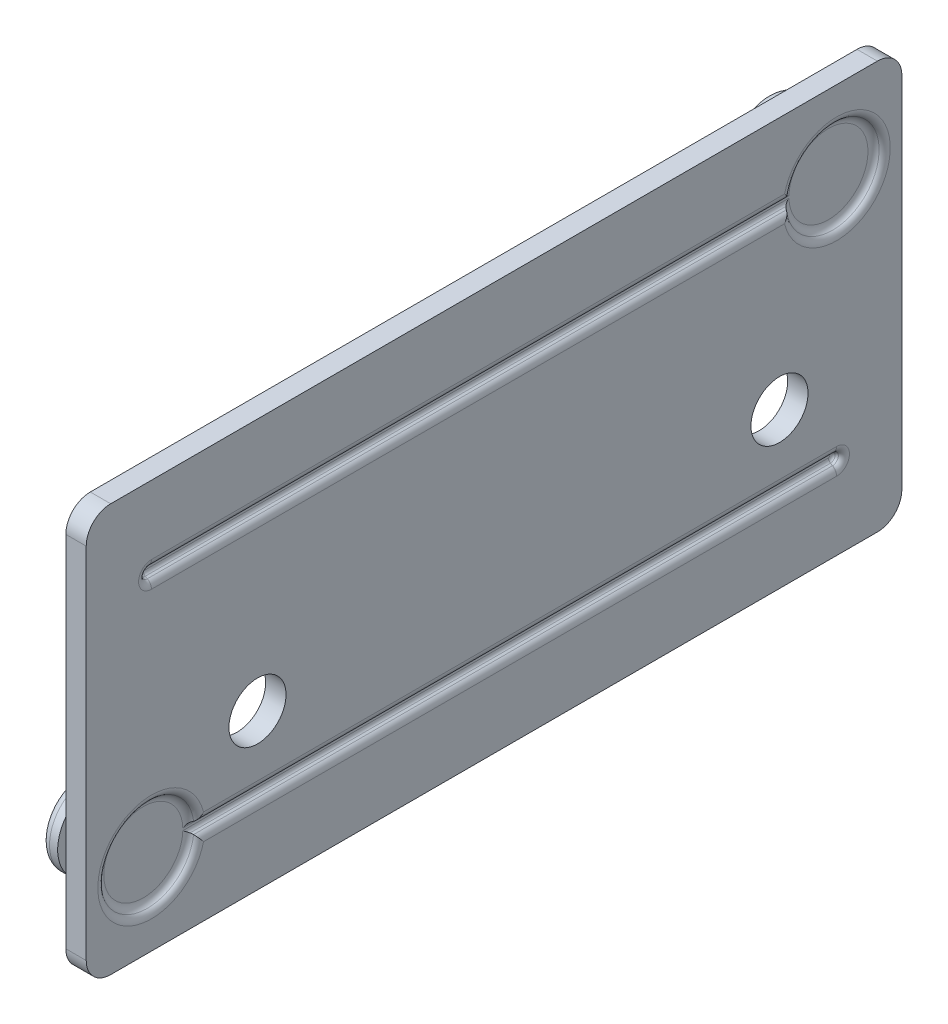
ISO-10303-21;
HEADER;
FILE_DESCRIPTION(('STEP AP214'),'2;1');
FILE_NAME('part.step','',(''),(''),'','','');
FILE_SCHEMA(('AUTOMOTIVE_DESIGN { 1 0 10303 214 1 1 1 1 }'));
ENDSEC;
DATA;
#1=APPLICATION_CONTEXT('core data for automotive mechanical design processes');
#2=APPLICATION_PROTOCOL_DEFINITION('international standard','automotive_design',2000,#1);
#3=PRODUCT_CONTEXT('',#1,'mechanical');
#4=PRODUCT('Part','Part','',(#3));
#5=PRODUCT_RELATED_PRODUCT_CATEGORY('part','',(#4));
#6=PRODUCT_DEFINITION_FORMATION('','',#4);
#7=PRODUCT_DEFINITION_CONTEXT('part definition',#1,'design');
#8=PRODUCT_DEFINITION('design','',#6,#7);
#9=PRODUCT_DEFINITION_SHAPE('','',#8);
#10=(LENGTH_UNIT() NAMED_UNIT(*) SI_UNIT(.MILLI.,.METRE.));
#11=(NAMED_UNIT(*) PLANE_ANGLE_UNIT() SI_UNIT($,.RADIAN.));
#12=(NAMED_UNIT(*) SI_UNIT($,.STERADIAN.) SOLID_ANGLE_UNIT());
#13=UNCERTAINTY_MEASURE_WITH_UNIT(LENGTH_MEASURE(1.E-05),#10,'distance_accuracy_value','');
#14=(GEOMETRIC_REPRESENTATION_CONTEXT(3) GLOBAL_UNCERTAINTY_ASSIGNED_CONTEXT((#13)) GLOBAL_UNIT_ASSIGNED_CONTEXT((#10,
#11,#12)) REPRESENTATION_CONTEXT('',''));
#15=CARTESIAN_POINT('',(0.,0.,0.));
#16=DIRECTION('',(0.,0.,1.));
#17=DIRECTION('',(1.,0.,0.));
#18=AXIS2_PLACEMENT_3D('',#15,#16,#17);
#19=CARTESIAN_POINT('',(0.,0.,0.));
#20=DIRECTION('',(0.999999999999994,0.,0.));
#21=DIRECTION('',(0.,0.,-1.));
#22=AXIS2_PLACEMENT_3D('',#19,#20,#21);
#23=PLANE('',#22);
#24=CARTESIAN_POINT('',(0.,19.0000000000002,14.9999999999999));
#25=DIRECTION('',(-0.999999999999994,0.,0.));
#26=DIRECTION('',(0.,0.,1.));
#27=AXIS2_PLACEMENT_3D('',#24,#25,#26);
#28=CIRCLE('',#27,3.49999999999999);
#29=CARTESIAN_POINT('',(0.,19.0000000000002,18.4999999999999));
#30=VERTEX_POINT('',#29);
#31=EDGE_CURVE('E877',#30,#30,#28,.T.);
#32=ORIENTED_EDGE('',*,*,#31,.F.);
#33=EDGE_LOOP('',(#32));
#34=FACE_BOUND('',#33,.T.);
#35=CARTESIAN_POINT('',(0.,40.0000000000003,8.00000000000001));
#36=DIRECTION('',(-0.999999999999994,0.,0.));
#37=DIRECTION('',(0.,0.,1.));
#38=AXIS2_PLACEMENT_3D('',#35,#36,#37);
#39=CIRCLE('',#38,7.);
#40=CARTESIAN_POINT('',(0.,42.0000000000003,14.7082039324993));
#41=VERTEX_POINT('',#40);
#42=CARTESIAN_POINT('',(0.,38.0000000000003,14.7082039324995));
#43=VERTEX_POINT('',#42);
#44=EDGE_CURVE('E309',#41,#43,#39,.T.);
#45=ORIENTED_EDGE('',*,*,#44,.F.);
#46=DIRECTION('',(0.,0.,-1.));
#47=VECTOR('',#46,1.);
#48=CARTESIAN_POINT('',(0.,42.0000000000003,14.7082039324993));
#49=LINE('',#48,#47);
#50=CARTESIAN_POINT('',(0.,42.0000000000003,92.0000000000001));
#51=VERTEX_POINT('',#50);
#52=EDGE_CURVE('E361',#51,#41,#49,.T.);
#53=ORIENTED_EDGE('',*,*,#52,.F.);
#54=CARTESIAN_POINT('',(0.,40.0000000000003,92.0000000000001));
#55=DIRECTION('',(-0.999999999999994,0.,0.));
#56=DIRECTION('',(0.,0.,-1.));
#57=AXIS2_PLACEMENT_3D('',#54,#55,#56);
#58=CIRCLE('',#57,2.);
#59=CARTESIAN_POINT('',(0.,38.0000000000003,92.0000000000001));
#60=VERTEX_POINT('',#59);
#61=EDGE_CURVE('E702',#60,#51,#58,.T.);
#62=ORIENTED_EDGE('',*,*,#61,.F.);
#63=DIRECTION('',(0.,0.,1.));
#64=VECTOR('',#63,1.);
#65=CARTESIAN_POINT('',(0.,38.0000000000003,14.7082039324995));
#66=LINE('',#65,#64);
#67=EDGE_CURVE('E705',#43,#60,#66,.T.);
#68=ORIENTED_EDGE('',*,*,#67,.F.);
#69=EDGE_LOOP('',(#45,#53,#62,#68));
#70=FACE_BOUND('',#69,.T.);
#71=DIRECTION('',(0.,0.,-1.));
#72=VECTOR('',#71,1.);
#73=CARTESIAN_POINT('',(0.,0.,0.));
#74=LINE('',#73,#72);
#75=CARTESIAN_POINT('',(0.,0.,97.));
#76=VERTEX_POINT('',#75);
#77=CARTESIAN_POINT('',(0.,0.,2.99999999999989));
#78=VERTEX_POINT('',#77);
#79=EDGE_CURVE('E684',#76,#78,#74,.T.);
#80=ORIENTED_EDGE('',*,*,#79,.F.);
#81=CARTESIAN_POINT('',(0.,3.0000000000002,97.));
#82=DIRECTION('',(0.999999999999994,0.,0.));
#83=DIRECTION('',(0.,0.,-1.));
#84=AXIS2_PLACEMENT_3D('',#81,#82,#83);
#85=CIRCLE('',#84,3.);
#86=CARTESIAN_POINT('',(0.,3.0000000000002,99.9999999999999));
#87=VERTEX_POINT('',#86);
#88=EDGE_CURVE('E914',#76,#87,#85,.F.);
#89=ORIENTED_EDGE('',*,*,#88,.T.);
#90=DIRECTION('',(0.,-1.00000000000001,0.));
#91=VECTOR('',#90,1.);
#92=CARTESIAN_POINT('',(0.,0.,99.9999999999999));
#93=LINE('',#92,#91);
#94=CARTESIAN_POINT('',(0.,47.0000000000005,99.9999999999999));
#95=VERTEX_POINT('',#94);
#96=EDGE_CURVE('E397',#95,#87,#93,.T.);
#97=ORIENTED_EDGE('',*,*,#96,.F.);
#98=CARTESIAN_POINT('',(0.,47.0000000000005,97.));
#99=DIRECTION('',(0.999999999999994,0.,0.));
#100=DIRECTION('',(0.,0.,-1.));
#101=AXIS2_PLACEMENT_3D('',#98,#99,#100);
#102=CIRCLE('',#101,3.);
#103=CARTESIAN_POINT('',(0.,50.0000000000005,97.));
#104=VERTEX_POINT('',#103);
#105=EDGE_CURVE('E404',#95,#104,#102,.F.);
#106=ORIENTED_EDGE('',*,*,#105,.T.);
#107=DIRECTION('',(0.,0.,1.));
#108=VECTOR('',#107,1.);
#109=CARTESIAN_POINT('',(0.,50.0000000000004,0.));
#110=LINE('',#109,#108);
#111=CARTESIAN_POINT('',(0.,50.0000000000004,3.00000000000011));
#112=VERTEX_POINT('',#111);
#113=EDGE_CURVE('E393',#112,#104,#110,.T.);
#114=ORIENTED_EDGE('',*,*,#113,.F.);
#115=CARTESIAN_POINT('',(0.,47.0000000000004,2.99999999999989));
#116=DIRECTION('',(0.999999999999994,0.,0.));
#117=DIRECTION('',(0.,0.,-1.));
#118=AXIS2_PLACEMENT_3D('',#115,#116,#117);
#119=CIRCLE('',#118,3.);
#120=CARTESIAN_POINT('',(0.,47.0000000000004,0.));
#121=VERTEX_POINT('',#120);
#122=EDGE_CURVE('E919',#112,#121,#119,.F.);
#123=ORIENTED_EDGE('',*,*,#122,.T.);
#124=DIRECTION('',(0.,1.00000000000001,0.));
#125=VECTOR('',#124,1.);
#126=CARTESIAN_POINT('',(0.,0.,0.));
#127=LINE('',#126,#125);
#128=CARTESIAN_POINT('',(0.,3.00000000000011,0.));
#129=VERTEX_POINT('',#128);
#130=EDGE_CURVE('E398',#129,#121,#127,.T.);
#131=ORIENTED_EDGE('',*,*,#130,.F.);
#132=CARTESIAN_POINT('',(0.,3.00000000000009,2.99999999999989));
#133=DIRECTION('',(0.999999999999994,0.,0.));
#134=DIRECTION('',(0.,0.,-1.));
#135=AXIS2_PLACEMENT_3D('',#132,#133,#134);
#136=CIRCLE('',#135,3.);
#137=EDGE_CURVE('E917',#129,#78,#136,.F.);
#138=ORIENTED_EDGE('',*,*,#137,.T.);
#139=EDGE_LOOP('',(#80,#89,#97,#106,#114,#123,#131,#138));
#140=FACE_BOUND('',#139,.T.);
#141=CARTESIAN_POINT('',(0.,10.0000000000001,91.9999999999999));
#142=DIRECTION('',(-0.999999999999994,0.,0.));
#143=DIRECTION('',(0.,0.,1.));
#144=AXIS2_PLACEMENT_3D('',#141,#142,#143);
#145=CIRCLE('',#144,7.);
#146=CARTESIAN_POINT('',(0.,8.0000000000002,85.2917960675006));
#147=VERTEX_POINT('',#146);
#148=CARTESIAN_POINT('',(0.,12.0000000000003,85.2917960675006));
#149=VERTEX_POINT('',#148);
#150=EDGE_CURVE('E275',#147,#149,#145,.T.);
#151=ORIENTED_EDGE('',*,*,#150,.F.);
#152=DIRECTION('',(0.,0.,1.));
#153=VECTOR('',#152,1.);
#154=CARTESIAN_POINT('',(0.,8.0000000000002,85.2917960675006));
#155=LINE('',#154,#153);
#156=CARTESIAN_POINT('',(0.,8.00000000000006,8.00000000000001));
#157=VERTEX_POINT('',#156);
#158=EDGE_CURVE('E283',#157,#147,#155,.T.);
#159=ORIENTED_EDGE('',*,*,#158,.F.);
#160=CARTESIAN_POINT('',(0.,10.0000000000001,8.00000000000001));
#161=DIRECTION('',(-0.999999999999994,0.,0.));
#162=DIRECTION('',(0.,0.,-1.));
#163=AXIS2_PLACEMENT_3D('',#160,#161,#162);
#164=CIRCLE('',#163,2.);
#165=CARTESIAN_POINT('',(0.,12.0000000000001,8.00000000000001));
#166=VERTEX_POINT('',#165);
#167=EDGE_CURVE('E297',#166,#157,#164,.T.);
#168=ORIENTED_EDGE('',*,*,#167,.F.);
#169=DIRECTION('',(0.,0.,-1.));
#170=VECTOR('',#169,1.);
#171=CARTESIAN_POINT('',(0.,12.0000000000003,85.2917960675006));
#172=LINE('',#171,#170);
#173=EDGE_CURVE('E292',#149,#166,#172,.T.);
#174=ORIENTED_EDGE('',*,*,#173,.F.);
#175=EDGE_LOOP('',(#151,#159,#168,#174));
#176=FACE_BOUND('',#175,.T.);
#177=CARTESIAN_POINT('',(0.,19.0000000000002,79.));
#178=DIRECTION('',(-0.999999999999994,0.,0.));
#179=DIRECTION('',(0.,0.,1.));
#180=AXIS2_PLACEMENT_3D('',#177,#178,#179);
#181=CIRCLE('',#180,3.49999999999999);
#182=CARTESIAN_POINT('',(0.,19.0000000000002,82.4999999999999));
#183=VERTEX_POINT('',#182);
#184=EDGE_CURVE('E883',#183,#183,#181,.T.);
#185=ORIENTED_EDGE('',*,*,#184,.F.);
#186=EDGE_LOOP('',(#185));
#187=FACE_BOUND('',#186,.T.);
#188=ADVANCED_FACE('F36',(#34,#70,#140,#176,#187),#23,.F.);
#189=CARTESIAN_POINT('',(-1.,40.0000000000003,8.00000000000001));
#190=DIRECTION('',(-0.999999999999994,0.,0.));
#191=DIRECTION('',(0.,0.,1.));
#192=AXIS2_PLACEMENT_3D('',#189,#190,#191);
#193=PLANE('',#192);
#194=CARTESIAN_POINT('',(-1.,40.0000000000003,92.0000000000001));
#195=DIRECTION('',(-0.999999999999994,0.,0.));
#196=DIRECTION('',(0.,0.,1.));
#197=AXIS2_PLACEMENT_3D('',#194,#195,#196);
#198=CIRCLE('',#197,0.556624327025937);
#199=CARTESIAN_POINT('',(-1.,39.4433756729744,92.0000000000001));
#200=VERTEX_POINT('',#199);
#201=CARTESIAN_POINT('',(-1.,40.5566243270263,92.0000000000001));
#202=VERTEX_POINT('',#201);
#203=EDGE_CURVE('E668',#200,#202,#198,.T.);
#204=ORIENTED_EDGE('',*,*,#203,.T.);
#205=DIRECTION('',(0.,0.,1.));
#206=VECTOR('',#205,1.);
#207=CARTESIAN_POINT('',(-1.,40.5566243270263,14.263106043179));
#208=LINE('',#207,#206);
#209=CARTESIAN_POINT('',(-1.,40.5566243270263,13.5286746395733));
#210=VERTEX_POINT('',#209);
#211=EDGE_CURVE('E665',#202,#210,#208,.F.);
#212=ORIENTED_EDGE('',*,*,#211,.T.);
#213=CARTESIAN_POINT('',(-1.,40.0000000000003,8.00000000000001));
#214=DIRECTION('',(-0.999999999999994,0.,0.));
#215=DIRECTION('',(0.,0.,1.));
#216=AXIS2_PLACEMENT_3D('',#213,#214,#215);
#217=CIRCLE('',#216,5.55662432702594);
#218=CARTESIAN_POINT('',(-1.,39.4433756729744,13.5286746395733));
#219=VERTEX_POINT('',#218);
#220=EDGE_CURVE('E672',#210,#219,#217,.T.);
#221=ORIENTED_EDGE('',*,*,#220,.T.);
#222=DIRECTION('',(0.,0.,-1.));
#223=VECTOR('',#222,1.);
#224=CARTESIAN_POINT('',(-1.,39.4433756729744,92.0000000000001));
#225=LINE('',#224,#223);
#226=EDGE_CURVE('E670',#219,#200,#225,.F.);
#227=ORIENTED_EDGE('',*,*,#226,.T.);
#228=EDGE_LOOP('',(#204,#212,#221,#227));
#229=FACE_BOUND('',#228,.T.);
#230=CARTESIAN_POINT('',(-1.,40.0000000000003,8.00000000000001));
#231=DIRECTION('',(-0.999999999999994,0.,0.));
#232=DIRECTION('',(0.,0.,1.));
#233=AXIS2_PLACEMENT_3D('',#230,#231,#232);
#234=CIRCLE('',#233,2.5);
#235=CARTESIAN_POINT('',(-1.,40.0000000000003,5.50000000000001));
#236=VERTEX_POINT('',#235);
#237=EDGE_CURVE('E865',#236,#236,#234,.T.);
#238=ORIENTED_EDGE('',*,*,#237,.F.);
#239=EDGE_LOOP('',(#238));
#240=FACE_BOUND('',#239,.T.);
#241=ADVANCED_FACE('F331',(#229,#240),#193,.T.);
#242=CARTESIAN_POINT('',(-1.,10.0000000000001,91.9999999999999));
#243=DIRECTION('',(-0.999999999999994,0.,0.));
#244=DIRECTION('',(0.,0.,1.));
#245=AXIS2_PLACEMENT_3D('',#242,#243,#244);
#246=PLANE('',#245);
#247=CARTESIAN_POINT('',(-1.,10.0000000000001,8.00000000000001));
#248=DIRECTION('',(-0.999999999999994,0.,0.));
#249=DIRECTION('',(0.,0.,1.));
#250=AXIS2_PLACEMENT_3D('',#247,#248,#249);
#251=CIRCLE('',#250,0.556624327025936);
#252=CARTESIAN_POINT('',(-1.,10.556624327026,8.00000000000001));
#253=VERTEX_POINT('',#252);
#254=CARTESIAN_POINT('',(-1.,9.44337567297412,8.00000000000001));
#255=VERTEX_POINT('',#254);
#256=EDGE_CURVE('E650',#253,#255,#251,.T.);
#257=ORIENTED_EDGE('',*,*,#256,.T.);
#258=DIRECTION('',(0.,0.,-1.));
#259=VECTOR('',#258,1.);
#260=CARTESIAN_POINT('',(-1.,9.44337567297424,85.736893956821));
#261=LINE('',#260,#259);
#262=CARTESIAN_POINT('',(-1.,9.44337567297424,86.4713253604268));
#263=VERTEX_POINT('',#262);
#264=EDGE_CURVE('E647',#255,#263,#261,.F.);
#265=ORIENTED_EDGE('',*,*,#264,.T.);
#266=CARTESIAN_POINT('',(-1.,10.0000000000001,91.9999999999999));
#267=DIRECTION('',(-0.999999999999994,0.,0.));
#268=DIRECTION('',(0.,0.,1.));
#269=AXIS2_PLACEMENT_3D('',#266,#267,#268);
#270=CIRCLE('',#269,5.55662432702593);
#271=CARTESIAN_POINT('',(-1.,10.5566243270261,86.4713253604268));
#272=VERTEX_POINT('',#271);
#273=EDGE_CURVE('E654',#263,#272,#270,.T.);
#274=ORIENTED_EDGE('',*,*,#273,.T.);
#275=DIRECTION('',(0.,0.,1.));
#276=VECTOR('',#275,1.);
#277=CARTESIAN_POINT('',(-1.,10.556624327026,8.00000000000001));
#278=LINE('',#277,#276);
#279=EDGE_CURVE('E652',#272,#253,#278,.F.);
#280=ORIENTED_EDGE('',*,*,#279,.T.);
#281=EDGE_LOOP('',(#257,#265,#274,#280));
#282=FACE_BOUND('',#281,.T.);
#283=CARTESIAN_POINT('',(-1.,10.0000000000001,91.9999999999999));
#284=DIRECTION('',(-0.999999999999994,0.,0.));
#285=DIRECTION('',(0.,0.,1.));
#286=AXIS2_PLACEMENT_3D('',#283,#284,#285);
#287=CIRCLE('',#286,2.50000000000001);
#288=CARTESIAN_POINT('',(-1.,10.0000000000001,89.4999999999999));
#289=VERTEX_POINT('',#288);
#290=EDGE_CURVE('E859',#289,#289,#287,.T.);
#291=ORIENTED_EDGE('',*,*,#290,.F.);
#292=EDGE_LOOP('',(#291));
#293=FACE_BOUND('',#292,.T.);
#294=ADVANCED_FACE('F334',(#282,#293),#246,.T.);
#295=CARTESIAN_POINT('',(2.49999999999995,0.,0.));
#296=DIRECTION('',(0.,0.,1.));
#297=DIRECTION('',(0.999999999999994,0.,0.));
#298=AXIS2_PLACEMENT_3D('',#295,#296,#297);
#299=PLANE('',#298);
#300=DIRECTION('',(0.,1.00000000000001,0.));
#301=VECTOR('',#300,1.);
#302=CARTESIAN_POINT('',(2.49999999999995,0.,0.));
#303=LINE('',#302,#301);
#304=CARTESIAN_POINT('',(2.49999999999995,3.00000000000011,0.));
#305=VERTEX_POINT('',#304);
#306=CARTESIAN_POINT('',(2.49999999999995,47.0000000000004,0.));
#307=VERTEX_POINT('',#306);
#308=EDGE_CURVE('E682',#305,#307,#303,.T.);
#309=ORIENTED_EDGE('',*,*,#308,.F.);
#310=DIRECTION('',(-0.999999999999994,0.,0.));
#311=VECTOR('',#310,1.);
#312=CARTESIAN_POINT('',(2.49999999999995,3.00000000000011,0.));
#313=LINE('',#312,#311);
#314=EDGE_CURVE('E409',#305,#129,#313,.T.);
#315=ORIENTED_EDGE('',*,*,#314,.T.);
#316=ORIENTED_EDGE('',*,*,#130,.T.);
#317=DIRECTION('',(-0.999999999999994,0.,0.));
#318=VECTOR('',#317,1.);
#319=CARTESIAN_POINT('',(2.49999999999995,47.0000000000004,0.));
#320=LINE('',#319,#318);
#321=EDGE_CURVE('E407',#121,#307,#320,.F.);
#322=ORIENTED_EDGE('',*,*,#321,.T.);
#323=EDGE_LOOP('',(#309,#315,#316,#322));
#324=FACE_BOUND('',#323,.T.);
#325=ADVANCED_FACE('F38',(#324),#299,.F.);
#326=CARTESIAN_POINT('',(2.49999999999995,50.0000000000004,0.));
#327=DIRECTION('',(0.,-1.00000000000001,0.));
#328=DIRECTION('',(0.,0.,-1.));
#329=AXIS2_PLACEMENT_3D('',#326,#327,#328);
#330=PLANE('',#329);
#331=ORIENTED_EDGE('',*,*,#113,.T.);
#332=DIRECTION('',(-0.999999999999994,0.,0.));
#333=VECTOR('',#332,1.);
#334=CARTESIAN_POINT('',(2.49999999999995,50.0000000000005,97.));
#335=LINE('',#334,#333);
#336=CARTESIAN_POINT('',(2.49999999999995,50.0000000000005,97.));
#337=VERTEX_POINT('',#336);
#338=EDGE_CURVE('E51',#104,#337,#335,.F.);
#339=ORIENTED_EDGE('',*,*,#338,.T.);
#340=DIRECTION('',(0.,0.,1.));
#341=VECTOR('',#340,1.);
#342=CARTESIAN_POINT('',(2.49999999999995,50.0000000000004,0.));
#343=LINE('',#342,#341);
#344=CARTESIAN_POINT('',(2.49999999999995,50.0000000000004,3.00000000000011));
#345=VERTEX_POINT('',#344);
#346=EDGE_CURVE('E680',#345,#337,#343,.T.);
#347=ORIENTED_EDGE('',*,*,#346,.F.);
#348=DIRECTION('',(-0.999999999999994,0.,0.));
#349=VECTOR('',#348,1.);
#350=CARTESIAN_POINT('',(2.49999999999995,50.0000000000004,3.00000000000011));
#351=LINE('',#350,#349);
#352=EDGE_CURVE('E395',#345,#112,#351,.T.);
#353=ORIENTED_EDGE('',*,*,#352,.T.);
#354=EDGE_LOOP('',(#331,#339,#347,#353));
#355=FACE_BOUND('',#354,.T.);
#356=ADVANCED_FACE('F384',(#355),#330,.F.);
#357=CARTESIAN_POINT('',(2.49999999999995,0.,99.9999999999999));
#358=DIRECTION('',(0.,0.,-1.));
#359=DIRECTION('',(-0.999999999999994,0.,0.));
#360=AXIS2_PLACEMENT_3D('',#357,#358,#359);
#361=PLANE('',#360);
#362=ORIENTED_EDGE('',*,*,#96,.T.);
#363=DIRECTION('',(-0.999999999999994,0.,0.));
#364=VECTOR('',#363,1.);
#365=CARTESIAN_POINT('',(2.49999999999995,3.0000000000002,99.9999999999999));
#366=LINE('',#365,#364);
#367=CARTESIAN_POINT('',(2.49999999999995,3.0000000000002,99.9999999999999));
#368=VERTEX_POINT('',#367);
#369=EDGE_CURVE('E903',#87,#368,#366,.F.);
#370=ORIENTED_EDGE('',*,*,#369,.T.);
#371=DIRECTION('',(0.,-1.00000000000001,0.));
#372=VECTOR('',#371,1.);
#373=CARTESIAN_POINT('',(2.49999999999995,0.,99.9999999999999));
#374=LINE('',#373,#372);
#375=CARTESIAN_POINT('',(2.49999999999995,47.0000000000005,99.9999999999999));
#376=VERTEX_POINT('',#375);
#377=EDGE_CURVE('E677',#376,#368,#374,.T.);
#378=ORIENTED_EDGE('',*,*,#377,.F.);
#379=DIRECTION('',(-0.999999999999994,0.,0.));
#380=VECTOR('',#379,1.);
#381=CARTESIAN_POINT('',(2.49999999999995,47.0000000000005,99.9999999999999));
#382=LINE('',#381,#380);
#383=EDGE_CURVE('E912',#376,#95,#382,.T.);
#384=ORIENTED_EDGE('',*,*,#383,.T.);
#385=EDGE_LOOP('',(#362,#370,#378,#384));
#386=FACE_BOUND('',#385,.T.);
#387=ADVANCED_FACE('F381',(#386),#361,.F.);
#388=CARTESIAN_POINT('',(2.49999999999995,0.,0.));
#389=DIRECTION('',(0.,1.00000000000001,0.));
#390=DIRECTION('',(0.,0.,1.));
#391=AXIS2_PLACEMENT_3D('',#388,#389,#390);
#392=PLANE('',#391);
#393=DIRECTION('',(0.,0.,-1.));
#394=VECTOR('',#393,1.);
#395=CARTESIAN_POINT('',(2.49999999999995,0.,0.));
#396=LINE('',#395,#394);
#397=CARTESIAN_POINT('',(2.49999999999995,1.11022302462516E-13,97.));
#398=VERTEX_POINT('',#397);
#399=CARTESIAN_POINT('',(2.49999999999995,0.,2.99999999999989));
#400=VERTEX_POINT('',#399);
#401=EDGE_CURVE('E674',#398,#400,#396,.T.);
#402=ORIENTED_EDGE('',*,*,#401,.F.);
#403=DIRECTION('',(-0.999999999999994,0.,0.));
#404=VECTOR('',#403,1.);
#405=CARTESIAN_POINT('',(2.49999999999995,1.11022302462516E-13,97.));
#406=LINE('',#405,#404);
#407=EDGE_CURVE('E905',#398,#76,#406,.T.);
#408=ORIENTED_EDGE('',*,*,#407,.T.);
#409=ORIENTED_EDGE('',*,*,#79,.T.);
#410=DIRECTION('',(-0.999999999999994,0.,0.));
#411=VECTOR('',#410,1.);
#412=CARTESIAN_POINT('',(2.49999999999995,0.,2.99999999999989));
#413=LINE('',#412,#411);
#414=EDGE_CURVE('E922',#78,#400,#413,.F.);
#415=ORIENTED_EDGE('',*,*,#414,.T.);
#416=EDGE_LOOP('',(#402,#408,#409,#415));
#417=FACE_BOUND('',#416,.T.);
#418=ADVANCED_FACE('F377',(#417),#392,.F.);
#419=CARTESIAN_POINT('',(2.49999999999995,0.,0.));
#420=DIRECTION('',(0.999999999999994,0.,0.));
#421=DIRECTION('',(0.,0.,-1.));
#422=AXIS2_PLACEMENT_3D('',#419,#420,#421);
#423=PLANE('',#422);
#424=CARTESIAN_POINT('',(2.49999999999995,19.0000000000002,79.));
#425=DIRECTION('',(0.999999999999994,0.,0.));
#426=DIRECTION('',(0.,0.,-1.));
#427=AXIS2_PLACEMENT_3D('',#424,#425,#426);
#428=CIRCLE('',#427,3.49999999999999);
#429=CARTESIAN_POINT('',(2.49999999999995,19.0000000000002,82.4999999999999));
#430=VERTEX_POINT('',#429);
#431=EDGE_CURVE('E880',#430,#430,#428,.T.);
#432=ORIENTED_EDGE('',*,*,#431,.F.);
#433=EDGE_LOOP('',(#432));
#434=FACE_BOUND('',#433,.T.);
#435=CARTESIAN_POINT('',(2.49999999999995,19.0000000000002,14.9999999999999));
#436=DIRECTION('',(0.999999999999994,0.,0.));
#437=DIRECTION('',(0.,0.,-1.));
#438=AXIS2_PLACEMENT_3D('',#435,#436,#437);
#439=CIRCLE('',#438,3.49999999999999);
#440=CARTESIAN_POINT('',(2.49999999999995,19.0000000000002,18.4999999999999));
#441=VERTEX_POINT('',#440);
#442=EDGE_CURVE('E874',#441,#441,#439,.T.);
#443=ORIENTED_EDGE('',*,*,#442,.F.);
#444=EDGE_LOOP('',(#443));
#445=FACE_BOUND('',#444,.T.);
#446=CARTESIAN_POINT('',(2.49999999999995,10.0000000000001,91.9999999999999));
#447=DIRECTION('',(0.999999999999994,0.,0.));
#448=DIRECTION('',(0.,0.,-1.));
#449=AXIS2_PLACEMENT_3D('',#446,#447,#448);
#450=CIRCLE('',#449,6.57735026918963);
#451=CARTESIAN_POINT('',(2.49999999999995,8.42264973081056,85.6145867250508));
#452=VERTEX_POINT('',#451);
#453=CARTESIAN_POINT('',(2.49999999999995,11.5773502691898,85.6145867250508));
#454=VERTEX_POINT('',#453);
#455=EDGE_CURVE('E624',#452,#454,#450,.F.);
#456=ORIENTED_EDGE('',*,*,#455,.T.);
#457=DIRECTION('',(0.,0.,1.));
#458=VECTOR('',#457,1.);
#459=CARTESIAN_POINT('',(2.49999999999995,11.5773502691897,8.00000000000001));
#460=LINE('',#459,#458);
#461=CARTESIAN_POINT('',(2.49999999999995,11.5773502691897,8.00000000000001));
#462=VERTEX_POINT('',#461);
#463=EDGE_CURVE('E619',#454,#462,#460,.F.);
#464=ORIENTED_EDGE('',*,*,#463,.T.);
#465=CARTESIAN_POINT('',(2.49999999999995,10.0000000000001,8.00000000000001));
#466=DIRECTION('',(0.999999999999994,0.,0.));
#467=DIRECTION('',(0.,0.,-1.));
#468=AXIS2_PLACEMENT_3D('',#465,#466,#467);
#469=CIRCLE('',#468,1.57735026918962);
#470=CARTESIAN_POINT('',(2.49999999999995,8.42264973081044,8.00000000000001));
#471=VERTEX_POINT('',#470);
#472=EDGE_CURVE('E622',#462,#471,#469,.F.);
#473=ORIENTED_EDGE('',*,*,#472,.T.);
#474=DIRECTION('',(0.,0.,-1.));
#475=VECTOR('',#474,1.);
#476=CARTESIAN_POINT('',(2.49999999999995,8.42264973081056,86.0839202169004));
#477=LINE('',#476,#475);
#478=EDGE_CURVE('E626',#471,#452,#477,.F.);
#479=ORIENTED_EDGE('',*,*,#478,.T.);
#480=EDGE_LOOP('',(#456,#464,#473,#479));
#481=FACE_BOUND('',#480,.T.);
#482=CARTESIAN_POINT('',(2.49999999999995,40.0000000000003,92.0000000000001));
#483=DIRECTION('',(0.999999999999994,0.,0.));
#484=DIRECTION('',(0.,0.,-1.));
#485=AXIS2_PLACEMENT_3D('',#482,#483,#484);
#486=CIRCLE('',#485,1.57735026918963);
#487=CARTESIAN_POINT('',(2.49999999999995,38.4226497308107,92.0000000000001));
#488=VERTEX_POINT('',#487);
#489=CARTESIAN_POINT('',(2.49999999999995,41.57735026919,92.0000000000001));
#490=VERTEX_POINT('',#489);
#491=EDGE_CURVE('E631',#488,#490,#486,.F.);
#492=ORIENTED_EDGE('',*,*,#491,.T.);
#493=DIRECTION('',(0.,0.,1.));
#494=VECTOR('',#493,1.);
#495=CARTESIAN_POINT('',(2.49999999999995,41.5773502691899,13.9160797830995));
#496=LINE('',#495,#494);
#497=CARTESIAN_POINT('',(2.49999999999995,41.5773502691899,14.385413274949));
#498=VERTEX_POINT('',#497);
#499=EDGE_CURVE('E628',#490,#498,#496,.F.);
#500=ORIENTED_EDGE('',*,*,#499,.T.);
#501=CARTESIAN_POINT('',(2.49999999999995,40.0000000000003,8.00000000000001));
#502=DIRECTION('',(0.999999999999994,0.,0.));
#503=DIRECTION('',(0.,0.,-1.));
#504=AXIS2_PLACEMENT_3D('',#501,#502,#503);
#505=CIRCLE('',#504,6.57735026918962);
#506=CARTESIAN_POINT('',(2.49999999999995,38.4226497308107,14.3854132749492));
#507=VERTEX_POINT('',#506);
#508=EDGE_CURVE('E633',#498,#507,#505,.F.);
#509=ORIENTED_EDGE('',*,*,#508,.T.);
#510=DIRECTION('',(0.,0.,-1.));
#511=VECTOR('',#510,1.);
#512=CARTESIAN_POINT('',(2.49999999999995,38.4226497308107,92.0000000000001));
#513=LINE('',#512,#511);
#514=EDGE_CURVE('E635',#507,#488,#513,.F.);
#515=ORIENTED_EDGE('',*,*,#514,.T.);
#516=EDGE_LOOP('',(#492,#500,#509,#515));
#517=FACE_BOUND('',#516,.T.);
#518=ORIENTED_EDGE('',*,*,#377,.T.);
#519=CARTESIAN_POINT('',(2.49999999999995,3.0000000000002,97.));
#520=DIRECTION('',(0.999999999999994,0.,0.));
#521=DIRECTION('',(0.,0.,-1.));
#522=AXIS2_PLACEMENT_3D('',#519,#520,#521);
#523=CIRCLE('',#522,3.);
#524=EDGE_CURVE('E411',#368,#398,#523,.T.);
#525=ORIENTED_EDGE('',*,*,#524,.T.);
#526=ORIENTED_EDGE('',*,*,#401,.T.);
#527=CARTESIAN_POINT('',(2.49999999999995,3.00000000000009,2.99999999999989));
#528=DIRECTION('',(0.999999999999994,0.,0.));
#529=DIRECTION('',(0.,0.,-1.));
#530=AXIS2_PLACEMENT_3D('',#527,#528,#529);
#531=CIRCLE('',#530,3.);
#532=EDGE_CURVE('E906',#400,#305,#531,.T.);
#533=ORIENTED_EDGE('',*,*,#532,.T.);
#534=ORIENTED_EDGE('',*,*,#308,.T.);
#535=CARTESIAN_POINT('',(2.49999999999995,47.0000000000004,2.99999999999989));
#536=DIRECTION('',(0.999999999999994,0.,0.));
#537=DIRECTION('',(0.,0.,-1.));
#538=AXIS2_PLACEMENT_3D('',#535,#536,#537);
#539=CIRCLE('',#538,3.);
#540=EDGE_CURVE('E58',#307,#345,#539,.T.);
#541=ORIENTED_EDGE('',*,*,#540,.T.);
#542=ORIENTED_EDGE('',*,*,#346,.T.);
#543=CARTESIAN_POINT('',(2.49999999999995,47.0000000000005,97.));
#544=DIRECTION('',(0.999999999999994,0.,0.));
#545=DIRECTION('',(0.,0.,-1.));
#546=AXIS2_PLACEMENT_3D('',#543,#544,#545);
#547=CIRCLE('',#546,3.);
#548=EDGE_CURVE('E406',#337,#376,#547,.T.);
#549=ORIENTED_EDGE('',*,*,#548,.T.);
#550=EDGE_LOOP('',(#518,#525,#526,#533,#534,#541,#542,#549));
#551=FACE_BOUND('',#550,.T.);
#552=ADVANCED_FACE('F341',(#434,#445,#481,#517,#551),#423,.T.);
#553=CARTESIAN_POINT('',(0.,40.0000000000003,8.00000000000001));
#554=DIRECTION('',(0.999999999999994,0.,0.));
#555=DIRECTION('',(0.,0.,1.));
#556=AXIS2_PLACEMENT_3D('',#553,#554,#555);
#557=CONICAL_SURFACE('',#556,7.,0.5235987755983);
#558=CARTESIAN_POINT('',(-1.,38.5773502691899,14.263106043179));
#559=CARTESIAN_POINT('',(-0.9170502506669,38.5294592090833,14.3013383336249));
#560=CARTESIAN_POINT('',(-0.833996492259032,38.4815080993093,14.3392692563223));
#561=CARTESIAN_POINT('',(-0.667695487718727,38.3854941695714,14.4145519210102));
#562=CARTESIAN_POINT('',(-0.584448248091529,38.3374313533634,14.4519036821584));
#563=CARTESIAN_POINT('',(-0.417769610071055,38.2411993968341,14.5260539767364));
#564=CARTESIAN_POINT('',(-0.334338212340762,38.1930302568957,14.5628525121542));
#565=CARTESIAN_POINT('',(-0.167298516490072,38.0965898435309,14.6359200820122));
#566=CARTESIAN_POINT('',(-0.0836902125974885,38.048318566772,14.6721890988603));
#567=CARTESIAN_POINT('',(0.,38.0000000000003,14.7082039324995));
#568=B_SPLINE_CURVE_WITH_KNOTS('',3,(#558,#559,#560,#561,#562,#563,#564,#565,#566,#567),
.UNSPECIFIED.,.F.,.F.,(4,2,2,2,4),(0.,0.309391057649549,0.618771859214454,0.928151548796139,
1.23754149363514),.UNSPECIFIED.);
#569=CARTESIAN_POINT('',(-0.249999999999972,38.1443375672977,14.5997442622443));
#570=VERTEX_POINT('',#569);
#571=EDGE_CURVE('E347',#570,#43,#568,.T.);
#572=ORIENTED_EDGE('',*,*,#571,.F.);
#573=CARTESIAN_POINT('',(-0.249999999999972,40.0000000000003,8.00000000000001));
#574=DIRECTION('',(0.999999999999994,0.,0.));
#575=DIRECTION('',(0.,0.,-1.));
#576=AXIS2_PLACEMENT_3D('',#573,#574,#575);
#577=CIRCLE('',#576,6.85566243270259);
#578=CARTESIAN_POINT('',(-0.249999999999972,41.8556624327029,14.5997442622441));
#579=VERTEX_POINT('',#578);
#580=EDGE_CURVE('E656',#570,#579,#577,.T.);
#581=ORIENTED_EDGE('',*,*,#580,.T.);
#582=CARTESIAN_POINT('',(-1.,41.4226497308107,14.263106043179));
#583=CARTESIAN_POINT('',(-0.917050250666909,41.4705407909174,14.3013383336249));
#584=CARTESIAN_POINT('',(-0.833996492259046,41.5184919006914,14.3392692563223));
#585=CARTESIAN_POINT('',(-0.667695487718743,41.6145058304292,14.4145519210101));
#586=CARTESIAN_POINT('',(-0.584448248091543,41.6625686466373,14.4519036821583));
#587=CARTESIAN_POINT('',(-0.417769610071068,41.7588006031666,14.5260539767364));
#588=CARTESIAN_POINT('',(-0.334338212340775,41.806969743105,14.5628525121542));
#589=CARTESIAN_POINT('',(-0.167298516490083,41.9034101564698,14.6359200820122));
#590=CARTESIAN_POINT('',(-0.0836902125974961,41.9516814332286,14.6721890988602));
#591=CARTESIAN_POINT('',(0.,42.0000000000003,14.7082039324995));
#592=B_SPLINE_CURVE_WITH_KNOTS('',3,(#582,#583,#584,#585,#586,#587,#588,#589,#590,#591),
.UNSPECIFIED.,.F.,.F.,(4,2,2,2,4),(0.,0.309391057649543,0.618771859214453,0.928151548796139,
1.23754149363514),.UNSPECIFIED.);
#593=EDGE_CURVE('E354',#579,#41,#592,.T.);
#594=ORIENTED_EDGE('',*,*,#593,.T.);
#595=ORIENTED_EDGE('',*,*,#44,.T.);
#596=EDGE_LOOP('',(#572,#581,#594,#595));
#597=FACE_BOUND('',#596,.T.);
#598=ADVANCED_FACE('F336',(#597),#557,.T.);
#599=CARTESIAN_POINT('',(0.,38.0000000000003,14.7082039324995));
#600=DIRECTION('',(-0.499999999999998,-0.866025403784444,0.));
#601=DIRECTION('',(0.866025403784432,-0.500000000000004,0.));
#602=AXIS2_PLACEMENT_3D('',#599,#600,#601);
#603=PLANE('',#602);
#604=DIRECTION('',(0.866025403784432,-0.500000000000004,0.));
#605=VECTOR('',#604,1.);
#606=CARTESIAN_POINT('',(0.,38.0000000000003,92.0000000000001));
#607=LINE('',#606,#605);
#608=CARTESIAN_POINT('',(-0.249999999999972,38.1443375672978,92.0000000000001));
#609=VERTEX_POINT('',#608);
#610=EDGE_CURVE('E690',#609,#60,#607,.T.);
#611=ORIENTED_EDGE('',*,*,#610,.F.);
#612=DIRECTION('',(0.,0.,1.));
#613=VECTOR('',#612,1.);
#614=CARTESIAN_POINT('',(-0.249999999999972,38.1443375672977,14.263106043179));
#615=LINE('',#614,#613);
#616=EDGE_CURVE('E658',#609,#570,#615,.F.);
#617=ORIENTED_EDGE('',*,*,#616,.T.);
#618=ORIENTED_EDGE('',*,*,#571,.T.);
#619=ORIENTED_EDGE('',*,*,#67,.T.);
#620=EDGE_LOOP('',(#611,#617,#618,#619));
#621=FACE_BOUND('',#620,.T.);
#622=ADVANCED_FACE('F340',(#621),#603,.T.);
#623=CARTESIAN_POINT('',(0.,40.0000000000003,92.0000000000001));
#624=DIRECTION('',(0.999999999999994,0.,0.));
#625=DIRECTION('',(0.,0.,-1.));
#626=AXIS2_PLACEMENT_3D('',#623,#624,#625);
#627=CONICAL_SURFACE('',#626,2.,0.5235987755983);
#628=DIRECTION('',(0.866025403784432,0.500000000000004,0.));
#629=VECTOR('',#628,1.);
#630=CARTESIAN_POINT('',(0.,42.0000000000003,92.0000000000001));
#631=LINE('',#630,#629);
#632=CARTESIAN_POINT('',(-0.249999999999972,41.855662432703,92.0000000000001));
#633=VERTEX_POINT('',#632);
#634=EDGE_CURVE('E360',#633,#51,#631,.T.);
#635=ORIENTED_EDGE('',*,*,#634,.F.);
#636=CARTESIAN_POINT('',(-0.249999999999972,40.0000000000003,92.0000000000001));
#637=DIRECTION('',(0.999999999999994,0.,0.));
#638=DIRECTION('',(0.,0.,-1.));
#639=AXIS2_PLACEMENT_3D('',#636,#637,#638);
#640=CIRCLE('',#639,1.85566243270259);
#641=EDGE_CURVE('E660',#633,#609,#640,.T.);
#642=ORIENTED_EDGE('',*,*,#641,.T.);
#643=ORIENTED_EDGE('',*,*,#610,.T.);
#644=ORIENTED_EDGE('',*,*,#61,.T.);
#645=EDGE_LOOP('',(#635,#642,#643,#644));
#646=FACE_BOUND('',#645,.T.);
#647=ADVANCED_FACE('F367',(#646),#627,.T.);
#648=CARTESIAN_POINT('',(0.,42.0000000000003,14.7082039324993));
#649=DIRECTION('',(-0.499999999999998,0.866025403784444,0.));
#650=DIRECTION('',(-0.866025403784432,-0.500000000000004,0.));
#651=AXIS2_PLACEMENT_3D('',#648,#649,#650);
#652=PLANE('',#651);
#653=ORIENTED_EDGE('',*,*,#593,.F.);
#654=DIRECTION('',(0.,0.,-1.));
#655=VECTOR('',#654,1.);
#656=CARTESIAN_POINT('',(-0.249999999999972,41.855662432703,92.0000000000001));
#657=LINE('',#656,#655);
#658=EDGE_CURVE('E662',#579,#633,#657,.F.);
#659=ORIENTED_EDGE('',*,*,#658,.T.);
#660=ORIENTED_EDGE('',*,*,#634,.T.);
#661=ORIENTED_EDGE('',*,*,#52,.T.);
#662=EDGE_LOOP('',(#653,#659,#660,#661));
#663=FACE_BOUND('',#662,.T.);
#664=ADVANCED_FACE('F363',(#663),#652,.T.);
#665=CARTESIAN_POINT('',(0.,10.0000000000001,91.9999999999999));
#666=DIRECTION('',(0.999999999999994,0.,0.));
#667=DIRECTION('',(0.,0.,1.));
#668=AXIS2_PLACEMENT_3D('',#665,#666,#667);
#669=CONICAL_SURFACE('',#668,7.,0.5235987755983);
#670=CARTESIAN_POINT('',(-1.,11.4226497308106,85.736893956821));
#671=CARTESIAN_POINT('',(-0.917050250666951,11.4705407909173,85.6986616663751));
#672=CARTESIAN_POINT('',(-0.833996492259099,11.5184919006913,85.6607307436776));
#673=CARTESIAN_POINT('',(-0.667695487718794,11.6145058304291,85.5854480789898));
#674=CARTESIAN_POINT('',(-0.584448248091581,11.6625686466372,85.5480963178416));
#675=CARTESIAN_POINT('',(-0.417769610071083,11.7588006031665,85.4739460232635));
#676=CARTESIAN_POINT('',(-0.33433821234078,11.8069697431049,85.4371474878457));
#677=CARTESIAN_POINT('',(-0.167298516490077,11.9034101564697,85.3640799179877));
#678=CARTESIAN_POINT('',(-0.0836902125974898,11.9516814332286,85.3278109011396));
#679=CARTESIAN_POINT('',(0.,12.0000000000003,85.2917960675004));
#680=B_SPLINE_CURVE_WITH_KNOTS('',3,(#670,#671,#672,#673,#674,#675,#676,#677,#678,#679),
.UNSPECIFIED.,.F.,.F.,(4,2,2,2,4),(0.,0.309391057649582,0.618771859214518,0.928151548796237,
1.23754149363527),.UNSPECIFIED.);
#681=CARTESIAN_POINT('',(-0.249999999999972,11.8556624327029,85.4002557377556));
#682=VERTEX_POINT('',#681);
#683=EDGE_CURVE('E302',#682,#149,#680,.T.);
#684=ORIENTED_EDGE('',*,*,#683,.F.);
#685=CARTESIAN_POINT('',(-0.249999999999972,10.0000000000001,91.9999999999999));
#686=DIRECTION('',(0.999999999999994,0.,0.));
#687=DIRECTION('',(0.,0.,-1.));
#688=AXIS2_PLACEMENT_3D('',#685,#686,#687);
#689=CIRCLE('',#688,6.85566243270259);
#690=CARTESIAN_POINT('',(-0.249999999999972,8.1443375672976,85.4002557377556));
#691=VERTEX_POINT('',#690);
#692=EDGE_CURVE('E277',#682,#691,#689,.T.);
#693=ORIENTED_EDGE('',*,*,#692,.T.);
#694=CARTESIAN_POINT('',(-1.,8.57735026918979,85.736893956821));
#695=CARTESIAN_POINT('',(-0.917050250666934,8.52945920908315,85.698661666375));
#696=CARTESIAN_POINT('',(-0.833996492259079,8.48150809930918,85.6607307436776));
#697=CARTESIAN_POINT('',(-0.667695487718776,8.38549416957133,85.5854480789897));
#698=CARTESIAN_POINT('',(-0.584448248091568,8.33743135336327,85.5480963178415));
#699=CARTESIAN_POINT('',(-0.417769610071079,8.24119939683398,85.4739460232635));
#700=CARTESIAN_POINT('',(-0.33433821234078,8.19303025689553,85.4371474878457));
#701=CARTESIAN_POINT('',(-0.167298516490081,8.09658984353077,85.3640799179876));
#702=CARTESIAN_POINT('',(-0.0836902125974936,8.0483185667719,85.3278109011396));
#703=CARTESIAN_POINT('',(0.,8.0000000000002,85.2917960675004));
#704=B_SPLINE_CURVE_WITH_KNOTS('',3,(#694,#695,#696,#697,#698,#699,#700,#701,#702,#703),
.UNSPECIFIED.,.F.,.F.,(4,2,2,2,4),(0.,0.309391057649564,0.618771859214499,0.928151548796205,
1.23754149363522),.UNSPECIFIED.);
#705=EDGE_CURVE('E271',#691,#147,#704,.T.);
#706=ORIENTED_EDGE('',*,*,#705,.T.);
#707=ORIENTED_EDGE('',*,*,#150,.T.);
#708=EDGE_LOOP('',(#684,#693,#706,#707));
#709=FACE_BOUND('',#708,.T.);
#710=ADVANCED_FACE('F274',(#709),#669,.T.);
#711=CARTESIAN_POINT('',(0.,12.0000000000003,85.2917960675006));
#712=DIRECTION('',(-0.499999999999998,0.866025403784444,0.));
#713=DIRECTION('',(-0.866025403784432,-0.500000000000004,0.));
#714=AXIS2_PLACEMENT_3D('',#711,#712,#713);
#715=PLANE('',#714);
#716=DIRECTION('',(0.866025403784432,0.500000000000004,0.));
#717=VECTOR('',#716,1.);
#718=CARTESIAN_POINT('',(0.,12.0000000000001,8.00000000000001));
#719=LINE('',#718,#717);
#720=CARTESIAN_POINT('',(-0.249999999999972,11.8556624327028,8.00000000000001));
#721=VERTEX_POINT('',#720);
#722=EDGE_CURVE('E310',#721,#166,#719,.T.);
#723=ORIENTED_EDGE('',*,*,#722,.F.);
#724=DIRECTION('',(0.,0.,-1.));
#725=VECTOR('',#724,1.);
#726=CARTESIAN_POINT('',(-0.249999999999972,11.8556624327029,85.736893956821));
#727=LINE('',#726,#725);
#728=EDGE_CURVE('E641',#721,#682,#727,.F.);
#729=ORIENTED_EDGE('',*,*,#728,.T.);
#730=ORIENTED_EDGE('',*,*,#683,.T.);
#731=ORIENTED_EDGE('',*,*,#173,.T.);
#732=EDGE_LOOP('',(#723,#729,#730,#731));
#733=FACE_BOUND('',#732,.T.);
#734=ADVANCED_FACE('F319',(#733),#715,.T.);
#735=CARTESIAN_POINT('',(0.,10.0000000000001,8.00000000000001));
#736=DIRECTION('',(0.999999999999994,0.,0.));
#737=DIRECTION('',(0.,0.,-1.));
#738=AXIS2_PLACEMENT_3D('',#735,#736,#737);
#739=CONICAL_SURFACE('',#738,2.,0.5235987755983);
#740=DIRECTION('',(0.866025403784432,-0.500000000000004,0.));
#741=VECTOR('',#740,1.);
#742=CARTESIAN_POINT('',(0.,8.00000000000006,8.00000000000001));
#743=LINE('',#742,#741);
#744=CARTESIAN_POINT('',(-0.249999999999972,8.14433756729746,8.00000000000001));
#745=VERTEX_POINT('',#744);
#746=EDGE_CURVE('E282',#745,#157,#743,.T.);
#747=ORIENTED_EDGE('',*,*,#746,.F.);
#748=CARTESIAN_POINT('',(-0.249999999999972,10.0000000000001,8.00000000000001));
#749=DIRECTION('',(0.999999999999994,0.,0.));
#750=DIRECTION('',(0.,0.,-1.));
#751=AXIS2_PLACEMENT_3D('',#748,#749,#750);
#752=CIRCLE('',#751,1.85566243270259);
#753=EDGE_CURVE('E643',#745,#721,#752,.T.);
#754=ORIENTED_EDGE('',*,*,#753,.T.);
#755=ORIENTED_EDGE('',*,*,#722,.T.);
#756=ORIENTED_EDGE('',*,*,#167,.T.);
#757=EDGE_LOOP('',(#747,#754,#755,#756));
#758=FACE_BOUND('',#757,.T.);
#759=ADVANCED_FACE('F322',(#758),#739,.T.);
#760=CARTESIAN_POINT('',(0.,8.0000000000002,85.2917960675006));
#761=DIRECTION('',(-0.499999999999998,-0.866025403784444,0.));
#762=DIRECTION('',(0.866025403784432,-0.500000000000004,0.));
#763=AXIS2_PLACEMENT_3D('',#760,#761,#762);
#764=PLANE('',#763);
#765=ORIENTED_EDGE('',*,*,#705,.F.);
#766=DIRECTION('',(0.,0.,1.));
#767=VECTOR('',#766,1.);
#768=CARTESIAN_POINT('',(-0.249999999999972,8.14433756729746,8.00000000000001));
#769=LINE('',#768,#767);
#770=EDGE_CURVE('E645',#691,#745,#769,.F.);
#771=ORIENTED_EDGE('',*,*,#770,.T.);
#772=ORIENTED_EDGE('',*,*,#746,.T.);
#773=ORIENTED_EDGE('',*,*,#158,.T.);
#774=EDGE_LOOP('',(#765,#771,#772,#773));
#775=FACE_BOUND('',#774,.T.);
#776=ADVANCED_FACE('F295',(#775),#764,.T.);
#777=CARTESIAN_POINT('',(0.499999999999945,39.4433756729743,8.00000000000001));
#778=DIRECTION('',(0.,0.,1.));
#779=DIRECTION('',(0.999999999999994,0.,0.));
#780=AXIS2_PLACEMENT_3D('',#777,#778,#779);
#781=CYLINDRICAL_SURFACE('',#780,1.5);
#782=CARTESIAN_POINT('',(-0.249999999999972,38.1443375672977,14.5997442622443));
#783=CARTESIAN_POINT('',(-0.326976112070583,38.188757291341,14.5661018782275));
#784=CARTESIAN_POINT('',(-0.398096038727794,38.2389407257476,14.5278176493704));
#785=CARTESIAN_POINT('',(-0.527745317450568,38.3475636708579,14.4440716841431));
#786=CARTESIAN_POINT('',(-0.586372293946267,38.4059327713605,14.3986708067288));
#787=CARTESIAN_POINT('',(-0.691158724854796,38.5281659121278,14.3024325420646));
#788=CARTESIAN_POINT('',(-0.737378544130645,38.5920012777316,14.2516232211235));
#789=CARTESIAN_POINT('',(-0.818231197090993,38.7234897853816,14.1455610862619));
#790=CARTESIAN_POINT('',(-0.852832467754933,38.7911527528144,14.0902966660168));
#791=CARTESIAN_POINT('',(-0.916622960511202,38.9421947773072,13.9651244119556));
#792=CARTESIAN_POINT('',(-0.943347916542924,39.0260118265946,13.8944976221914));
#793=CARTESIAN_POINT('',(-0.981655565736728,39.1941402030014,13.7501131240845));
#794=CARTESIAN_POINT('',(-0.99326045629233,39.2784506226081,13.6763601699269));
#795=CARTESIAN_POINT('',(-0.999166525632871,39.387365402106,13.5791447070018));
#796=CARTESIAN_POINT('',(-0.999892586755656,39.4125236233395,13.5565527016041));
#797=CARTESIAN_POINT('',(-0.999996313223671,39.4395355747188,13.5321467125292));
#798=CARTESIAN_POINT('',(-0.999999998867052,39.4414558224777,13.5304109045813));
#799=CARTESIAN_POINT('',(-1.,39.4433756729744,13.5286746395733));
#800=B_SPLINE_CURVE_WITH_KNOTS('',3,(#782,#783,#784,#785,#786,#787,#788,#789,#790,#791,#792,
#793,#794,#795,#796,#797,#798,#799),.UNSPECIFIED.,.F.,.F.,(4,2,2,2,2,2,2,2,4),(0.,
0.284040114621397,0.565771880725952,0.846107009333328,1.12719765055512,1.46447437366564,
1.80125538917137,1.90270456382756,1.91047009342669),.UNSPECIFIED.);
#801=EDGE_CURVE('E716',#570,#219,#800,.T.);
#802=ORIENTED_EDGE('',*,*,#801,.F.);
#803=ORIENTED_EDGE('',*,*,#616,.F.);
#804=CARTESIAN_POINT('',(0.499999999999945,39.4433756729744,92.0000000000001));
#805=DIRECTION('',(0.,0.,1.));
#806=DIRECTION('',(0.999999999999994,0.,0.));
#807=AXIS2_PLACEMENT_3D('',#804,#805,#806);
#808=CIRCLE('',#807,1.5);
#809=EDGE_CURVE('E293',#200,#609,#808,.T.);
#810=ORIENTED_EDGE('',*,*,#809,.F.);
#811=ORIENTED_EDGE('',*,*,#226,.F.);
#812=EDGE_LOOP('',(#802,#803,#810,#811));
#813=FACE_BOUND('',#812,.T.);
#814=ADVANCED_FACE('F327',(#813),#781,.T.);
#815=CARTESIAN_POINT('',(0.499999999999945,40.0000000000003,92.0000000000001));
#816=DIRECTION('',(-0.999999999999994,0.,0.));
#817=DIRECTION('',(0.,0.,1.));
#818=AXIS2_PLACEMENT_3D('',#815,#816,#817);
#819=DEGENERATE_TOROIDAL_SURFACE('',#818,0.556624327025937,1.5,.T.);
#820=ORIENTED_EDGE('',*,*,#809,.T.);
#821=ORIENTED_EDGE('',*,*,#641,.F.);
#822=CARTESIAN_POINT('',(0.499999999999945,40.5566243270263,92.0000000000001));
#823=DIRECTION('',(0.,0.,-1.));
#824=DIRECTION('',(-0.999999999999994,0.,0.));
#825=AXIS2_PLACEMENT_3D('',#822,#823,#824);
#826=CIRCLE('',#825,1.5);
#827=EDGE_CURVE('E725',#202,#633,#826,.T.);
#828=ORIENTED_EDGE('',*,*,#827,.F.);
#829=ORIENTED_EDGE('',*,*,#203,.F.);
#830=EDGE_LOOP('',(#820,#821,#828,#829));
#831=FACE_BOUND('',#830,.T.);
#832=ADVANCED_FACE('F735',(#831),#819,.T.);
#833=CARTESIAN_POINT('',(0.499999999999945,40.0000000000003,8.00000000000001));
#834=DIRECTION('',(-0.999999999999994,0.,0.));
#835=DIRECTION('',(0.,0.,1.));
#836=AXIS2_PLACEMENT_3D('',#833,#834,#835);
#837=TOROIDAL_SURFACE('',#836,5.55662432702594,1.5);
#838=ORIENTED_EDGE('',*,*,#801,.T.);
#839=ORIENTED_EDGE('',*,*,#220,.F.);
#840=CARTESIAN_POINT('',(-0.249999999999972,41.8556624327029,14.5997442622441));
#841=CARTESIAN_POINT('',(-0.326976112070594,41.8112427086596,14.5661018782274));
#842=CARTESIAN_POINT('',(-0.398096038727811,41.761059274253,14.5278176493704));
#843=CARTESIAN_POINT('',(-0.527745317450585,41.6524363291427,14.4440716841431));
#844=CARTESIAN_POINT('',(-0.586372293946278,41.5940672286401,14.3986708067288));
#845=CARTESIAN_POINT('',(-0.691158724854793,41.4718340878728,14.3024325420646));
#846=CARTESIAN_POINT('',(-0.737378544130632,41.407998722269,14.2516232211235));
#847=CARTESIAN_POINT('',(-0.81823119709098,41.2765102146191,14.145561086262));
#848=CARTESIAN_POINT('',(-0.85283246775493,41.2088472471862,14.0902966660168));
#849=CARTESIAN_POINT('',(-0.916622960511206,41.0578052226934,13.9651244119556));
#850=CARTESIAN_POINT('',(-0.943347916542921,40.973988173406,13.8944976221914));
#851=CARTESIAN_POINT('',(-0.981655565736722,40.8058597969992,13.7501131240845));
#852=CARTESIAN_POINT('',(-0.99326045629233,40.7215493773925,13.6763601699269));
#853=CARTESIAN_POINT('',(-0.999166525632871,40.6126345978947,13.5791447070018));
#854=CARTESIAN_POINT('',(-0.999892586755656,40.5874763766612,13.5565527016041));
#855=CARTESIAN_POINT('',(-0.999996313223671,40.5604644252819,13.5321467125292));
#856=CARTESIAN_POINT('',(-0.999999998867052,40.558544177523,13.5304109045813));
#857=CARTESIAN_POINT('',(-1.,40.5566243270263,13.5286746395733));
#858=B_SPLINE_CURVE_WITH_KNOTS('',3,(#840,#841,#842,#843,#844,#845,#846,#847,#848,#849,#850,
#851,#852,#853,#854,#855,#856,#857),.UNSPECIFIED.,.F.,.F.,(4,2,2,2,2,2,2,2,4),(0.,
0.284040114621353,0.565771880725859,0.846107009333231,1.12719765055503,1.46447437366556,
1.80125538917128,1.90270456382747,1.91047009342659),.UNSPECIFIED.);
#859=EDGE_CURVE('E741',#579,#210,#858,.T.);
#860=ORIENTED_EDGE('',*,*,#859,.F.);
#861=ORIENTED_EDGE('',*,*,#580,.F.);
#862=EDGE_LOOP('',(#838,#839,#860,#861));
#863=FACE_BOUND('',#862,.T.);
#864=ADVANCED_FACE('F730',(#863),#837,.T.);
#865=CARTESIAN_POINT('',(0.499999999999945,40.5566243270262,8.00000000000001));
#866=DIRECTION('',(0.,0.,-1.));
#867=DIRECTION('',(-0.999999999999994,0.,0.));
#868=AXIS2_PLACEMENT_3D('',#865,#866,#867);
#869=CYLINDRICAL_SURFACE('',#868,1.5);
#870=ORIENTED_EDGE('',*,*,#827,.T.);
#871=ORIENTED_EDGE('',*,*,#658,.F.);
#872=ORIENTED_EDGE('',*,*,#859,.T.);
#873=ORIENTED_EDGE('',*,*,#211,.F.);
#874=EDGE_LOOP('',(#870,#871,#872,#873));
#875=FACE_BOUND('',#874,.T.);
#876=ADVANCED_FACE('F734',(#875),#869,.T.);
#877=CARTESIAN_POINT('',(0.499999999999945,10.5566243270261,91.9999999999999));
#878=DIRECTION('',(0.,0.,-1.));
#879=DIRECTION('',(0.,1.00000000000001,0.));
#880=AXIS2_PLACEMENT_3D('',#877,#878,#879);
#881=CYLINDRICAL_SURFACE('',#880,1.5);
#882=CARTESIAN_POINT('',(-0.249999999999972,11.8556624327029,85.4002557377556));
#883=CARTESIAN_POINT('',(-0.326976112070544,11.8112427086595,85.4338981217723));
#884=CARTESIAN_POINT('',(-0.39809603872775,11.7610592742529,85.4721823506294));
#885=CARTESIAN_POINT('',(-0.52774531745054,11.6524363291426,85.5559283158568));
#886=CARTESIAN_POINT('',(-0.586372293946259,11.59406722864,85.6013291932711));
#887=CARTESIAN_POINT('',(-0.691158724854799,11.4718340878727,85.6975674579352));
#888=CARTESIAN_POINT('',(-0.73737854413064,11.4079987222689,85.7483767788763));
#889=CARTESIAN_POINT('',(-0.818231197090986,11.2765102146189,85.8544389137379));
#890=CARTESIAN_POINT('',(-0.852832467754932,11.2088472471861,85.9097033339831));
#891=CARTESIAN_POINT('',(-0.916622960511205,11.0578052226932,86.0348755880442));
#892=CARTESIAN_POINT('',(-0.94334791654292,10.9739881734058,86.1055023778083));
#893=CARTESIAN_POINT('',(-0.981655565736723,10.8058597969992,86.2498868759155));
#894=CARTESIAN_POINT('',(-0.993260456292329,10.7215493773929,86.3236398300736));
#895=CARTESIAN_POINT('',(-0.999166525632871,10.6126345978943,86.4208552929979));
#896=CARTESIAN_POINT('',(-0.999892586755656,10.5874763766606,86.4434472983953));
#897=CARTESIAN_POINT('',(-0.999996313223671,10.5604644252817,86.4678532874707));
#898=CARTESIAN_POINT('',(-0.999999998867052,10.5585441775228,86.4695890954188));
#899=CARTESIAN_POINT('',(-1.,10.5566243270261,86.4713253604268));
#900=B_SPLINE_CURVE_WITH_KNOTS('',3,(#882,#883,#884,#885,#886,#887,#888,#889,#890,#891,#892,
#893,#894,#895,#896,#897,#898,#899),.UNSPECIFIED.,.F.,.F.,(4,2,2,2,2,2,2,2,4),(0.,
0.2840401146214,0.565771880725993,0.846107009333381,1.12719765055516,1.46447437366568,
1.80125538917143,1.9027045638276,1.91047009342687),.UNSPECIFIED.);
#901=EDGE_CURVE('E750',#682,#272,#900,.T.);
#902=ORIENTED_EDGE('',*,*,#901,.F.);
#903=ORIENTED_EDGE('',*,*,#728,.F.);
#904=CARTESIAN_POINT('',(0.499999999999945,10.556624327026,8.00000000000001));
#905=DIRECTION('',(0.,0.,-1.));
#906=DIRECTION('',(-0.999999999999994,0.,0.));
#907=AXIS2_PLACEMENT_3D('',#904,#905,#906);
#908=CIRCLE('',#907,1.5);
#909=EDGE_CURVE('E747',#253,#721,#908,.T.);
#910=ORIENTED_EDGE('',*,*,#909,.F.);
#911=ORIENTED_EDGE('',*,*,#279,.F.);
#912=EDGE_LOOP('',(#902,#903,#910,#911));
#913=FACE_BOUND('',#912,.T.);
#914=ADVANCED_FACE('F760',(#913),#881,.T.);
#915=CARTESIAN_POINT('',(0.499999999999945,10.0000000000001,8.00000000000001));
#916=DIRECTION('',(-0.999999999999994,0.,0.));
#917=DIRECTION('',(0.,0.,1.));
#918=AXIS2_PLACEMENT_3D('',#915,#916,#917);
#919=DEGENERATE_TOROIDAL_SURFACE('',#918,0.556624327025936,1.5,.T.);
#920=ORIENTED_EDGE('',*,*,#909,.T.);
#921=ORIENTED_EDGE('',*,*,#753,.F.);
#922=CARTESIAN_POINT('',(0.499999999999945,9.44337567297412,8.00000000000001));
#923=DIRECTION('',(0.,0.,1.));
#924=DIRECTION('',(0.999999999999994,0.,0.));
#925=AXIS2_PLACEMENT_3D('',#922,#923,#924);
#926=CIRCLE('',#925,1.5);
#927=EDGE_CURVE('E758',#255,#745,#926,.T.);
#928=ORIENTED_EDGE('',*,*,#927,.F.);
#929=ORIENTED_EDGE('',*,*,#256,.F.);
#930=EDGE_LOOP('',(#920,#921,#928,#929));
#931=FACE_BOUND('',#930,.T.);
#932=ADVANCED_FACE('F737',(#931),#919,.T.);
#933=CARTESIAN_POINT('',(0.499999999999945,10.0000000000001,91.9999999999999));
#934=DIRECTION('',(-0.999999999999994,0.,0.));
#935=DIRECTION('',(0.,0.,1.));
#936=AXIS2_PLACEMENT_3D('',#933,#934,#935);
#937=TOROIDAL_SURFACE('',#936,5.55662432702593,1.5);
#938=ORIENTED_EDGE('',*,*,#901,.T.);
#939=ORIENTED_EDGE('',*,*,#273,.F.);
#940=CARTESIAN_POINT('',(-0.249999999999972,8.1443375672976,85.4002557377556));
#941=CARTESIAN_POINT('',(-0.326976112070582,8.18875729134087,85.4338981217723));
#942=CARTESIAN_POINT('',(-0.398096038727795,8.23894072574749,85.4721823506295));
#943=CARTESIAN_POINT('',(-0.52774531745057,8.34756367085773,85.5559283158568));
#944=CARTESIAN_POINT('',(-0.58637229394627,8.40593277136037,85.6013291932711));
#945=CARTESIAN_POINT('',(-0.691158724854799,8.52816591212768,85.6975674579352));
#946=CARTESIAN_POINT('',(-0.737378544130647,8.59200127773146,85.7483767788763));
#947=CARTESIAN_POINT('',(-0.818231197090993,8.72348978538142,85.854438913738));
#948=CARTESIAN_POINT('',(-0.852832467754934,8.79115275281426,85.9097033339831));
#949=CARTESIAN_POINT('',(-0.916622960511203,8.94219477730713,86.0348755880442));
#950=CARTESIAN_POINT('',(-0.943347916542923,9.02601182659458,86.1055023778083));
#951=CARTESIAN_POINT('',(-0.981655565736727,9.19414020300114,86.2498868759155));
#952=CARTESIAN_POINT('',(-0.99326045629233,9.27845062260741,86.3236398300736));
#953=CARTESIAN_POINT('',(-0.999166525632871,9.38736540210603,86.4208552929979));
#954=CARTESIAN_POINT('',(-0.999892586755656,9.41252362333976,86.4434472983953));
#955=CARTESIAN_POINT('',(-0.999996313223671,9.43953557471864,86.4678532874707));
#956=CARTESIAN_POINT('',(-0.999999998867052,9.44145582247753,86.4695890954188));
#957=CARTESIAN_POINT('',(-1.,9.44337567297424,86.4713253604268));
#958=B_SPLINE_CURVE_WITH_KNOTS('',3,(#940,#941,#942,#943,#944,#945,#946,#947,#948,#949,#950,
#951,#952,#953,#954,#955,#956,#957),.UNSPECIFIED.,.F.,.F.,(4,2,2,2,2,2,2,2,4),(0.,
0.284040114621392,0.565771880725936,0.84610700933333,1.12719765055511,1.46447437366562,
1.80125538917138,1.90270456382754,1.91047009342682),.UNSPECIFIED.);
#959=EDGE_CURVE('E769',#691,#263,#958,.T.);
#960=ORIENTED_EDGE('',*,*,#959,.F.);
#961=ORIENTED_EDGE('',*,*,#692,.F.);
#962=EDGE_LOOP('',(#938,#939,#960,#961));
#963=FACE_BOUND('',#962,.T.);
#964=ADVANCED_FACE('F763',(#963),#937,.T.);
#965=CARTESIAN_POINT('',(0.499999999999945,9.44337567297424,91.9999999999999));
#966=DIRECTION('',(0.,0.,1.));
#967=DIRECTION('',(0.,-1.00000000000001,0.));
#968=AXIS2_PLACEMENT_3D('',#965,#966,#967);
#969=CYLINDRICAL_SURFACE('',#968,1.5);
#970=ORIENTED_EDGE('',*,*,#927,.T.);
#971=ORIENTED_EDGE('',*,*,#770,.F.);
#972=ORIENTED_EDGE('',*,*,#959,.T.);
#973=ORIENTED_EDGE('',*,*,#264,.F.);
#974=EDGE_LOOP('',(#970,#971,#972,#973));
#975=FACE_BOUND('',#974,.T.);
#976=ADVANCED_FACE('F578',(#975),#969,.T.);
#977=CARTESIAN_POINT('',(2.49999999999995,11.0000000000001,8.00000000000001));
#978=DIRECTION('',(-0.499999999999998,0.866025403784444,0.));
#979=DIRECTION('',(-0.866025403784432,-0.500000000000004,0.));
#980=AXIS2_PLACEMENT_3D('',#977,#978,#979);
#981=PLANE('',#980);
#982=CARTESIAN_POINT('',(2.,10.7113248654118,86.3331447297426));
#983=CARTESIAN_POINT('',(1.95548708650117,10.6856253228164,86.3557736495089));
#984=CARTESIAN_POINT('',(1.91245887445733,10.6607829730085,86.3824848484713));
#985=CARTESIAN_POINT('',(1.83056238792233,10.6135000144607,86.4437060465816));
#986=CARTESIAN_POINT('',(1.79171084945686,10.5910690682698,86.4782458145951));
#987=CARTESIAN_POINT('',(1.71961480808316,10.5494443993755,86.5546913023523));
#988=CARTESIAN_POINT('',(1.68638761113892,10.530260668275,86.5966189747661));
#989=CARTESIAN_POINT('',(1.62714189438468,10.4960551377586,86.686724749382));
#990=CARTESIAN_POINT('',(1.6011117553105,10.4810266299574,86.7348925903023));
#991=CARTESIAN_POINT('',(1.5590400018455,10.456736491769,86.832366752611));
#992=CARTESIAN_POINT('',(1.54240891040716,10.4471345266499,86.8813345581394));
#993=CARTESIAN_POINT('',(1.51710079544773,10.4325228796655,86.9819134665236));
#994=CARTESIAN_POINT('',(1.50841151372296,10.427506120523,87.0335203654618));
#995=CARTESIAN_POINT('',(1.50255396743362,10.4241242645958,87.1000971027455));
#996=CARTESIAN_POINT('',(1.50159479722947,10.4235704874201,87.1147039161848));
#997=CARTESIAN_POINT('',(1.50031890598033,10.4228338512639,87.1439281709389));
#998=CARTESIAN_POINT('',(1.50000101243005,10.4226503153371,87.1585455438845));
#999=CARTESIAN_POINT('',(1.49999999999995,10.4226497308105,87.1731693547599));
#1000=B_SPLINE_CURVE_WITH_KNOTS('',3,(#982,#983,#984,#985,#986,#987,#988,#989,#990,#991,#992,
#993,#994,#995,#996,#997,#998,#999),.UNSPECIFIED.,.F.,.F.,(4,2,2,2,2,2,2,2,4),(0.,
0.168428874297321,0.337509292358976,0.507100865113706,0.676417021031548,0.833399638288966,
0.990139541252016,1.03407377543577,1.0779276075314),.UNSPECIFIED.);
#1001=CARTESIAN_POINT('',(2.00000000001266,10.7113248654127,86.3331447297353));
#1002=VERTEX_POINT('',#1001);
#1003=CARTESIAN_POINT('',(1.75000000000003,10.566987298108,86.5225296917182));
#1004=VERTEX_POINT('',#1003);
#1005=EDGE_CURVE('E582',#1002,#1004,#1000,.T.);
#1006=ORIENTED_EDGE('',*,*,#1005,.T.);
#1007=DIRECTION('',(0.,0.,1.));
#1008=VECTOR('',#1007,1.);
#1009=CARTESIAN_POINT('',(1.75000000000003,10.5669872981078,8.00000000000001));
#1010=LINE('',#1009,#1008);
#1011=CARTESIAN_POINT('',(1.75000000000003,10.5669872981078,8.00000000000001));
#1012=VERTEX_POINT('',#1011);
#1013=EDGE_CURVE('E954',#1004,#1012,#1010,.F.);
#1014=ORIENTED_EDGE('',*,*,#1013,.T.);
#1015=DIRECTION('',(0.866025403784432,0.500000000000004,0.));
#1016=VECTOR('',#1015,1.);
#1017=CARTESIAN_POINT('',(2.49999999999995,11.0000000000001,8.00000000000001));
#1018=LINE('',#1017,#1016);
#1019=CARTESIAN_POINT('',(2.,10.7113248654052,8.00000000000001));
#1020=VERTEX_POINT('',#1019);
#1021=EDGE_CURVE('E775',#1012,#1020,#1018,.T.);
#1022=ORIENTED_EDGE('',*,*,#1021,.T.);
#1023=DIRECTION('',(0.,0.,1.));
#1024=VECTOR('',#1023,1.);
#1025=CARTESIAN_POINT('',(2.,10.7113248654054,86.0839202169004));
#1026=LINE('',#1025,#1024);
#1027=EDGE_CURVE('E637',#1020,#1002,#1026,.T.);
#1028=ORIENTED_EDGE('',*,*,#1027,.T.);
#1029=EDGE_LOOP('',(#1006,#1014,#1022,#1028));
#1030=FACE_BOUND('',#1029,.T.);
#1031=ADVANCED_FACE('F573',(#1030),#981,.F.);
#1032=CARTESIAN_POINT('',(2.49999999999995,10.0000000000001,8.00000000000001));
#1033=DIRECTION('',(0.999999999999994,0.,0.));
#1034=DIRECTION('',(0.,0.,-1.));
#1035=AXIS2_PLACEMENT_3D('',#1032,#1033,#1034);
#1036=CONICAL_SURFACE('',#1035,0.999999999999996,0.5235987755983);
#1037=ORIENTED_EDGE('',*,*,#1021,.F.);
#1038=CARTESIAN_POINT('',(1.75000000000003,10.0000000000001,8.00000000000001));
#1039=DIRECTION('',(-0.999999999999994,0.,0.));
#1040=DIRECTION('',(0.,0.,1.));
#1041=AXIS2_PLACEMENT_3D('',#1038,#1039,#1040);
#1042=CIRCLE('',#1041,0.566987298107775);
#1043=CARTESIAN_POINT('',(1.75000000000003,9.43301270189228,8.00000000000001));
#1044=VERTEX_POINT('',#1043);
#1045=EDGE_CURVE('E950',#1012,#1044,#1042,.T.);
#1046=ORIENTED_EDGE('',*,*,#1045,.T.);
#1047=DIRECTION('',(0.866025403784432,-0.500000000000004,0.));
#1048=VECTOR('',#1047,1.);
#1049=CARTESIAN_POINT('',(2.49999999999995,9.00000000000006,8.00000000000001));
#1050=LINE('',#1049,#1048);
#1051=CARTESIAN_POINT('',(2.,9.28867513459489,8.00000000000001));
#1052=VERTEX_POINT('',#1051);
#1053=EDGE_CURVE('E777',#1044,#1052,#1050,.T.);
#1054=ORIENTED_EDGE('',*,*,#1053,.T.);
#1055=CARTESIAN_POINT('',(2.,10.0000000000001,8.00000000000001));
#1056=DIRECTION('',(0.999999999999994,0.,0.));
#1057=DIRECTION('',(0.,0.,-1.));
#1058=AXIS2_PLACEMENT_3D('',#1055,#1056,#1057);
#1059=CIRCLE('',#1058,0.711324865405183);
#1060=EDGE_CURVE('E616',#1052,#1020,#1059,.T.);
#1061=ORIENTED_EDGE('',*,*,#1060,.T.);
#1062=EDGE_LOOP('',(#1037,#1046,#1054,#1061));
#1063=FACE_BOUND('',#1062,.T.);
#1064=ADVANCED_FACE('F577',(#1063),#1036,.F.);
#1065=CARTESIAN_POINT('',(2.49999999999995,9.00000000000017,86.0839202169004));
#1066=DIRECTION('',(-0.499999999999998,-0.866025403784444,0.));
#1067=DIRECTION('',(0.866025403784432,-0.500000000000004,0.));
#1068=AXIS2_PLACEMENT_3D('',#1065,#1066,#1067);
#1069=PLANE('',#1068);
#1070=ORIENTED_EDGE('',*,*,#1053,.F.);
#1071=DIRECTION('',(0.,0.,-1.));
#1072=VECTOR('',#1071,1.);
#1073=CARTESIAN_POINT('',(1.75000000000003,9.4330127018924,86.0839202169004));
#1074=LINE('',#1073,#1072);
#1075=CARTESIAN_POINT('',(1.75000000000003,9.4330127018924,86.5225296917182));
#1076=VERTEX_POINT('',#1075);
#1077=EDGE_CURVE('E957',#1044,#1076,#1074,.F.);
#1078=ORIENTED_EDGE('',*,*,#1077,.T.);
#1079=CARTESIAN_POINT('',(1.49999999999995,9.57735026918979,87.1731693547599));
#1080=CARTESIAN_POINT('',(1.49999867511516,9.57735103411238,87.1484803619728));
#1081=CARTESIAN_POINT('',(1.50090814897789,9.57682594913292,87.1238022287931));
#1082=CARTESIAN_POINT('',(1.50454752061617,9.57472475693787,87.0746280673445));
#1083=CARTESIAN_POINT('',(1.50727725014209,9.57314874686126,87.0501320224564));
#1084=CARTESIAN_POINT('',(1.51816940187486,9.56686016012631,86.9773239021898));
#1085=CARTESIAN_POINT('',(1.52903483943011,9.56058699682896,86.929513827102));
#1086=CARTESIAN_POINT('',(1.55759618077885,9.54409709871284,86.8367231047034));
#1087=CARTESIAN_POINT('',(1.57529354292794,9.53387952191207,86.791743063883));
#1088=CARTESIAN_POINT('',(1.61684351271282,9.50989063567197,86.7057447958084));
#1089=CARTESIAN_POINT('',(1.64069766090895,9.4961184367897,86.6647275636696));
#1090=CARTESIAN_POINT('',(1.69428509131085,9.46517971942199,86.5867203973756));
#1091=CARTESIAN_POINT('',(1.72413620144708,9.44794517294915,86.549838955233));
#1092=CARTESIAN_POINT('',(1.78840241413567,9.4108410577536,86.481813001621));
#1093=CARTESIAN_POINT('',(1.82281882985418,9.39097073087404,86.4506701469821));
#1094=CARTESIAN_POINT('',(1.88132704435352,9.35719099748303,86.4053088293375));
#1095=CARTESIAN_POINT('',(1.90432843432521,9.3439111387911,86.3891750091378));
#1096=CARTESIAN_POINT('',(1.95140041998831,9.31673411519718,86.3593446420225));
#1097=CARTESIAN_POINT('',(1.97546766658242,9.30283888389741,86.3456410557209));
#1098=CARTESIAN_POINT('',(1.99999999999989,9.28867513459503,86.3331447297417));
#1099=B_SPLINE_CURVE_WITH_KNOTS('',3,(#1079,#1080,#1081,#1082,#1083,#1084,#1085,#1086,#1087,
#1088,#1089,#1090,#1091,#1092,#1093,#1094,#1095,#1096,#1097,#1098),.UNSPECIFIED.,.F.,.F.,(4,2,2,
2,2,2,2,2,2,4),(0.,0.0740223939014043,0.148037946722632,0.295542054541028,0.443077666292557,
0.590650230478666,0.741470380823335,0.892334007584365,0.985452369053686,1.0782964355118),.UNSPECIFIED.);
#1100=CARTESIAN_POINT('',(2.,9.288675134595,86.333144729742));
#1101=VERTEX_POINT('',#1100);
#1102=EDGE_CURVE('E589',#1076,#1101,#1099,.T.);
#1103=ORIENTED_EDGE('',*,*,#1102,.T.);
#1104=DIRECTION('',(0.,0.,-1.));
#1105=VECTOR('',#1104,1.);
#1106=CARTESIAN_POINT('',(2.,9.28867513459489,8.00000000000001));
#1107=LINE('',#1106,#1105);
#1108=EDGE_CURVE('E604',#1101,#1052,#1107,.T.);
#1109=ORIENTED_EDGE('',*,*,#1108,.T.);
#1110=EDGE_LOOP('',(#1070,#1078,#1103,#1109));
#1111=FACE_BOUND('',#1110,.T.);
#1112=ADVANCED_FACE('F571',(#1111),#1069,.F.);
#1113=CARTESIAN_POINT('',(1.49999999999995,10.0000000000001,91.9999999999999));
#1114=DIRECTION('',(0.999999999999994,0.,0.));
#1115=DIRECTION('',(0.,0.,-1.));
#1116=AXIS2_PLACEMENT_3D('',#1113,#1114,#1115);
#1117=PLANE('',#1116);
#1118=CARTESIAN_POINT('',(1.49999999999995,10.0000000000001,91.9999999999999));
#1119=DIRECTION('',(0.999999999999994,0.,0.));
#1120=DIRECTION('',(0.,0.,-1.));
#1121=AXIS2_PLACEMENT_3D('',#1118,#1119,#1120);
#1122=CIRCLE('',#1121,4.84529946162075);
#1123=CARTESIAN_POINT('',(1.49999999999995,10.1339745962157,87.1565531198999));
#1124=VERTEX_POINT('',#1123);
#1125=CARTESIAN_POINT('',(1.49999999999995,9.86602540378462,87.1565531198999));
#1126=VERTEX_POINT('',#1125);
#1127=EDGE_CURVE('E597',#1124,#1126,#1122,.T.);
#1128=ORIENTED_EDGE('',*,*,#1127,.T.);
#1129=DIRECTION('',(0.,0.,-1.));
#1130=VECTOR('',#1129,1.);
#1131=CARTESIAN_POINT('',(1.49999999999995,9.86602540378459,91.9999999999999));
#1132=LINE('',#1131,#1130);
#1133=CARTESIAN_POINT('',(1.49999999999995,9.86602540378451,8.00000000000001));
#1134=VERTEX_POINT('',#1133);
#1135=EDGE_CURVE('E956',#1126,#1134,#1132,.T.);
#1136=ORIENTED_EDGE('',*,*,#1135,.T.);
#1137=CARTESIAN_POINT('',(1.49999999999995,10.0000000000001,8.00000000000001));
#1138=DIRECTION('',(0.999999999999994,0.,0.));
#1139=DIRECTION('',(0.,0.,-1.));
#1140=AXIS2_PLACEMENT_3D('',#1137,#1138,#1139);
#1141=CIRCLE('',#1140,0.133974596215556);
#1142=CARTESIAN_POINT('',(1.49999999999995,10.1339745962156,8.00000000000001));
#1143=VERTEX_POINT('',#1142);
#1144=EDGE_CURVE('E948',#1134,#1143,#1141,.T.);
#1145=ORIENTED_EDGE('',*,*,#1144,.T.);
#1146=DIRECTION('',(0.,0.,1.));
#1147=VECTOR('',#1146,1.);
#1148=CARTESIAN_POINT('',(1.49999999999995,10.1339745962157,91.9999999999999));
#1149=LINE('',#1148,#1147);
#1150=EDGE_CURVE('E550',#1143,#1124,#1149,.T.);
#1151=ORIENTED_EDGE('',*,*,#1150,.T.);
#1152=EDGE_LOOP('',(#1128,#1136,#1145,#1151));
#1153=FACE_BOUND('',#1152,.T.);
#1154=ADVANCED_FACE('F567',(#1153),#1117,.T.);
#1155=CARTESIAN_POINT('',(2.49999999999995,40.0000000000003,92.0000000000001));
#1156=DIRECTION('',(0.999999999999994,0.,0.));
#1157=DIRECTION('',(0.,0.,-1.));
#1158=AXIS2_PLACEMENT_3D('',#1155,#1156,#1157);
#1159=CONICAL_SURFACE('',#1158,1.,0.5235987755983);
#1160=DIRECTION('',(0.866025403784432,-0.500000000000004,0.));
#1161=VECTOR('',#1160,1.);
#1162=CARTESIAN_POINT('',(2.49999999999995,39.0000000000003,92.0000000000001));
#1163=LINE('',#1162,#1161);
#1164=CARTESIAN_POINT('',(1.75000000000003,39.4330127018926,92.0000000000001));
#1165=VERTEX_POINT('',#1164);
#1166=CARTESIAN_POINT('',(2.,39.2886751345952,92.0000000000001));
#1167=VERTEX_POINT('',#1166);
#1168=EDGE_CURVE('E780',#1165,#1167,#1163,.T.);
#1169=ORIENTED_EDGE('',*,*,#1168,.F.);
#1170=CARTESIAN_POINT('',(1.75000000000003,40.0000000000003,92.0000000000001));
#1171=DIRECTION('',(-0.999999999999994,0.,0.));
#1172=DIRECTION('',(0.,0.,1.));
#1173=AXIS2_PLACEMENT_3D('',#1170,#1171,#1172);
#1174=CIRCLE('',#1173,0.56698729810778);
#1175=CARTESIAN_POINT('',(1.75000000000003,40.5669872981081,92.0000000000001));
#1176=VERTEX_POINT('',#1175);
#1177=EDGE_CURVE('E971',#1165,#1176,#1174,.T.);
#1178=ORIENTED_EDGE('',*,*,#1177,.T.);
#1179=DIRECTION('',(0.866025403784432,0.500000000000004,0.));
#1180=VECTOR('',#1179,1.);
#1181=CARTESIAN_POINT('',(2.49999999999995,41.0000000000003,92.0000000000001));
#1182=LINE('',#1181,#1180);
#1183=CARTESIAN_POINT('',(2.,40.7113248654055,92.0000000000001));
#1184=VERTEX_POINT('',#1183);
#1185=EDGE_CURVE('E779',#1176,#1184,#1182,.T.);
#1186=ORIENTED_EDGE('',*,*,#1185,.T.);
#1187=CARTESIAN_POINT('',(2.,40.0000000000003,92.0000000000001));
#1188=DIRECTION('',(0.999999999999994,0.,0.));
#1189=DIRECTION('',(0.,0.,-1.));
#1190=AXIS2_PLACEMENT_3D('',#1187,#1188,#1189);
#1191=CIRCLE('',#1190,0.711324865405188);
#1192=EDGE_CURVE('E610',#1184,#1167,#1191,.T.);
#1193=ORIENTED_EDGE('',*,*,#1192,.T.);
#1194=EDGE_LOOP('',(#1169,#1178,#1186,#1193));
#1195=FACE_BOUND('',#1194,.T.);
#1196=ADVANCED_FACE('F563',(#1195),#1159,.F.);
#1197=CARTESIAN_POINT('',(2.49999999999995,41.0000000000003,13.9160797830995));
#1198=DIRECTION('',(-0.499999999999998,0.866025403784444,0.));
#1199=DIRECTION('',(-0.866025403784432,-0.500000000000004,0.));
#1200=AXIS2_PLACEMENT_3D('',#1197,#1198,#1199);
#1201=PLANE('',#1200);
#1202=ORIENTED_EDGE('',*,*,#1185,.F.);
#1203=DIRECTION('',(0.,0.,1.));
#1204=VECTOR('',#1203,1.);
#1205=CARTESIAN_POINT('',(1.75000000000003,40.5669872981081,13.9160797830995));
#1206=LINE('',#1205,#1204);
#1207=CARTESIAN_POINT('',(1.75000000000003,40.566987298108,13.4774703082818));
#1208=VERTEX_POINT('',#1207);
#1209=EDGE_CURVE('E973',#1176,#1208,#1206,.F.);
#1210=ORIENTED_EDGE('',*,*,#1209,.T.);
#1211=CARTESIAN_POINT('',(1.49999999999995,40.4226497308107,12.8268306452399));
#1212=CARTESIAN_POINT('',(1.49999867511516,40.4226489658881,12.8515196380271));
#1213=CARTESIAN_POINT('',(1.50090814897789,40.4231740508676,12.8761977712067));
#1214=CARTESIAN_POINT('',(1.50454752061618,40.4252752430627,12.9253719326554));
#1215=CARTESIAN_POINT('',(1.50727725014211,40.4268512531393,12.9498679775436));
#1216=CARTESIAN_POINT('',(1.51816940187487,40.4331398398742,13.0226760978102));
#1217=CARTESIAN_POINT('',(1.52903483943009,40.4394130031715,13.0704861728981));
#1218=CARTESIAN_POINT('',(1.55759618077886,40.4559029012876,13.1632768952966));
#1219=CARTESIAN_POINT('',(1.57529354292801,40.4661204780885,13.208256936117));
#1220=CARTESIAN_POINT('',(1.61684351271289,40.4901093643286,13.2942552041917));
#1221=CARTESIAN_POINT('',(1.64069766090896,40.5038815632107,13.3352724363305));
#1222=CARTESIAN_POINT('',(1.69428509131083,40.5348202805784,13.4132796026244));
#1223=CARTESIAN_POINT('',(1.7241362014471,40.5520548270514,13.450161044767));
#1224=CARTESIAN_POINT('',(1.78840241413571,40.589158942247,13.5181869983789));
#1225=CARTESIAN_POINT('',(1.8228188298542,40.6090292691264,13.5493298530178));
#1226=CARTESIAN_POINT('',(1.88132704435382,40.6428090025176,13.5946911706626));
#1227=CARTESIAN_POINT('',(1.90432843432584,40.6560888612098,13.6108249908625));
#1228=CARTESIAN_POINT('',(1.95140041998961,40.6832658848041,13.6406553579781));
#1229=CARTESIAN_POINT('',(1.97546766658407,40.6971611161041,13.6543589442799));
#1230=CARTESIAN_POINT('',(2.00000000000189,40.7113248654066,13.6668552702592));
#1231=B_SPLINE_CURVE_WITH_KNOTS('',3,(#1211,#1212,#1213,#1214,#1215,#1216,#1217,#1218,#1219,
#1220,#1221,#1222,#1223,#1224,#1225,#1226,#1227,#1228,#1229,#1230),.UNSPECIFIED.,.F.,.F.,(4,2,2,
2,2,2,2,2,2,4),(0.,0.0740223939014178,0.148037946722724,0.295542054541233,0.443077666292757,
0.590650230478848,0.741470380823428,0.892334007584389,0.985452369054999,1.07829643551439),.UNSPECIFIED.);
#1232=CARTESIAN_POINT('',(2.00000000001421,40.7113248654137,13.6668552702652));
#1233=VERTEX_POINT('',#1232);
#1234=EDGE_CURVE('E533',#1208,#1233,#1231,.T.);
#1235=ORIENTED_EDGE('',*,*,#1234,.T.);
#1236=DIRECTION('',(0.,0.,1.));
#1237=VECTOR('',#1236,1.);
#1238=CARTESIAN_POINT('',(2.,40.7113248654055,92.0000000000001));
#1239=LINE('',#1238,#1237);
#1240=EDGE_CURVE('E613',#1233,#1184,#1239,.T.);
#1241=ORIENTED_EDGE('',*,*,#1240,.T.);
#1242=EDGE_LOOP('',(#1202,#1210,#1235,#1241));
#1243=FACE_BOUND('',#1242,.T.);
#1244=ADVANCED_FACE('F557',(#1243),#1201,.F.);
#1245=CARTESIAN_POINT('',(2.49999999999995,39.0000000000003,92.0000000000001));
#1246=DIRECTION('',(-0.499999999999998,-0.866025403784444,0.));
#1247=DIRECTION('',(0.866025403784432,-0.500000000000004,0.));
#1248=AXIS2_PLACEMENT_3D('',#1245,#1246,#1247);
#1249=PLANE('',#1248);
#1250=CARTESIAN_POINT('',(2.,39.2886751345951,13.6668552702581));
#1251=CARTESIAN_POINT('',(1.95548708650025,39.3143746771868,13.6442263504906));
#1252=CARTESIAN_POINT('',(1.91245887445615,39.3392170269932,13.6175151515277));
#1253=CARTESIAN_POINT('',(1.83056238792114,39.3864999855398,13.5562939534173));
#1254=CARTESIAN_POINT('',(1.79171084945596,39.408930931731,13.5217541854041));
#1255=CARTESIAN_POINT('',(1.71961480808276,39.4505556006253,13.4453086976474));
#1256=CARTESIAN_POINT('',(1.68638761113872,39.4697393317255,13.4033810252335));
#1257=CARTESIAN_POINT('',(1.62714189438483,39.5039448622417,13.313275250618));
#1258=CARTESIAN_POINT('',(1.60111175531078,39.5189733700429,13.265107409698));
#1259=CARTESIAN_POINT('',(1.5590400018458,39.5432635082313,13.1676332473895));
#1260=CARTESIAN_POINT('',(1.54240891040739,39.5528654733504,13.1186654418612));
#1261=CARTESIAN_POINT('',(1.51710079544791,39.5674771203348,13.0180865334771));
#1262=CARTESIAN_POINT('',(1.50841151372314,39.5724938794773,12.9664796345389));
#1263=CARTESIAN_POINT('',(1.5025539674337,39.5758757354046,12.8999028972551));
#1264=CARTESIAN_POINT('',(1.50159479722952,39.5764295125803,12.8852960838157));
#1265=CARTESIAN_POINT('',(1.50031890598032,39.5771661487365,12.8560718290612));
#1266=CARTESIAN_POINT('',(1.50000101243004,39.5773496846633,12.8414544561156));
#1267=CARTESIAN_POINT('',(1.49999999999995,39.5773502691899,12.8268306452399));
#1268=B_SPLINE_CURVE_WITH_KNOTS('',3,(#1250,#1251,#1252,#1253,#1254,#1255,#1256,#1257,#1258,
#1259,#1260,#1261,#1262,#1263,#1264,#1265,#1266,#1267),.UNSPECIFIED.,.F.,.F.,(4,2,2,2,2,2,2,2,
4),(0.,0.168428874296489,0.337509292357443,0.507100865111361,0.676417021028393,
0.833399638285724,0.990139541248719,1.03407377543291,1.077927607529),.UNSPECIFIED.);
#1269=CARTESIAN_POINT('',(2.,39.2886751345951,13.6668552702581));
#1270=VERTEX_POINT('',#1269);
#1271=CARTESIAN_POINT('',(1.75000000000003,39.4330127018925,13.4774703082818));
#1272=VERTEX_POINT('',#1271);
#1273=EDGE_CURVE('E542',#1270,#1272,#1268,.T.);
#1274=ORIENTED_EDGE('',*,*,#1273,.T.);
#1275=DIRECTION('',(0.,0.,-1.));
#1276=VECTOR('',#1275,1.);
#1277=CARTESIAN_POINT('',(1.75000000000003,39.4330127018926,92.0000000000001));
#1278=LINE('',#1277,#1276);
#1279=EDGE_CURVE('E969',#1272,#1165,#1278,.F.);
#1280=ORIENTED_EDGE('',*,*,#1279,.T.);
#1281=ORIENTED_EDGE('',*,*,#1168,.T.);
#1282=DIRECTION('',(0.,0.,-1.));
#1283=VECTOR('',#1282,1.);
#1284=CARTESIAN_POINT('',(2.,39.2886751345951,13.9160797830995));
#1285=LINE('',#1284,#1283);
#1286=EDGE_CURVE('E599',#1167,#1270,#1285,.T.);
#1287=ORIENTED_EDGE('',*,*,#1286,.T.);
#1288=EDGE_LOOP('',(#1274,#1280,#1281,#1287));
#1289=FACE_BOUND('',#1288,.T.);
#1290=ADVANCED_FACE('F552',(#1289),#1249,.F.);
#1291=CARTESIAN_POINT('',(1.49999999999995,40.0000000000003,92.0000000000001));
#1292=DIRECTION('',(0.999999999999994,0.,0.));
#1293=DIRECTION('',(0.,0.,-1.));
#1294=AXIS2_PLACEMENT_3D('',#1291,#1292,#1293);
#1295=PLANE('',#1294);
#1296=DIRECTION('',(0.,0.,-1.));
#1297=VECTOR('',#1296,1.);
#1298=CARTESIAN_POINT('',(1.49999999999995,39.8660254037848,92.0000000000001));
#1299=LINE('',#1298,#1297);
#1300=CARTESIAN_POINT('',(1.49999999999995,39.8660254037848,92.0000000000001));
#1301=VERTEX_POINT('',#1300);
#1302=CARTESIAN_POINT('',(1.49999999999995,39.8660254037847,12.8434468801));
#1303=VERTEX_POINT('',#1302);
#1304=EDGE_CURVE('E966',#1301,#1303,#1299,.T.);
#1305=ORIENTED_EDGE('',*,*,#1304,.T.);
#1306=CARTESIAN_POINT('',(1.49999999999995,40.0000000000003,8.00000000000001));
#1307=DIRECTION('',(0.999999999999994,0.,0.));
#1308=DIRECTION('',(0.,0.,-1.));
#1309=AXIS2_PLACEMENT_3D('',#1306,#1307,#1308);
#1310=CIRCLE('',#1309,4.84529946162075);
#1311=CARTESIAN_POINT('',(1.49999999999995,40.1339745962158,12.8434468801));
#1312=VERTEX_POINT('',#1311);
#1313=EDGE_CURVE('E595',#1303,#1312,#1310,.T.);
#1314=ORIENTED_EDGE('',*,*,#1313,.T.);
#1315=DIRECTION('',(0.,0.,1.));
#1316=VECTOR('',#1315,1.);
#1317=CARTESIAN_POINT('',(1.49999999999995,40.1339745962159,92.0000000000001));
#1318=LINE('',#1317,#1316);
#1319=CARTESIAN_POINT('',(1.49999999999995,40.1339745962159,92.0000000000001));
#1320=VERTEX_POINT('',#1319);
#1321=EDGE_CURVE('E962',#1312,#1320,#1318,.T.);
#1322=ORIENTED_EDGE('',*,*,#1321,.T.);
#1323=CARTESIAN_POINT('',(1.49999999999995,40.0000000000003,92.0000000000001));
#1324=DIRECTION('',(0.999999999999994,0.,0.));
#1325=DIRECTION('',(0.,0.,-1.));
#1326=AXIS2_PLACEMENT_3D('',#1323,#1324,#1325);
#1327=CIRCLE('',#1326,0.133974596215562);
#1328=EDGE_CURVE('E964',#1320,#1301,#1327,.T.);
#1329=ORIENTED_EDGE('',*,*,#1328,.T.);
#1330=EDGE_LOOP('',(#1305,#1314,#1322,#1329));
#1331=FACE_BOUND('',#1330,.T.);
#1332=ADVANCED_FACE('F556',(#1331),#1295,.T.);
#1333=CARTESIAN_POINT('',(1.49999999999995,8.42264973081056,86.0839202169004));
#1334=DIRECTION('',(0.,0.,1.));
#1335=DIRECTION('',(0.999999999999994,0.,0.));
#1336=AXIS2_PLACEMENT_3D('',#1333,#1334,#1335);
#1337=CYLINDRICAL_SURFACE('',#1336,1.);
#1338=CARTESIAN_POINT('',(2.,9.288675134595,86.333144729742));
#1339=CARTESIAN_POINT('',(2.02676514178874,9.27321947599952,86.3195072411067));
#1340=CARTESIAN_POINT('',(2.05245399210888,9.2567367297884,86.3050139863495));
#1341=CARTESIAN_POINT('',(2.10162234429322,9.22199709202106,86.2745953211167));
#1342=CARTESIAN_POINT('',(2.12510536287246,9.20374312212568,86.25867227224));
#1343=CARTESIAN_POINT('',(2.19199134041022,9.14691244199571,86.2093222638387));
#1344=CARTESIAN_POINT('',(2.23218264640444,9.10605738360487,86.1741286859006));
#1345=CARTESIAN_POINT('',(2.311921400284,9.0104221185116,86.0925650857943));
#1346=CARTESIAN_POINT('',(2.34936987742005,8.95455844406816,86.0454424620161));
#1347=CARTESIAN_POINT('',(2.4119684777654,8.83820458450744,85.9485282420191));
#1348=CARTESIAN_POINT('',(2.43708513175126,8.77770231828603,85.8987297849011));
#1349=CARTESIAN_POINT('',(2.47043766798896,8.66893183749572,85.8103198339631));
#1350=CARTESIAN_POINT('',(2.48129144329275,8.62125960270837,85.7719276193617));
#1351=CARTESIAN_POINT('',(2.49593433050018,8.52500209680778,85.6951251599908));
#1352=CARTESIAN_POINT('',(2.49974101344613,8.47641940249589,85.656715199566));
#1353=CARTESIAN_POINT('',(2.49999574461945,8.42601873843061,85.6172251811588));
#1354=CARTESIAN_POINT('',(2.50000000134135,8.42433430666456,85.6159058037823));
#1355=CARTESIAN_POINT('',(2.50000000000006,8.42264973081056,85.6145867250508));
#1356=B_SPLINE_CURVE_WITH_KNOTS('',3,(#1338,#1339,#1340,#1341,#1342,#1343,#1344,#1345,#1346,
#1347,#1348,#1349,#1350,#1351,#1352,#1353,#1354,#1355),.UNSPECIFIED.,.F.,.F.,(4,2,2,2,2,2,2,2,
4),(0.,0.101242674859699,0.202321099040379,0.403149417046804,0.648291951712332,0.89409618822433,
1.08022363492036,1.26588636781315,1.27230528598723),.UNSPECIFIED.);
#1357=EDGE_CURVE('E786',#452,#1101,#1356,.F.);
#1358=ORIENTED_EDGE('',*,*,#1357,.F.);
#1359=ORIENTED_EDGE('',*,*,#478,.F.);
#1360=CARTESIAN_POINT('',(1.49999999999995,8.42264973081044,8.00000000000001));
#1361=DIRECTION('',(0.,0.,-1.));
#1362=DIRECTION('',(-0.999999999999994,0.,0.));
#1363=AXIS2_PLACEMENT_3D('',#1360,#1361,#1362);
#1364=CIRCLE('',#1363,1.);
#1365=EDGE_CURVE('E782',#1052,#471,#1364,.T.);
#1366=ORIENTED_EDGE('',*,*,#1365,.F.);
#1367=ORIENTED_EDGE('',*,*,#1108,.F.);
#1368=EDGE_LOOP('',(#1358,#1359,#1366,#1367));
#1369=FACE_BOUND('',#1368,.T.);
#1370=ADVANCED_FACE('F797',(#1369),#1337,.T.);
#1371=CARTESIAN_POINT('',(1.49999999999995,10.0000000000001,8.00000000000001));
#1372=DIRECTION('',(0.999999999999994,0.,0.));
#1373=DIRECTION('',(0.,0.,-1.));
#1374=AXIS2_PLACEMENT_3D('',#1371,#1372,#1373);
#1375=TOROIDAL_SURFACE('',#1374,1.57735026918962,1.);
#1376=ORIENTED_EDGE('',*,*,#1365,.T.);
#1377=ORIENTED_EDGE('',*,*,#472,.F.);
#1378=CARTESIAN_POINT('',(1.49999999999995,11.5773502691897,8.00000000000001));
#1379=DIRECTION('',(0.,0.,1.));
#1380=DIRECTION('',(0.999999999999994,0.,0.));
#1381=AXIS2_PLACEMENT_3D('',#1378,#1379,#1380);
#1382=CIRCLE('',#1381,1.);
#1383=EDGE_CURVE('E795',#1020,#462,#1382,.T.);
#1384=ORIENTED_EDGE('',*,*,#1383,.F.);
#1385=ORIENTED_EDGE('',*,*,#1060,.F.);
#1386=EDGE_LOOP('',(#1376,#1377,#1384,#1385));
#1387=FACE_BOUND('',#1386,.T.);
#1388=ADVANCED_FACE('F805',(#1387),#1375,.T.);
#1389=CARTESIAN_POINT('',(1.49999999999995,10.0000000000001,91.9999999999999));
#1390=DIRECTION('',(0.999999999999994,0.,0.));
#1391=DIRECTION('',(0.,0.,-1.));
#1392=AXIS2_PLACEMENT_3D('',#1389,#1390,#1391);
#1393=TOROIDAL_SURFACE('',#1392,6.57735026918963,1.);
#1394=ORIENTED_EDGE('',*,*,#1357,.T.);
#1395=CARTESIAN_POINT('',(2.,10.0000000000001,91.9999999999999));
#1396=DIRECTION('',(0.999999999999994,0.,0.));
#1397=DIRECTION('',(0.,0.,-1.));
#1398=AXIS2_PLACEMENT_3D('',#1395,#1396,#1397);
#1399=CIRCLE('',#1398,5.71132486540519);
#1400=EDGE_CURVE('E607',#1002,#1101,#1399,.T.);
#1401=ORIENTED_EDGE('',*,*,#1400,.F.);
#1402=CARTESIAN_POINT('',(2.00000000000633,10.711324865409,86.3331447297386));
#1403=CARTESIAN_POINT('',(2.02676514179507,10.7267805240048,86.3195072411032));
#1404=CARTESIAN_POINT('',(2.05245399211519,10.7432632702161,86.3050139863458));
#1405=CARTESIAN_POINT('',(2.10162234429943,10.778002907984,86.2745953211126));
#1406=CARTESIAN_POINT('',(2.12510536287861,10.7962568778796,86.2586722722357));
#1407=CARTESIAN_POINT('',(2.19199134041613,10.8530875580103,86.2093222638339));
#1408=CARTESIAN_POINT('',(2.23218264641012,10.8939426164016,86.1741286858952));
#1409=CARTESIAN_POINT('',(2.31192140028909,10.9895778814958,86.0925650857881));
#1410=CARTESIAN_POINT('',(2.3493698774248,11.0454415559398,86.0454424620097));
#1411=CARTESIAN_POINT('',(2.41196847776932,11.1617954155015,85.9485282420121));
#1412=CARTESIAN_POINT('',(2.43708513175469,11.2222976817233,85.8987297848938));
#1413=CARTESIAN_POINT('',(2.47043766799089,11.3310681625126,85.8103198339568));
#1414=CARTESIAN_POINT('',(2.48129144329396,11.3787403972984,85.7719276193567));
#1415=CARTESIAN_POINT('',(2.49593433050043,11.4749979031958,85.6951251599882));
#1416=CARTESIAN_POINT('',(2.49974101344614,11.523580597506,85.6567151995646));
#1417=CARTESIAN_POINT('',(2.49999574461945,11.5739812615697,85.6172251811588));
#1418=CARTESIAN_POINT('',(2.50000000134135,11.5756656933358,85.6159058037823));
#1419=CARTESIAN_POINT('',(2.50000000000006,11.5773502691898,85.6145867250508));
#1420=B_SPLINE_CURVE_WITH_KNOTS('',3,(#1402,#1403,#1404,#1405,#1406,#1407,#1408,#1409,#1410,
#1411,#1412,#1413,#1414,#1415,#1416,#1417,#1418,#1419),.UNSPECIFIED.,.F.,.F.,(4,2,2,2,2,2,2,2,
4),(0.,0.10124267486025,0.20232109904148,0.403149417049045,0.648291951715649,0.894096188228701,
1.08022363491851,1.26588636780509,1.2723052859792),.UNSPECIFIED.);
#1421=EDGE_CURVE('E812',#454,#1002,#1420,.F.);
#1422=ORIENTED_EDGE('',*,*,#1421,.F.);
#1423=ORIENTED_EDGE('',*,*,#455,.F.);
#1424=EDGE_LOOP('',(#1394,#1401,#1422,#1423));
#1425=FACE_BOUND('',#1424,.T.);
#1426=ADVANCED_FACE('F800',(#1425),#1393,.T.);
#1427=CARTESIAN_POINT('',(1.49999999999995,11.5773502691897,8.00000000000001));
#1428=DIRECTION('',(0.,0.,-1.));
#1429=DIRECTION('',(-0.999999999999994,0.,0.));
#1430=AXIS2_PLACEMENT_3D('',#1427,#1428,#1429);
#1431=CYLINDRICAL_SURFACE('',#1430,1.);
#1432=ORIENTED_EDGE('',*,*,#1383,.T.);
#1433=ORIENTED_EDGE('',*,*,#463,.F.);
#1434=ORIENTED_EDGE('',*,*,#1421,.T.);
#1435=ORIENTED_EDGE('',*,*,#1027,.F.);
#1436=EDGE_LOOP('',(#1432,#1433,#1434,#1435));
#1437=FACE_BOUND('',#1436,.T.);
#1438=ADVANCED_FACE('F804',(#1437),#1431,.T.);
#1439=CARTESIAN_POINT('',(1.49999999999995,38.4226497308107,92.0000000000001));
#1440=DIRECTION('',(0.,0.,1.));
#1441=DIRECTION('',(0.999999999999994,0.,0.));
#1442=AXIS2_PLACEMENT_3D('',#1439,#1440,#1441);
#1443=CYLINDRICAL_SURFACE('',#1442,1.);
#1444=CARTESIAN_POINT('',(1.49999999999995,38.4226497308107,92.0000000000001));
#1445=DIRECTION('',(0.,0.,1.));
#1446=DIRECTION('',(0.999999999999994,0.,0.));
#1447=AXIS2_PLACEMENT_3D('',#1444,#1445,#1446);
#1448=CIRCLE('',#1447,1.);
#1449=EDGE_CURVE('E826',#488,#1167,#1448,.T.);
#1450=ORIENTED_EDGE('',*,*,#1449,.F.);
#1451=ORIENTED_EDGE('',*,*,#514,.F.);
#1452=CARTESIAN_POINT('',(2.000000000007,39.288675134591,13.6668552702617));
#1453=CARTESIAN_POINT('',(2.02676514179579,39.2732194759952,13.6804927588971));
#1454=CARTESIAN_POINT('',(2.05245399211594,39.2567367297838,13.6949860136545));
#1455=CARTESIAN_POINT('',(2.10162234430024,39.2219970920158,13.7254046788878));
#1456=CARTESIAN_POINT('',(2.12510536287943,39.2037431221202,13.7413277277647));
#1457=CARTESIAN_POINT('',(2.19199134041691,39.1469124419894,13.7906777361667));
#1458=CARTESIAN_POINT('',(2.23218264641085,39.1060573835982,13.8258713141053));
#1459=CARTESIAN_POINT('',(2.31192140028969,39.0104221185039,13.9074349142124));
#1460=CARTESIAN_POINT('',(2.3493698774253,38.9545584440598,13.9545575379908));
#1461=CARTESIAN_POINT('',(2.41196847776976,38.838204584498,14.0514717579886));
#1462=CARTESIAN_POINT('',(2.43708513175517,38.7777023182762,14.1012702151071));
#1463=CARTESIAN_POINT('',(2.47043766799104,38.6689318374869,14.189680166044));
#1464=CARTESIAN_POINT('',(2.48129144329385,38.6212596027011,14.2280723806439));
#1465=CARTESIAN_POINT('',(2.49593433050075,38.5250020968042,14.3048748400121));
#1466=CARTESIAN_POINT('',(2.49974101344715,38.4764194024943,14.3432848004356));
#1467=CARTESIAN_POINT('',(2.49999574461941,38.4260187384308,14.3827748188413));
#1468=CARTESIAN_POINT('',(2.50000000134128,38.4243343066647,14.3840941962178));
#1469=CARTESIAN_POINT('',(2.49999999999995,38.4226497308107,14.3854132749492));
#1470=B_SPLINE_CURVE_WITH_KNOTS('',3,(#1452,#1453,#1454,#1455,#1456,#1457,#1458,#1459,#1460,
#1461,#1462,#1463,#1464,#1465,#1466,#1467,#1468,#1469),.UNSPECIFIED.,.F.,.F.,(4,2,2,2,2,2,2,2,
4),(0.,0.101242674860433,0.202321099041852,0.40314941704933,0.648291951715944,0.894096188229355,
1.08022363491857,1.26588636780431,1.27230528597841),.UNSPECIFIED.);
#1471=EDGE_CURVE('E818',#1270,#507,#1470,.T.);
#1472=ORIENTED_EDGE('',*,*,#1471,.F.);
#1473=ORIENTED_EDGE('',*,*,#1286,.F.);
#1474=EDGE_LOOP('',(#1450,#1451,#1472,#1473));
#1475=FACE_BOUND('',#1474,.T.);
#1476=ADVANCED_FACE('F807',(#1475),#1443,.T.);
#1477=CARTESIAN_POINT('',(1.49999999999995,40.0000000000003,8.00000000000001));
#1478=DIRECTION('',(0.999999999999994,0.,0.));
#1479=DIRECTION('',(0.,0.,-1.));
#1480=AXIS2_PLACEMENT_3D('',#1477,#1478,#1479);
#1481=TOROIDAL_SURFACE('',#1480,6.57735026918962,1.);
#1482=ORIENTED_EDGE('',*,*,#1471,.T.);
#1483=ORIENTED_EDGE('',*,*,#508,.F.);
#1484=CARTESIAN_POINT('',(2.00000000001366,40.7113248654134,13.666855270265));
#1485=CARTESIAN_POINT('',(2.02676514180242,40.7267805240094,13.6804927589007));
#1486=CARTESIAN_POINT('',(2.05245399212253,40.7432632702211,13.6949860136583));
#1487=CARTESIAN_POINT('',(2.10162234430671,40.7780029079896,13.725404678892));
#1488=CARTESIAN_POINT('',(2.12510536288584,40.7962568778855,13.7413277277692));
#1489=CARTESIAN_POINT('',(2.19199134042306,40.853087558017,13.7906777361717));
#1490=CARTESIAN_POINT('',(2.23218264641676,40.8939426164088,13.8258713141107));
#1491=CARTESIAN_POINT('',(2.31192140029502,40.9895778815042,13.9074349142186));
#1492=CARTESIAN_POINT('',(2.34936987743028,41.0454415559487,13.9545575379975));
#1493=CARTESIAN_POINT('',(2.41196847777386,41.1617954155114,14.0514717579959));
#1494=CARTESIAN_POINT('',(2.43708513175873,41.2222976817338,14.1012702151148));
#1495=CARTESIAN_POINT('',(2.47043766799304,41.331068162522,14.1896801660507));
#1496=CARTESIAN_POINT('',(2.48129144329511,41.3787403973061,14.2280723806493));
#1497=CARTESIAN_POINT('',(2.49593433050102,41.4749979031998,14.3048748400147));
#1498=CARTESIAN_POINT('',(2.49974101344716,41.523580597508,14.3432848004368));
#1499=CARTESIAN_POINT('',(2.49999574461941,41.5739812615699,14.3827748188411));
#1500=CARTESIAN_POINT('',(2.50000000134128,41.5756656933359,14.3840941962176));
#1501=CARTESIAN_POINT('',(2.49999999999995,41.5773502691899,14.385413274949));
#1502=B_SPLINE_CURVE_WITH_KNOTS('',3,(#1484,#1485,#1486,#1487,#1488,#1489,#1490,#1491,#1492,
#1493,#1494,#1495,#1496,#1497,#1498,#1499,#1500,#1501),.UNSPECIFIED.,.F.,.F.,(4,2,2,2,2,2,2,2,
4),(0.,0.10124267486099,0.202321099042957,0.40314941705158,0.648291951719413,0.894096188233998,
1.08022363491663,1.26588636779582,1.27230528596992),.UNSPECIFIED.);
#1503=EDGE_CURVE('E836',#1233,#498,#1502,.T.);
#1504=ORIENTED_EDGE('',*,*,#1503,.F.);
#1505=CARTESIAN_POINT('',(2.,40.0000000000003,8.00000000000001));
#1506=DIRECTION('',(0.999999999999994,0.,0.));
#1507=DIRECTION('',(0.,0.,-1.));
#1508=AXIS2_PLACEMENT_3D('',#1505,#1506,#1507);
#1509=CIRCLE('',#1508,5.71132486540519);
#1510=EDGE_CURVE('E601',#1270,#1233,#1509,.T.);
#1511=ORIENTED_EDGE('',*,*,#1510,.F.);
#1512=EDGE_LOOP('',(#1482,#1483,#1504,#1511));
#1513=FACE_BOUND('',#1512,.T.);
#1514=ADVANCED_FACE('F828',(#1513),#1481,.T.);
#1515=CARTESIAN_POINT('',(1.49999999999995,40.0000000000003,92.0000000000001));
#1516=DIRECTION('',(0.999999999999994,0.,0.));
#1517=DIRECTION('',(0.,0.,-1.));
#1518=AXIS2_PLACEMENT_3D('',#1515,#1516,#1517);
#1519=TOROIDAL_SURFACE('',#1518,1.57735026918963,1.);
#1520=ORIENTED_EDGE('',*,*,#1449,.T.);
#1521=ORIENTED_EDGE('',*,*,#1192,.F.);
#1522=CARTESIAN_POINT('',(1.49999999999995,41.57735026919,92.0000000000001));
#1523=DIRECTION('',(0.,0.,-1.));
#1524=DIRECTION('',(-0.999999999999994,0.,0.));
#1525=AXIS2_PLACEMENT_3D('',#1522,#1523,#1524);
#1526=CIRCLE('',#1525,1.);
#1527=EDGE_CURVE('E842',#490,#1184,#1526,.T.);
#1528=ORIENTED_EDGE('',*,*,#1527,.F.);
#1529=ORIENTED_EDGE('',*,*,#491,.F.);
#1530=EDGE_LOOP('',(#1520,#1521,#1528,#1529));
#1531=FACE_BOUND('',#1530,.T.);
#1532=ADVANCED_FACE('F831',(#1531),#1519,.T.);
#1533=CARTESIAN_POINT('',(1.49999999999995,41.5773502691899,13.9160797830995));
#1534=DIRECTION('',(0.,0.,-1.));
#1535=DIRECTION('',(-0.999999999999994,0.,0.));
#1536=AXIS2_PLACEMENT_3D('',#1533,#1534,#1535);
#1537=CYLINDRICAL_SURFACE('',#1536,1.);
#1538=ORIENTED_EDGE('',*,*,#1503,.T.);
#1539=ORIENTED_EDGE('',*,*,#499,.F.);
#1540=ORIENTED_EDGE('',*,*,#1527,.T.);
#1541=ORIENTED_EDGE('',*,*,#1240,.F.);
#1542=EDGE_LOOP('',(#1538,#1539,#1540,#1541));
#1543=FACE_BOUND('',#1542,.T.);
#1544=ADVANCED_FACE('F833',(#1543),#1537,.T.);
#1545=CARTESIAN_POINT('',(2.49999999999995,10.0000000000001,91.9999999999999));
#1546=DIRECTION('',(0.999999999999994,0.,0.));
#1547=DIRECTION('',(0.,0.,-1.));
#1548=AXIS2_PLACEMENT_3D('',#1545,#1546,#1547);
#1549=TOROIDAL_SURFACE('',#1548,4.84529946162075,1.);
#1550=ORIENTED_EDGE('',*,*,#1005,.F.);
#1551=ORIENTED_EDGE('',*,*,#1400,.T.);
#1552=ORIENTED_EDGE('',*,*,#1102,.F.);
#1553=CARTESIAN_POINT('',(1.75000000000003,9.4330127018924,86.5225296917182));
#1554=CARTESIAN_POINT('',(1.73281397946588,9.44294069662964,86.541093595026));
#1555=CARTESIAN_POINT('',(1.71656942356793,9.45367742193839,86.5600562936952));
#1556=CARTESIAN_POINT('',(1.6859628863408,9.47648040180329,86.5986349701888));
#1557=CARTESIAN_POINT('',(1.67159805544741,9.48854459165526,86.6182499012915));
#1558=CARTESIAN_POINT('',(1.63136143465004,9.52624148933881,86.6777768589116));
#1559=CARTESIAN_POINT('',(1.60820332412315,9.55346670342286,86.7185292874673));
#1560=CARTESIAN_POINT('',(1.56215235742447,9.62016625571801,86.8155627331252));
#1561=CARTESIAN_POINT('',(1.54201094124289,9.66066423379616,86.8724245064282));
#1562=CARTESIAN_POINT('',(1.51324202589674,9.74358626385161,86.9876016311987));
#1563=CARTESIAN_POINT('',(1.50461729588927,9.78601077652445,87.0459173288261));
#1564=CARTESIAN_POINT('',(1.50056447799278,9.83970342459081,87.1200935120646));
#1565=CARTESIAN_POINT('',(1.50009734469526,9.8510217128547,87.1357506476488));
#1566=CARTESIAN_POINT('',(1.50000456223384,9.86355880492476,87.1531321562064));
#1567=CARTESIAN_POINT('',(1.50000000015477,9.86479219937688,87.1548425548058));
#1568=CARTESIAN_POINT('',(1.49999999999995,9.86602540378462,87.1565531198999));
#1569=B_SPLINE_CURVE_WITH_KNOTS('',3,(#1553,#1554,#1555,#1556,#1557,#1558,#1559,#1560,#1561,
#1562,#1563,#1564,#1565,#1566,#1567,#1568),.UNSPECIFIED.,.F.,.F.,(4,2,2,2,2,2,2,4),(0.,
0.0814534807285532,0.162782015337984,0.324753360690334,0.54163467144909,0.758568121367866,
0.816536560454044,0.822862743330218),.UNSPECIFIED.);
#1570=EDGE_CURVE('E506',#1076,#1126,#1569,.T.);
#1571=ORIENTED_EDGE('',*,*,#1570,.T.);
#1572=ORIENTED_EDGE('',*,*,#1127,.F.);
#1573=CARTESIAN_POINT('',(1.75000000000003,10.566987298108,86.5225296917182));
#1574=CARTESIAN_POINT('',(1.73281397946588,10.5570593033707,86.541093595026));
#1575=CARTESIAN_POINT('',(1.71656942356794,10.5463225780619,86.5600562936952));
#1576=CARTESIAN_POINT('',(1.68596288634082,10.523519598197,86.5986349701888));
#1577=CARTESIAN_POINT('',(1.67159805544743,10.511455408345,86.6182499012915));
#1578=CARTESIAN_POINT('',(1.63136143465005,10.4737585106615,86.6777768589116));
#1579=CARTESIAN_POINT('',(1.60820332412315,10.4465332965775,86.7185292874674));
#1580=CARTESIAN_POINT('',(1.56215235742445,10.3798337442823,86.8155627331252));
#1581=CARTESIAN_POINT('',(1.54201094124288,10.339335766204,86.8724245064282));
#1582=CARTESIAN_POINT('',(1.51324202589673,10.2564137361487,86.9876016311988));
#1583=CARTESIAN_POINT('',(1.50461729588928,10.2139892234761,87.0459173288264));
#1584=CARTESIAN_POINT('',(1.50056447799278,10.1602965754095,87.1200935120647));
#1585=CARTESIAN_POINT('',(1.50009734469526,10.1489782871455,87.1357506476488));
#1586=CARTESIAN_POINT('',(1.50000456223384,10.1364411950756,87.1531321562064));
#1587=CARTESIAN_POINT('',(1.50000000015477,10.1352078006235,87.1548425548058));
#1588=CARTESIAN_POINT('',(1.49999999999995,10.1339745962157,87.1565531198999));
#1589=B_SPLINE_CURVE_WITH_KNOTS('',3,(#1573,#1574,#1575,#1576,#1577,#1578,#1579,#1580,#1581,
#1582,#1583,#1584,#1585,#1586,#1587,#1588),.UNSPECIFIED.,.F.,.F.,(4,2,2,2,2,2,2,4),(0.,
0.0814534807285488,0.162782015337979,0.324753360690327,0.541634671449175,0.758568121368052,
0.816536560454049,0.822862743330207),.UNSPECIFIED.);
#1590=EDGE_CURVE('E505',#1124,#1004,#1589,.F.);
#1591=ORIENTED_EDGE('',*,*,#1590,.T.);
#1592=EDGE_LOOP('',(#1550,#1551,#1552,#1571,#1572,#1591));
#1593=FACE_BOUND('',#1592,.T.);
#1594=ADVANCED_FACE('F524',(#1593),#1549,.F.);
#1595=CARTESIAN_POINT('',(2.49999999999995,40.0000000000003,8.00000000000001));
#1596=DIRECTION('',(0.999999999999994,0.,0.));
#1597=DIRECTION('',(0.,0.,-1.));
#1598=AXIS2_PLACEMENT_3D('',#1595,#1596,#1597);
#1599=TOROIDAL_SURFACE('',#1598,4.84529946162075,1.);
#1600=ORIENTED_EDGE('',*,*,#1273,.F.);
#1601=ORIENTED_EDGE('',*,*,#1510,.T.);
#1602=ORIENTED_EDGE('',*,*,#1234,.F.);
#1603=CARTESIAN_POINT('',(1.75000000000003,40.566987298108,13.4774703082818));
#1604=CARTESIAN_POINT('',(1.73281397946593,40.5570593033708,13.458906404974));
#1605=CARTESIAN_POINT('',(1.716569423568,40.546322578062,13.4399437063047));
#1606=CARTESIAN_POINT('',(1.68596288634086,40.5235195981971,13.4013650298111));
#1607=CARTESIAN_POINT('',(1.67159805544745,40.5114554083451,13.3817500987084));
#1608=CARTESIAN_POINT('',(1.63136143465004,40.4737585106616,13.3222231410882));
#1609=CARTESIAN_POINT('',(1.60820332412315,40.4465332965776,13.2814707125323));
#1610=CARTESIAN_POINT('',(1.56215235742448,40.3798337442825,13.1844372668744));
#1611=CARTESIAN_POINT('',(1.54201094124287,40.3393357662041,13.1275754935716));
#1612=CARTESIAN_POINT('',(1.51324202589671,40.2564137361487,13.012398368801));
#1613=CARTESIAN_POINT('',(1.50461729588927,40.2139892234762,12.9540826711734));
#1614=CARTESIAN_POINT('',(1.50056447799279,40.1602965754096,12.8799064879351));
#1615=CARTESIAN_POINT('',(1.50009734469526,40.1489782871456,12.864249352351));
#1616=CARTESIAN_POINT('',(1.50000456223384,40.1364411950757,12.8468678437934));
#1617=CARTESIAN_POINT('',(1.50000000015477,40.1352078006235,12.845157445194));
#1618=CARTESIAN_POINT('',(1.49999999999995,40.1339745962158,12.8434468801));
#1619=B_SPLINE_CURVE_WITH_KNOTS('',3,(#1603,#1604,#1605,#1606,#1607,#1608,#1609,#1610,#1611,
#1612,#1613,#1614,#1615,#1616,#1617,#1618),.UNSPECIFIED.,.F.,.F.,(4,2,2,2,2,2,2,4),(0.,
0.081453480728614,0.162782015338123,0.324753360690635,0.54163467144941,0.758568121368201,
0.816536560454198,0.822862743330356),.UNSPECIFIED.);
#1620=EDGE_CURVE('E923',#1208,#1312,#1619,.T.);
#1621=ORIENTED_EDGE('',*,*,#1620,.T.);
#1622=ORIENTED_EDGE('',*,*,#1313,.F.);
#1623=CARTESIAN_POINT('',(1.75000000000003,39.4330127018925,13.4774703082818));
#1624=CARTESIAN_POINT('',(1.73281397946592,39.4429406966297,13.458906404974));
#1625=CARTESIAN_POINT('',(1.71656942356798,39.4536774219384,13.4399437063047));
#1626=CARTESIAN_POINT('',(1.68596288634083,39.4764804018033,13.401365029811));
#1627=CARTESIAN_POINT('',(1.67159805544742,39.4885445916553,13.3817500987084));
#1628=CARTESIAN_POINT('',(1.63136143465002,39.5262414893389,13.3222231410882));
#1629=CARTESIAN_POINT('',(1.60820332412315,39.5534667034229,13.2814707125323));
#1630=CARTESIAN_POINT('',(1.56215235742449,39.6201662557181,13.1844372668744));
#1631=CARTESIAN_POINT('',(1.54201094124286,39.6606642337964,13.1275754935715));
#1632=CARTESIAN_POINT('',(1.5132420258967,39.7435862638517,13.012398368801));
#1633=CARTESIAN_POINT('',(1.50461729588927,39.7860107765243,12.9540826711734));
#1634=CARTESIAN_POINT('',(1.50056447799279,39.8397034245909,12.8799064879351));
#1635=CARTESIAN_POINT('',(1.50009734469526,39.8510217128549,12.864249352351));
#1636=CARTESIAN_POINT('',(1.50000456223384,39.8635588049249,12.8468678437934));
#1637=CARTESIAN_POINT('',(1.50000000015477,39.864792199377,12.845157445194));
#1638=CARTESIAN_POINT('',(1.49999999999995,39.8660254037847,12.8434468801));
#1639=B_SPLINE_CURVE_WITH_KNOTS('',3,(#1623,#1624,#1625,#1626,#1627,#1628,#1629,#1630,#1631,
#1632,#1633,#1634,#1635,#1636,#1637,#1638),.UNSPECIFIED.,.F.,.F.,(4,2,2,2,2,2,2,4),(0.,
0.0814534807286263,0.162782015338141,0.32475336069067,0.54163467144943,0.758568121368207,
0.816536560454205,0.822862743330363),.UNSPECIFIED.);
#1640=EDGE_CURVE('E497',#1303,#1272,#1639,.F.);
#1641=ORIENTED_EDGE('',*,*,#1640,.T.);
#1642=EDGE_LOOP('',(#1600,#1601,#1602,#1621,#1622,#1641));
#1643=FACE_BOUND('',#1642,.T.);
#1644=ADVANCED_FACE('F520',(#1643),#1599,.F.);
#1645=CARTESIAN_POINT('',(2.,10.1339745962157,91.9999999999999));
#1646=DIRECTION('',(0.,0.,1.));
#1647=DIRECTION('',(0.999999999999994,0.,0.));
#1648=AXIS2_PLACEMENT_3D('',#1645,#1646,#1647);
#1649=CYLINDRICAL_SURFACE('',#1648,0.5);
#1650=ORIENTED_EDGE('',*,*,#1590,.F.);
#1651=ORIENTED_EDGE('',*,*,#1150,.F.);
#1652=CARTESIAN_POINT('',(2.,10.1339745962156,8.00000000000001));
#1653=DIRECTION('',(0.,0.,1.));
#1654=DIRECTION('',(0.999999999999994,0.,0.));
#1655=AXIS2_PLACEMENT_3D('',#1652,#1653,#1654);
#1656=CIRCLE('',#1655,0.5);
#1657=EDGE_CURVE('E845',#1012,#1143,#1656,.T.);
#1658=ORIENTED_EDGE('',*,*,#1657,.F.);
#1659=ORIENTED_EDGE('',*,*,#1013,.F.);
#1660=EDGE_LOOP('',(#1650,#1651,#1658,#1659));
#1661=FACE_BOUND('',#1660,.T.);
#1662=ADVANCED_FACE('F523',(#1661),#1649,.F.);
#1663=CARTESIAN_POINT('',(2.,10.0000000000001,8.00000000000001));
#1664=DIRECTION('',(0.999999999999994,0.,0.));
#1665=DIRECTION('',(0.,0.,-1.));
#1666=AXIS2_PLACEMENT_3D('',#1663,#1664,#1665);
#1667=DEGENERATE_TOROIDAL_SURFACE('',#1666,0.133974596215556,0.5,.T.);
#1668=ORIENTED_EDGE('',*,*,#1657,.T.);
#1669=ORIENTED_EDGE('',*,*,#1144,.F.);
#1670=CARTESIAN_POINT('',(2.,9.86602540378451,8.00000000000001));
#1671=DIRECTION('',(0.,0.,-1.));
#1672=DIRECTION('',(-0.999999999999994,0.,0.));
#1673=AXIS2_PLACEMENT_3D('',#1670,#1671,#1672);
#1674=CIRCLE('',#1673,0.5);
#1675=EDGE_CURVE('E848',#1044,#1134,#1674,.T.);
#1676=ORIENTED_EDGE('',*,*,#1675,.F.);
#1677=ORIENTED_EDGE('',*,*,#1045,.F.);
#1678=EDGE_LOOP('',(#1668,#1669,#1676,#1677));
#1679=FACE_BOUND('',#1678,.T.);
#1680=ADVANCED_FACE('F936',(#1679),#1667,.F.);
#1681=CARTESIAN_POINT('',(2.,9.86602540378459,91.9999999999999));
#1682=DIRECTION('',(0.,0.,-1.));
#1683=DIRECTION('',(-0.999999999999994,0.,0.));
#1684=AXIS2_PLACEMENT_3D('',#1681,#1682,#1683);
#1685=CYLINDRICAL_SURFACE('',#1684,0.5);
#1686=ORIENTED_EDGE('',*,*,#1570,.F.);
#1687=ORIENTED_EDGE('',*,*,#1077,.F.);
#1688=ORIENTED_EDGE('',*,*,#1675,.T.);
#1689=ORIENTED_EDGE('',*,*,#1135,.F.);
#1690=EDGE_LOOP('',(#1686,#1687,#1688,#1689));
#1691=FACE_BOUND('',#1690,.T.);
#1692=ADVANCED_FACE('F932',(#1691),#1685,.F.);
#1693=CARTESIAN_POINT('',(2.,40.1339745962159,92.0000000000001));
#1694=DIRECTION('',(0.,0.,1.));
#1695=DIRECTION('',(0.999999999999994,0.,0.));
#1696=AXIS2_PLACEMENT_3D('',#1693,#1694,#1695);
#1697=CYLINDRICAL_SURFACE('',#1696,0.5);
#1698=ORIENTED_EDGE('',*,*,#1620,.F.);
#1699=ORIENTED_EDGE('',*,*,#1209,.F.);
#1700=CARTESIAN_POINT('',(2.,40.1339745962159,92.0000000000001));
#1701=DIRECTION('',(0.,0.,-1.));
#1702=DIRECTION('',(-0.999999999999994,0.,0.));
#1703=AXIS2_PLACEMENT_3D('',#1700,#1701,#1702);
#1704=CIRCLE('',#1703,0.5);
#1705=EDGE_CURVE('E850',#1320,#1176,#1704,.T.);
#1706=ORIENTED_EDGE('',*,*,#1705,.F.);
#1707=ORIENTED_EDGE('',*,*,#1321,.F.);
#1708=EDGE_LOOP('',(#1698,#1699,#1706,#1707));
#1709=FACE_BOUND('',#1708,.T.);
#1710=ADVANCED_FACE('F929',(#1709),#1697,.F.);
#1711=CARTESIAN_POINT('',(2.,40.0000000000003,92.0000000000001));
#1712=DIRECTION('',(0.999999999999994,0.,0.));
#1713=DIRECTION('',(0.,0.,-1.));
#1714=AXIS2_PLACEMENT_3D('',#1711,#1712,#1713);
#1715=DEGENERATE_TOROIDAL_SURFACE('',#1714,0.133974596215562,0.5,.T.);
#1716=ORIENTED_EDGE('',*,*,#1705,.T.);
#1717=ORIENTED_EDGE('',*,*,#1177,.F.);
#1718=CARTESIAN_POINT('',(2.,39.8660254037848,92.0000000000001));
#1719=DIRECTION('',(0.,0.,1.));
#1720=DIRECTION('',(0.999999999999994,0.,0.));
#1721=AXIS2_PLACEMENT_3D('',#1718,#1719,#1720);
#1722=CIRCLE('',#1721,0.5);
#1723=EDGE_CURVE('E853',#1301,#1165,#1722,.T.);
#1724=ORIENTED_EDGE('',*,*,#1723,.F.);
#1725=ORIENTED_EDGE('',*,*,#1328,.F.);
#1726=EDGE_LOOP('',(#1716,#1717,#1724,#1725));
#1727=FACE_BOUND('',#1726,.T.);
#1728=ADVANCED_FACE('F493',(#1727),#1715,.F.);
#1729=CARTESIAN_POINT('',(2.,39.8660254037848,92.0000000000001));
#1730=DIRECTION('',(0.,0.,-1.));
#1731=DIRECTION('',(-0.999999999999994,0.,0.));
#1732=AXIS2_PLACEMENT_3D('',#1729,#1730,#1731);
#1733=CYLINDRICAL_SURFACE('',#1732,0.5);
#1734=ORIENTED_EDGE('',*,*,#1723,.T.);
#1735=ORIENTED_EDGE('',*,*,#1279,.F.);
#1736=ORIENTED_EDGE('',*,*,#1640,.F.);
#1737=ORIENTED_EDGE('',*,*,#1304,.F.);
#1738=EDGE_LOOP('',(#1734,#1735,#1736,#1737));
#1739=FACE_BOUND('',#1738,.T.);
#1740=ADVANCED_FACE('F488',(#1739),#1733,.F.);
#1741=CARTESIAN_POINT('',(2.49999999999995,3.0000000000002,97.));
#1742=DIRECTION('',(-0.999999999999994,0.,0.));
#1743=DIRECTION('',(0.,0.,1.));
#1744=AXIS2_PLACEMENT_3D('',#1741,#1742,#1743);
#1745=CYLINDRICAL_SURFACE('',#1744,3.);
#1746=ORIENTED_EDGE('',*,*,#524,.F.);
#1747=ORIENTED_EDGE('',*,*,#369,.F.);
#1748=ORIENTED_EDGE('',*,*,#88,.F.);
#1749=ORIENTED_EDGE('',*,*,#407,.F.);
#1750=EDGE_LOOP('',(#1746,#1747,#1748,#1749));
#1751=FACE_BOUND('',#1750,.T.);
#1752=ADVANCED_FACE('F485',(#1751),#1745,.T.);
#1753=CARTESIAN_POINT('',(2.49999999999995,47.0000000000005,97.));
#1754=DIRECTION('',(-0.999999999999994,0.,0.));
#1755=DIRECTION('',(0.,0.,1.));
#1756=AXIS2_PLACEMENT_3D('',#1753,#1754,#1755);
#1757=CYLINDRICAL_SURFACE('',#1756,3.);
#1758=ORIENTED_EDGE('',*,*,#548,.F.);
#1759=ORIENTED_EDGE('',*,*,#338,.F.);
#1760=ORIENTED_EDGE('',*,*,#105,.F.);
#1761=ORIENTED_EDGE('',*,*,#383,.F.);
#1762=EDGE_LOOP('',(#1758,#1759,#1760,#1761));
#1763=FACE_BOUND('',#1762,.T.);
#1764=ADVANCED_FACE('F402',(#1763),#1757,.T.);
#1765=CARTESIAN_POINT('',(2.49999999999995,3.00000000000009,2.99999999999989));
#1766=DIRECTION('',(-0.999999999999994,0.,0.));
#1767=DIRECTION('',(0.,0.,1.));
#1768=AXIS2_PLACEMENT_3D('',#1765,#1766,#1767);
#1769=CYLINDRICAL_SURFACE('',#1768,3.);
#1770=ORIENTED_EDGE('',*,*,#532,.F.);
#1771=ORIENTED_EDGE('',*,*,#414,.F.);
#1772=ORIENTED_EDGE('',*,*,#137,.F.);
#1773=ORIENTED_EDGE('',*,*,#314,.F.);
#1774=EDGE_LOOP('',(#1770,#1771,#1772,#1773));
#1775=FACE_BOUND('',#1774,.T.);
#1776=ADVANCED_FACE('F478',(#1775),#1769,.T.);
#1777=CARTESIAN_POINT('',(2.49999999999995,47.0000000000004,2.99999999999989));
#1778=DIRECTION('',(-0.999999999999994,0.,0.));
#1779=DIRECTION('',(0.,0.,1.));
#1780=AXIS2_PLACEMENT_3D('',#1777,#1778,#1779);
#1781=CYLINDRICAL_SURFACE('',#1780,3.);
#1782=ORIENTED_EDGE('',*,*,#540,.F.);
#1783=ORIENTED_EDGE('',*,*,#321,.F.);
#1784=ORIENTED_EDGE('',*,*,#122,.F.);
#1785=ORIENTED_EDGE('',*,*,#352,.F.);
#1786=EDGE_LOOP('',(#1782,#1783,#1784,#1785));
#1787=FACE_BOUND('',#1786,.T.);
#1788=ADVANCED_FACE('F474',(#1787),#1781,.T.);
#1789=CARTESIAN_POINT('',(-4.,10.0000000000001,91.9999999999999));
#1790=DIRECTION('',(0.999999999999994,0.,0.));
#1791=DIRECTION('',(0.,0.,-1.));
#1792=AXIS2_PLACEMENT_3D('',#1789,#1790,#1791);
#1793=CYLINDRICAL_SURFACE('',#1792,2.50000000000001);
#1794=CARTESIAN_POINT('',(-4.,10.0000000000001,91.9999999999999));
#1795=DIRECTION('',(-0.999999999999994,0.,0.));
#1796=DIRECTION('',(0.,0.,1.));
#1797=AXIS2_PLACEMENT_3D('',#1794,#1795,#1796);
#1798=CIRCLE('',#1797,2.50000000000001);
#1799=CARTESIAN_POINT('',(-4.,10.0000000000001,89.4999999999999));
#1800=VERTEX_POINT('',#1799);
#1801=EDGE_CURVE('E856',#1800,#1800,#1798,.T.);
#1802=CARTESIAN_POINT('',(-4.,10.0000000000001,89.4999999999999));
#1803=CARTESIAN_POINT('',(-3.96875,10.0000000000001,89.4999999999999));
#1804=CARTESIAN_POINT('',(-3.9375,10.0000000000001,89.4999999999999));
#1805=CARTESIAN_POINT('',(-3.875,10.0000000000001,89.4999999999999));
#1806=CARTESIAN_POINT('',(-3.84375,10.0000000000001,89.4999999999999));
#1807=CARTESIAN_POINT('',(-3.78125,10.0000000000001,89.4999999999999));
#1808=CARTESIAN_POINT('',(-3.75,10.0000000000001,89.4999999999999));
#1809=CARTESIAN_POINT('',(-3.6875,10.0000000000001,89.4999999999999));
#1810=CARTESIAN_POINT('',(-3.65625,10.0000000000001,89.4999999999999));
#1811=CARTESIAN_POINT('',(-3.59375,10.0000000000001,89.4999999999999));
#1812=CARTESIAN_POINT('',(-3.5625,10.0000000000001,89.4999999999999));
#1813=CARTESIAN_POINT('',(-3.5,10.0000000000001,89.4999999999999));
#1814=CARTESIAN_POINT('',(-3.46875,10.0000000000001,89.4999999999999));
#1815=CARTESIAN_POINT('',(-3.40625,10.0000000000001,89.4999999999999));
#1816=CARTESIAN_POINT('',(-3.375,10.0000000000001,89.4999999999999));
#1817=CARTESIAN_POINT('',(-3.3125,10.0000000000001,89.4999999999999));
#1818=CARTESIAN_POINT('',(-3.28125,10.0000000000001,89.4999999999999));
#1819=CARTESIAN_POINT('',(-3.21875,10.0000000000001,89.4999999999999));
#1820=CARTESIAN_POINT('',(-3.1875,10.0000000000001,89.4999999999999));
#1821=CARTESIAN_POINT('',(-3.125,10.0000000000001,89.4999999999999));
#1822=CARTESIAN_POINT('',(-3.09375,10.0000000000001,89.4999999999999));
#1823=CARTESIAN_POINT('',(-3.03125,10.0000000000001,89.4999999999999));
#1824=CARTESIAN_POINT('',(-3.,10.0000000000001,89.4999999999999));
#1825=CARTESIAN_POINT('',(-2.9375,10.0000000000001,89.4999999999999));
#1826=CARTESIAN_POINT('',(-2.90625,10.0000000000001,89.4999999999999));
#1827=CARTESIAN_POINT('',(-2.84375,10.0000000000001,89.4999999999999));
#1828=CARTESIAN_POINT('',(-2.8125,10.0000000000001,89.4999999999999));
#1829=CARTESIAN_POINT('',(-2.75,10.0000000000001,89.4999999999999));
#1830=CARTESIAN_POINT('',(-2.71875,10.0000000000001,89.4999999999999));
#1831=CARTESIAN_POINT('',(-2.65625,10.0000000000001,89.4999999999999));
#1832=CARTESIAN_POINT('',(-2.625,10.0000000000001,89.4999999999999));
#1833=CARTESIAN_POINT('',(-2.5625,10.0000000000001,89.4999999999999));
#1834=CARTESIAN_POINT('',(-2.53125,10.0000000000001,89.4999999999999));
#1835=CARTESIAN_POINT('',(-2.46875,10.0000000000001,89.4999999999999));
#1836=CARTESIAN_POINT('',(-2.4375,10.0000000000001,89.4999999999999));
#1837=CARTESIAN_POINT('',(-2.375,10.0000000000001,89.4999999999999));
#1838=CARTESIAN_POINT('',(-2.34375,10.0000000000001,89.4999999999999));
#1839=CARTESIAN_POINT('',(-2.28125,10.0000000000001,89.4999999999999));
#1840=CARTESIAN_POINT('',(-2.25,10.0000000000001,89.4999999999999));
#1841=CARTESIAN_POINT('',(-2.1875,10.0000000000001,89.4999999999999));
#1842=CARTESIAN_POINT('',(-2.15625,10.0000000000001,89.4999999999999));
#1843=CARTESIAN_POINT('',(-2.09375,10.0000000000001,89.4999999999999));
#1844=CARTESIAN_POINT('',(-2.0625,10.0000000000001,89.4999999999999));
#1845=CARTESIAN_POINT('',(-2.,10.0000000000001,89.4999999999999));
#1846=CARTESIAN_POINT('',(-1.96875,10.0000000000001,89.4999999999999));
#1847=CARTESIAN_POINT('',(-1.90625,10.0000000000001,89.4999999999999));
#1848=CARTESIAN_POINT('',(-1.875,10.0000000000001,89.4999999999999));
#1849=CARTESIAN_POINT('',(-1.8125,10.0000000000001,89.4999999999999));
#1850=CARTESIAN_POINT('',(-1.78125,10.0000000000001,89.4999999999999));
#1851=CARTESIAN_POINT('',(-1.71875,10.0000000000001,89.4999999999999));
#1852=CARTESIAN_POINT('',(-1.6875,10.0000000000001,89.4999999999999));
#1853=CARTESIAN_POINT('',(-1.625,10.0000000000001,89.4999999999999));
#1854=CARTESIAN_POINT('',(-1.59375,10.0000000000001,89.4999999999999));
#1855=CARTESIAN_POINT('',(-1.53125,10.0000000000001,89.4999999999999));
#1856=CARTESIAN_POINT('',(-1.5,10.0000000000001,89.4999999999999));
#1857=CARTESIAN_POINT('',(-1.4375,10.0000000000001,89.4999999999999));
#1858=CARTESIAN_POINT('',(-1.40625,10.0000000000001,89.4999999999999));
#1859=CARTESIAN_POINT('',(-1.34375,10.0000000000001,89.4999999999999));
#1860=CARTESIAN_POINT('',(-1.3125,10.0000000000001,89.4999999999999));
#1861=CARTESIAN_POINT('',(-1.25,10.0000000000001,89.4999999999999));
#1862=CARTESIAN_POINT('',(-1.21875,10.0000000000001,89.4999999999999));
#1863=CARTESIAN_POINT('',(-1.15625,10.0000000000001,89.4999999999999));
#1864=CARTESIAN_POINT('',(-1.125,10.0000000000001,89.4999999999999));
#1865=CARTESIAN_POINT('',(-1.0625,10.0000000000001,89.4999999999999));
#1866=CARTESIAN_POINT('',(-1.03125,10.0000000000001,89.4999999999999));
#1867=CARTESIAN_POINT('',(-1.,10.0000000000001,89.4999999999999));
#1868=B_SPLINE_CURVE_WITH_KNOTS('',3,(#1802,#1803,#1804,#1805,#1806,#1807,#1808,#1809,#1810,
#1811,#1812,#1813,#1814,#1815,#1816,#1817,#1818,#1819,#1820,#1821,#1822,#1823,#1824,#1825,#1826,
#1827,#1828,#1829,#1830,#1831,#1832,#1833,#1834,#1835,#1836,#1837,#1838,#1839,#1840,#1841,#1842,
#1843,#1844,#1845,#1846,#1847,#1848,#1849,#1850,#1851,#1852,#1853,#1854,#1855,#1856,#1857,#1858,
#1859,#1860,#1861,#1862,#1863,#1864,#1865,#1866,#1867),.UNSPECIFIED.,.F.,.F.,(4,2,2,2,2,2,2,2,2,
2,2,2,2,2,2,2,2,2,2,2,2,2,2,2,2,2,2,2,2,2,2,2,4),(0.,0.0937500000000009,0.187500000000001,
0.281250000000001,0.375000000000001,0.468750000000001,0.562500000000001,0.656250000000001,
0.750000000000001,0.843750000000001,0.937500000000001,1.03125,1.125,1.21875,1.3125,1.40625,1.5,
1.59375,1.6875,1.78125,1.875,1.96875,2.0625,2.15625,2.25,2.34375,2.4375,2.53125,2.625,2.71875,
2.8125,2.90625,3.),.UNSPECIFIED.);
#1869=EDGE_CURVE('BSEAM470',#1800,#289,#1868,.T.);
#1870=ORIENTED_EDGE('',*,*,#1801,.F.);
#1871=ORIENTED_EDGE('',*,*,#290,.T.);
#1872=ORIENTED_EDGE('',*,*,#1869,.T.);
#1873=ORIENTED_EDGE('',*,*,#1869,.F.);
#1874=EDGE_LOOP('',(#1870,#1872,#1871,#1873));
#1875=FACE_BOUND('',#1874,.T.);
#1876=ADVANCED_FACE('F470',(#1875),#1793,.T.);
#1877=CARTESIAN_POINT('',(-4.,40.0000000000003,8.00000000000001));
#1878=DIRECTION('',(0.999999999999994,0.,0.));
#1879=DIRECTION('',(0.,0.,-1.));
#1880=AXIS2_PLACEMENT_3D('',#1877,#1878,#1879);
#1881=CYLINDRICAL_SURFACE('',#1880,2.5);
#1882=CARTESIAN_POINT('',(-4.,40.0000000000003,8.00000000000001));
#1883=DIRECTION('',(-0.999999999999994,0.,0.));
#1884=DIRECTION('',(0.,0.,1.));
#1885=AXIS2_PLACEMENT_3D('',#1882,#1883,#1884);
#1886=CIRCLE('',#1885,2.5);
#1887=CARTESIAN_POINT('',(-4.,40.0000000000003,5.50000000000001));
#1888=VERTEX_POINT('',#1887);
#1889=EDGE_CURVE('E862',#1888,#1888,#1886,.T.);
#1890=CARTESIAN_POINT('',(-4.,40.0000000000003,5.50000000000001));
#1891=CARTESIAN_POINT('',(-3.96875,40.0000000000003,5.50000000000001));
#1892=CARTESIAN_POINT('',(-3.9375,40.0000000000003,5.50000000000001));
#1893=CARTESIAN_POINT('',(-3.875,40.0000000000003,5.50000000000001));
#1894=CARTESIAN_POINT('',(-3.84375,40.0000000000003,5.50000000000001));
#1895=CARTESIAN_POINT('',(-3.78125,40.0000000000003,5.50000000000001));
#1896=CARTESIAN_POINT('',(-3.75,40.0000000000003,5.50000000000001));
#1897=CARTESIAN_POINT('',(-3.6875,40.0000000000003,5.50000000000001));
#1898=CARTESIAN_POINT('',(-3.65625,40.0000000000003,5.50000000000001));
#1899=CARTESIAN_POINT('',(-3.59375,40.0000000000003,5.50000000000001));
#1900=CARTESIAN_POINT('',(-3.5625,40.0000000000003,5.50000000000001));
#1901=CARTESIAN_POINT('',(-3.5,40.0000000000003,5.50000000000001));
#1902=CARTESIAN_POINT('',(-3.46875,40.0000000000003,5.50000000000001));
#1903=CARTESIAN_POINT('',(-3.40625,40.0000000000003,5.50000000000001));
#1904=CARTESIAN_POINT('',(-3.375,40.0000000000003,5.50000000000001));
#1905=CARTESIAN_POINT('',(-3.3125,40.0000000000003,5.50000000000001));
#1906=CARTESIAN_POINT('',(-3.28125,40.0000000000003,5.50000000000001));
#1907=CARTESIAN_POINT('',(-3.21875,40.0000000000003,5.50000000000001));
#1908=CARTESIAN_POINT('',(-3.1875,40.0000000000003,5.50000000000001));
#1909=CARTESIAN_POINT('',(-3.125,40.0000000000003,5.50000000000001));
#1910=CARTESIAN_POINT('',(-3.09375,40.0000000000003,5.50000000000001));
#1911=CARTESIAN_POINT('',(-3.03125,40.0000000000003,5.50000000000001));
#1912=CARTESIAN_POINT('',(-3.,40.0000000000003,5.50000000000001));
#1913=CARTESIAN_POINT('',(-2.9375,40.0000000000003,5.50000000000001));
#1914=CARTESIAN_POINT('',(-2.90625,40.0000000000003,5.50000000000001));
#1915=CARTESIAN_POINT('',(-2.84375,40.0000000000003,5.50000000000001));
#1916=CARTESIAN_POINT('',(-2.8125,40.0000000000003,5.50000000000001));
#1917=CARTESIAN_POINT('',(-2.75,40.0000000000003,5.50000000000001));
#1918=CARTESIAN_POINT('',(-2.71875,40.0000000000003,5.50000000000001));
#1919=CARTESIAN_POINT('',(-2.65625,40.0000000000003,5.50000000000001));
#1920=CARTESIAN_POINT('',(-2.625,40.0000000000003,5.50000000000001));
#1921=CARTESIAN_POINT('',(-2.5625,40.0000000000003,5.50000000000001));
#1922=CARTESIAN_POINT('',(-2.53125,40.0000000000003,5.50000000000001));
#1923=CARTESIAN_POINT('',(-2.46875,40.0000000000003,5.50000000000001));
#1924=CARTESIAN_POINT('',(-2.4375,40.0000000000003,5.50000000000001));
#1925=CARTESIAN_POINT('',(-2.375,40.0000000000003,5.50000000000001));
#1926=CARTESIAN_POINT('',(-2.34375,40.0000000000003,5.50000000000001));
#1927=CARTESIAN_POINT('',(-2.28125,40.0000000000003,5.50000000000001));
#1928=CARTESIAN_POINT('',(-2.25,40.0000000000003,5.50000000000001));
#1929=CARTESIAN_POINT('',(-2.1875,40.0000000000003,5.50000000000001));
#1930=CARTESIAN_POINT('',(-2.15625,40.0000000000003,5.50000000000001));
#1931=CARTESIAN_POINT('',(-2.09375,40.0000000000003,5.50000000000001));
#1932=CARTESIAN_POINT('',(-2.0625,40.0000000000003,5.50000000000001));
#1933=CARTESIAN_POINT('',(-2.,40.0000000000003,5.50000000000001));
#1934=CARTESIAN_POINT('',(-1.96875,40.0000000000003,5.50000000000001));
#1935=CARTESIAN_POINT('',(-1.90625,40.0000000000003,5.50000000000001));
#1936=CARTESIAN_POINT('',(-1.875,40.0000000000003,5.50000000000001));
#1937=CARTESIAN_POINT('',(-1.8125,40.0000000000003,5.50000000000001));
#1938=CARTESIAN_POINT('',(-1.78125,40.0000000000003,5.50000000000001));
#1939=CARTESIAN_POINT('',(-1.71875,40.0000000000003,5.50000000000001));
#1940=CARTESIAN_POINT('',(-1.6875,40.0000000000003,5.50000000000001));
#1941=CARTESIAN_POINT('',(-1.625,40.0000000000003,5.50000000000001));
#1942=CARTESIAN_POINT('',(-1.59375,40.0000000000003,5.50000000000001));
#1943=CARTESIAN_POINT('',(-1.53125,40.0000000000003,5.50000000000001));
#1944=CARTESIAN_POINT('',(-1.5,40.0000000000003,5.50000000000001));
#1945=CARTESIAN_POINT('',(-1.4375,40.0000000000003,5.50000000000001));
#1946=CARTESIAN_POINT('',(-1.40625,40.0000000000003,5.50000000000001));
#1947=CARTESIAN_POINT('',(-1.34375,40.0000000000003,5.50000000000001));
#1948=CARTESIAN_POINT('',(-1.3125,40.0000000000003,5.50000000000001));
#1949=CARTESIAN_POINT('',(-1.25,40.0000000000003,5.50000000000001));
#1950=CARTESIAN_POINT('',(-1.21875,40.0000000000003,5.50000000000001));
#1951=CARTESIAN_POINT('',(-1.15625,40.0000000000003,5.50000000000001));
#1952=CARTESIAN_POINT('',(-1.125,40.0000000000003,5.50000000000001));
#1953=CARTESIAN_POINT('',(-1.0625,40.0000000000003,5.50000000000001));
#1954=CARTESIAN_POINT('',(-1.03125,40.0000000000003,5.50000000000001));
#1955=CARTESIAN_POINT('',(-1.,40.0000000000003,5.50000000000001));
#1956=B_SPLINE_CURVE_WITH_KNOTS('',3,(#1890,#1891,#1892,#1893,#1894,#1895,#1896,#1897,#1898,
#1899,#1900,#1901,#1902,#1903,#1904,#1905,#1906,#1907,#1908,#1909,#1910,#1911,#1912,#1913,#1914,
#1915,#1916,#1917,#1918,#1919,#1920,#1921,#1922,#1923,#1924,#1925,#1926,#1927,#1928,#1929,#1930,
#1931,#1932,#1933,#1934,#1935,#1936,#1937,#1938,#1939,#1940,#1941,#1942,#1943,#1944,#1945,#1946,
#1947,#1948,#1949,#1950,#1951,#1952,#1953,#1954,#1955),.UNSPECIFIED.,.F.,.F.,(4,2,2,2,2,2,2,2,2,
2,2,2,2,2,2,2,2,2,2,2,2,2,2,2,2,2,2,2,2,2,2,2,4),(0.,0.0937500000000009,0.187500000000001,
0.281250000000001,0.375000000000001,0.468750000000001,0.562500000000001,0.656250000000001,
0.750000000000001,0.843750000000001,0.937500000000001,1.03125,1.125,1.21875,1.3125,1.40625,1.5,
1.59375,1.6875,1.78125,1.875,1.96875,2.0625,2.15625,2.25,2.34375,2.4375,2.53125,2.625,2.71875,
2.8125,2.90625,3.),.UNSPECIFIED.);
#1957=EDGE_CURVE('BSEAM461',#1888,#236,#1956,.T.);
#1958=ORIENTED_EDGE('',*,*,#1889,.F.);
#1959=ORIENTED_EDGE('',*,*,#237,.T.);
#1960=ORIENTED_EDGE('',*,*,#1957,.T.);
#1961=ORIENTED_EDGE('',*,*,#1957,.F.);
#1962=EDGE_LOOP('',(#1958,#1960,#1959,#1961));
#1963=FACE_BOUND('',#1962,.T.);
#1964=ADVANCED_FACE('F461',(#1963),#1881,.T.);
#1965=CARTESIAN_POINT('',(-4.,40.0000000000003,8.00000000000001));
#1966=DIRECTION('',(-0.999999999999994,0.,0.));
#1967=DIRECTION('',(0.,0.,1.));
#1968=AXIS2_PLACEMENT_3D('',#1965,#1966,#1967);
#1969=PLANE('',#1968);
#1970=CARTESIAN_POINT('',(-4.,40.0000000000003,8.00000000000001));
#1971=DIRECTION('',(-0.999999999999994,0.,0.));
#1972=DIRECTION('',(0.,0.,1.));
#1973=AXIS2_PLACEMENT_3D('',#1970,#1971,#1972);
#1974=CIRCLE('',#1973,5.);
#1975=CARTESIAN_POINT('',(-4.,40.0000000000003,3.00000000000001));
#1976=VERTEX_POINT('',#1975);
#1977=EDGE_CURVE('E868',#1976,#1976,#1974,.T.);
#1978=ORIENTED_EDGE('',*,*,#1977,.F.);
#1979=EDGE_LOOP('',(#1978));
#1980=FACE_BOUND('',#1979,.T.);
#1981=ORIENTED_EDGE('',*,*,#1889,.T.);
#1982=EDGE_LOOP('',(#1981));
#1983=FACE_BOUND('',#1982,.T.);
#1984=ADVANCED_FACE('F457',(#1980,#1983),#1969,.F.);
#1985=CARTESIAN_POINT('',(-6.00000000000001,40.0000000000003,8.00000000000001));
#1986=DIRECTION('',(0.999999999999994,0.,0.));
#1987=DIRECTION('',(0.,0.,-1.));
#1988=AXIS2_PLACEMENT_3D('',#1985,#1986,#1987);
#1989=CYLINDRICAL_SURFACE('',#1988,5.);
#1990=CARTESIAN_POINT('',(-5.,40.0000000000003,8.00000000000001));
#1991=DIRECTION('',(-0.999999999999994,0.,0.));
#1992=DIRECTION('',(0.,0.,1.));
#1993=AXIS2_PLACEMENT_3D('',#1990,#1991,#1992);
#1994=CIRCLE('',#1993,5.);
#1995=CARTESIAN_POINT('',(-5.00000000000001,40.0000000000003,3.00000000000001));
#1996=VERTEX_POINT('',#1995);
#1997=EDGE_CURVE('E11',#1996,#1996,#1994,.F.);
#1998=CARTESIAN_POINT('',(-5.00000000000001,40.0000000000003,3.00000000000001));
#1999=CARTESIAN_POINT('',(-4.98958333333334,40.0000000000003,3.00000000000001));
#2000=CARTESIAN_POINT('',(-4.97916666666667,40.0000000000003,3.00000000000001));
#2001=CARTESIAN_POINT('',(-4.95833333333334,40.0000000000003,3.00000000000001));
#2002=CARTESIAN_POINT('',(-4.94791666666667,40.0000000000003,3.00000000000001));
#2003=CARTESIAN_POINT('',(-4.92708333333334,40.0000000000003,3.00000000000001));
#2004=CARTESIAN_POINT('',(-4.91666666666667,40.0000000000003,3.00000000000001));
#2005=CARTESIAN_POINT('',(-4.89583333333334,40.0000000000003,3.00000000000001));
#2006=CARTESIAN_POINT('',(-4.88541666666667,40.0000000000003,3.00000000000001));
#2007=CARTESIAN_POINT('',(-4.86458333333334,40.0000000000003,3.00000000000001));
#2008=CARTESIAN_POINT('',(-4.85416666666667,40.0000000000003,3.00000000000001));
#2009=CARTESIAN_POINT('',(-4.83333333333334,40.0000000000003,3.00000000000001));
#2010=CARTESIAN_POINT('',(-4.82291666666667,40.0000000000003,3.00000000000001));
#2011=CARTESIAN_POINT('',(-4.80208333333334,40.0000000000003,3.00000000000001));
#2012=CARTESIAN_POINT('',(-4.79166666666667,40.0000000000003,3.00000000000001));
#2013=CARTESIAN_POINT('',(-4.77083333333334,40.0000000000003,3.00000000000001));
#2014=CARTESIAN_POINT('',(-4.76041666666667,40.0000000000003,3.00000000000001));
#2015=CARTESIAN_POINT('',(-4.73958333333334,40.0000000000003,3.00000000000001));
#2016=CARTESIAN_POINT('',(-4.72916666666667,40.0000000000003,3.00000000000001));
#2017=CARTESIAN_POINT('',(-4.70833333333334,40.0000000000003,3.00000000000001));
#2018=CARTESIAN_POINT('',(-4.69791666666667,40.0000000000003,3.00000000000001));
#2019=CARTESIAN_POINT('',(-4.67708333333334,40.0000000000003,3.00000000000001));
#2020=CARTESIAN_POINT('',(-4.66666666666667,40.0000000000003,3.00000000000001));
#2021=CARTESIAN_POINT('',(-4.64583333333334,40.0000000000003,3.00000000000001));
#2022=CARTESIAN_POINT('',(-4.63541666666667,40.0000000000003,3.00000000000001));
#2023=CARTESIAN_POINT('',(-4.61458333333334,40.0000000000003,3.00000000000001));
#2024=CARTESIAN_POINT('',(-4.60416666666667,40.0000000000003,3.00000000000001));
#2025=CARTESIAN_POINT('',(-4.58333333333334,40.0000000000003,3.00000000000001));
#2026=CARTESIAN_POINT('',(-4.57291666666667,40.0000000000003,3.00000000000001));
#2027=CARTESIAN_POINT('',(-4.55208333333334,40.0000000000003,3.00000000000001));
#2028=CARTESIAN_POINT('',(-4.54166666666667,40.0000000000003,3.00000000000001));
#2029=CARTESIAN_POINT('',(-4.52083333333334,40.0000000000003,3.00000000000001));
#2030=CARTESIAN_POINT('',(-4.51041666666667,40.0000000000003,3.00000000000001));
#2031=CARTESIAN_POINT('',(-4.48958333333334,40.0000000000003,3.00000000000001));
#2032=CARTESIAN_POINT('',(-4.47916666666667,40.0000000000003,3.00000000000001));
#2033=CARTESIAN_POINT('',(-4.45833333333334,40.0000000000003,3.00000000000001));
#2034=CARTESIAN_POINT('',(-4.44791666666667,40.0000000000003,3.00000000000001));
#2035=CARTESIAN_POINT('',(-4.42708333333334,40.0000000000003,3.00000000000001));
#2036=CARTESIAN_POINT('',(-4.41666666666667,40.0000000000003,3.00000000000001));
#2037=CARTESIAN_POINT('',(-4.39583333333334,40.0000000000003,3.00000000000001));
#2038=CARTESIAN_POINT('',(-4.38541666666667,40.0000000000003,3.00000000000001));
#2039=CARTESIAN_POINT('',(-4.36458333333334,40.0000000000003,3.00000000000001));
#2040=CARTESIAN_POINT('',(-4.35416666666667,40.0000000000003,3.00000000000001));
#2041=CARTESIAN_POINT('',(-4.33333333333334,40.0000000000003,3.00000000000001));
#2042=CARTESIAN_POINT('',(-4.32291666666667,40.0000000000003,3.00000000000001));
#2043=CARTESIAN_POINT('',(-4.30208333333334,40.0000000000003,3.00000000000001));
#2044=CARTESIAN_POINT('',(-4.29166666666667,40.0000000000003,3.00000000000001));
#2045=CARTESIAN_POINT('',(-4.27083333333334,40.0000000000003,3.00000000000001));
#2046=CARTESIAN_POINT('',(-4.26041666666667,40.0000000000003,3.00000000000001));
#2047=CARTESIAN_POINT('',(-4.23958333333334,40.0000000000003,3.00000000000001));
#2048=CARTESIAN_POINT('',(-4.22916666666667,40.0000000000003,3.00000000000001));
#2049=CARTESIAN_POINT('',(-4.20833333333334,40.0000000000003,3.00000000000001));
#2050=CARTESIAN_POINT('',(-4.19791666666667,40.0000000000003,3.00000000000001));
#2051=CARTESIAN_POINT('',(-4.17708333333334,40.0000000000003,3.00000000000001));
#2052=CARTESIAN_POINT('',(-4.16666666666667,40.0000000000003,3.00000000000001));
#2053=CARTESIAN_POINT('',(-4.14583333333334,40.0000000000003,3.00000000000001));
#2054=CARTESIAN_POINT('',(-4.13541666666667,40.0000000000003,3.00000000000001));
#2055=CARTESIAN_POINT('',(-4.11458333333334,40.0000000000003,3.00000000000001));
#2056=CARTESIAN_POINT('',(-4.10416666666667,40.0000000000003,3.00000000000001));
#2057=CARTESIAN_POINT('',(-4.08333333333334,40.0000000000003,3.00000000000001));
#2058=CARTESIAN_POINT('',(-4.07291666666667,40.0000000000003,3.00000000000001));
#2059=CARTESIAN_POINT('',(-4.05208333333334,40.0000000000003,3.00000000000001));
#2060=CARTESIAN_POINT('',(-4.04166666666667,40.0000000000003,3.00000000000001));
#2061=CARTESIAN_POINT('',(-4.02083333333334,40.0000000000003,3.00000000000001));
#2062=CARTESIAN_POINT('',(-4.01041666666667,40.0000000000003,3.00000000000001));
#2063=CARTESIAN_POINT('',(-4.,40.0000000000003,3.00000000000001));
#2064=B_SPLINE_CURVE_WITH_KNOTS('',3,(#1998,#1999,#2000,#2001,#2002,#2003,#2004,#2005,#2006,
#2007,#2008,#2009,#2010,#2011,#2012,#2013,#2014,#2015,#2016,#2017,#2018,#2019,#2020,#2021,#2022,
#2023,#2024,#2025,#2026,#2027,#2028,#2029,#2030,#2031,#2032,#2033,#2034,#2035,#2036,#2037,#2038,
#2039,#2040,#2041,#2042,#2043,#2044,#2045,#2046,#2047,#2048,#2049,#2050,#2051,#2052,#2053,#2054,
#2055,#2056,#2057,#2058,#2059,#2060,#2061,#2062,#2063),.UNSPECIFIED.,.F.,.F.,(4,2,2,2,2,2,2,2,2,
2,2,2,2,2,2,2,2,2,2,2,2,2,2,2,2,2,2,2,2,2,2,2,4),(0.,0.03125,0.0625000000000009,
0.0937500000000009,0.125000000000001,0.156250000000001,0.187500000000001,0.21875,
0.250000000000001,0.28125,0.312500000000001,0.34375,0.375000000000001,0.406250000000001,
0.437500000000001,0.468750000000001,0.500000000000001,0.531250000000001,0.562500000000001,
0.593750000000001,0.625000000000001,0.656250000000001,0.687500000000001,0.718750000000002,
0.750000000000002,0.781250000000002,0.812500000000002,0.843750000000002,0.875000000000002,
0.906250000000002,0.937500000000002,0.968750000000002,1.),.UNSPECIFIED.);
#2065=EDGE_CURVE('BSEAM460',#1996,#1976,#2064,.T.);
#2066=ORIENTED_EDGE('',*,*,#1997,.T.);
#2067=ORIENTED_EDGE('',*,*,#1977,.T.);
#2068=ORIENTED_EDGE('',*,*,#2065,.T.);
#2069=ORIENTED_EDGE('',*,*,#2065,.F.);
#2070=EDGE_LOOP('',(#2066,#2068,#2067,#2069));
#2071=FACE_BOUND('',#2070,.T.);
#2072=ADVANCED_FACE('F460',(#2071),#1989,.T.);
#2073=CARTESIAN_POINT('',(-6.00000000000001,40.0000000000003,8.00000000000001));
#2074=DIRECTION('',(-0.999999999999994,0.,0.));
#2075=DIRECTION('',(0.,0.,1.));
#2076=AXIS2_PLACEMENT_3D('',#2073,#2074,#2075);
#2077=PLANE('',#2076);
#2078=CARTESIAN_POINT('',(-6.00000000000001,40.0000000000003,8.00000000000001));
#2079=DIRECTION('',(-0.999999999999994,0.,0.));
#2080=DIRECTION('',(0.,0.,1.));
#2081=AXIS2_PLACEMENT_3D('',#2078,#2079,#2080);
#2082=CIRCLE('',#2081,4.);
#2083=CARTESIAN_POINT('',(-6.00000000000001,40.0000000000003,12.));
#2084=VERTEX_POINT('',#2083);
#2085=EDGE_CURVE('E44',#2084,#2084,#2082,.T.);
#2086=ORIENTED_EDGE('',*,*,#2085,.T.);
#2087=EDGE_LOOP('',(#2086));
#2088=FACE_BOUND('',#2087,.T.);
#2089=ADVANCED_FACE('F425',(#2088),#2077,.T.);
#2090=CARTESIAN_POINT('',(-4.,10.0000000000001,91.9999999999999));
#2091=DIRECTION('',(-0.999999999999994,0.,0.));
#2092=DIRECTION('',(0.,0.,1.));
#2093=AXIS2_PLACEMENT_3D('',#2090,#2091,#2092);
#2094=PLANE('',#2093);
#2095=CARTESIAN_POINT('',(-4.,10.0000000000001,91.9999999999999));
#2096=DIRECTION('',(-0.999999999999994,0.,0.));
#2097=DIRECTION('',(0.,0.,1.));
#2098=AXIS2_PLACEMENT_3D('',#2095,#2096,#2097);
#2099=CIRCLE('',#2098,5.);
#2100=CARTESIAN_POINT('',(-4.,10.0000000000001,86.9999999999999));
#2101=VERTEX_POINT('',#2100);
#2102=EDGE_CURVE('E871',#2101,#2101,#2099,.T.);
#2103=ORIENTED_EDGE('',*,*,#2102,.F.);
#2104=EDGE_LOOP('',(#2103));
#2105=FACE_BOUND('',#2104,.T.);
#2106=ORIENTED_EDGE('',*,*,#1801,.T.);
#2107=EDGE_LOOP('',(#2106));
#2108=FACE_BOUND('',#2107,.T.);
#2109=ADVANCED_FACE('F446',(#2105,#2108),#2094,.F.);
#2110=CARTESIAN_POINT('',(-6.00000000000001,10.0000000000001,91.9999999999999));
#2111=DIRECTION('',(0.999999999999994,0.,0.));
#2112=DIRECTION('',(0.,0.,-1.));
#2113=AXIS2_PLACEMENT_3D('',#2110,#2111,#2112);
#2114=CYLINDRICAL_SURFACE('',#2113,5.);
#2115=CARTESIAN_POINT('',(-5.,10.0000000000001,91.9999999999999));
#2116=DIRECTION('',(-0.999999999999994,0.,0.));
#2117=DIRECTION('',(0.,0.,1.));
#2118=AXIS2_PLACEMENT_3D('',#2115,#2116,#2117);
#2119=CIRCLE('',#2118,5.);
#2120=CARTESIAN_POINT('',(-5.00000000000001,10.0000000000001,86.9999999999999));
#2121=VERTEX_POINT('',#2120);
#2122=EDGE_CURVE('E420',#2121,#2121,#2119,.F.);
#2123=CARTESIAN_POINT('',(-5.00000000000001,10.0000000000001,86.9999999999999));
#2124=CARTESIAN_POINT('',(-4.98958333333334,10.0000000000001,86.9999999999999));
#2125=CARTESIAN_POINT('',(-4.97916666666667,10.0000000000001,86.9999999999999));
#2126=CARTESIAN_POINT('',(-4.95833333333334,10.0000000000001,86.9999999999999));
#2127=CARTESIAN_POINT('',(-4.94791666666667,10.0000000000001,86.9999999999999));
#2128=CARTESIAN_POINT('',(-4.92708333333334,10.0000000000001,86.9999999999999));
#2129=CARTESIAN_POINT('',(-4.91666666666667,10.0000000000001,86.9999999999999));
#2130=CARTESIAN_POINT('',(-4.89583333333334,10.0000000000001,86.9999999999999));
#2131=CARTESIAN_POINT('',(-4.88541666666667,10.0000000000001,86.9999999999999));
#2132=CARTESIAN_POINT('',(-4.86458333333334,10.0000000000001,86.9999999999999));
#2133=CARTESIAN_POINT('',(-4.85416666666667,10.0000000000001,86.9999999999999));
#2134=CARTESIAN_POINT('',(-4.83333333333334,10.0000000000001,86.9999999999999));
#2135=CARTESIAN_POINT('',(-4.82291666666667,10.0000000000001,86.9999999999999));
#2136=CARTESIAN_POINT('',(-4.80208333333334,10.0000000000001,86.9999999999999));
#2137=CARTESIAN_POINT('',(-4.79166666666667,10.0000000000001,86.9999999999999));
#2138=CARTESIAN_POINT('',(-4.77083333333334,10.0000000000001,86.9999999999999));
#2139=CARTESIAN_POINT('',(-4.76041666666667,10.0000000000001,86.9999999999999));
#2140=CARTESIAN_POINT('',(-4.73958333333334,10.0000000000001,86.9999999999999));
#2141=CARTESIAN_POINT('',(-4.72916666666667,10.0000000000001,86.9999999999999));
#2142=CARTESIAN_POINT('',(-4.70833333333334,10.0000000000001,86.9999999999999));
#2143=CARTESIAN_POINT('',(-4.69791666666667,10.0000000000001,86.9999999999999));
#2144=CARTESIAN_POINT('',(-4.67708333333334,10.0000000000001,86.9999999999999));
#2145=CARTESIAN_POINT('',(-4.66666666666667,10.0000000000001,86.9999999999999));
#2146=CARTESIAN_POINT('',(-4.64583333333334,10.0000000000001,86.9999999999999));
#2147=CARTESIAN_POINT('',(-4.63541666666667,10.0000000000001,86.9999999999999));
#2148=CARTESIAN_POINT('',(-4.61458333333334,10.0000000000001,86.9999999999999));
#2149=CARTESIAN_POINT('',(-4.60416666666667,10.0000000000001,86.9999999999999));
#2150=CARTESIAN_POINT('',(-4.58333333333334,10.0000000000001,86.9999999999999));
#2151=CARTESIAN_POINT('',(-4.57291666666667,10.0000000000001,86.9999999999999));
#2152=CARTESIAN_POINT('',(-4.55208333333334,10.0000000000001,86.9999999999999));
#2153=CARTESIAN_POINT('',(-4.54166666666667,10.0000000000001,86.9999999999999));
#2154=CARTESIAN_POINT('',(-4.52083333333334,10.0000000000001,86.9999999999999));
#2155=CARTESIAN_POINT('',(-4.51041666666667,10.0000000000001,86.9999999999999));
#2156=CARTESIAN_POINT('',(-4.48958333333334,10.0000000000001,86.9999999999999));
#2157=CARTESIAN_POINT('',(-4.47916666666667,10.0000000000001,86.9999999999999));
#2158=CARTESIAN_POINT('',(-4.45833333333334,10.0000000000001,86.9999999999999));
#2159=CARTESIAN_POINT('',(-4.44791666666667,10.0000000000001,86.9999999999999));
#2160=CARTESIAN_POINT('',(-4.42708333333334,10.0000000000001,86.9999999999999));
#2161=CARTESIAN_POINT('',(-4.41666666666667,10.0000000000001,86.9999999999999));
#2162=CARTESIAN_POINT('',(-4.39583333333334,10.0000000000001,86.9999999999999));
#2163=CARTESIAN_POINT('',(-4.38541666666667,10.0000000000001,86.9999999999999));
#2164=CARTESIAN_POINT('',(-4.36458333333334,10.0000000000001,86.9999999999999));
#2165=CARTESIAN_POINT('',(-4.35416666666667,10.0000000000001,86.9999999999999));
#2166=CARTESIAN_POINT('',(-4.33333333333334,10.0000000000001,86.9999999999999));
#2167=CARTESIAN_POINT('',(-4.32291666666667,10.0000000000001,86.9999999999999));
#2168=CARTESIAN_POINT('',(-4.30208333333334,10.0000000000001,86.9999999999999));
#2169=CARTESIAN_POINT('',(-4.29166666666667,10.0000000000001,86.9999999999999));
#2170=CARTESIAN_POINT('',(-4.27083333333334,10.0000000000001,86.9999999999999));
#2171=CARTESIAN_POINT('',(-4.26041666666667,10.0000000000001,86.9999999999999));
#2172=CARTESIAN_POINT('',(-4.23958333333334,10.0000000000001,86.9999999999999));
#2173=CARTESIAN_POINT('',(-4.22916666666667,10.0000000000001,86.9999999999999));
#2174=CARTESIAN_POINT('',(-4.20833333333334,10.0000000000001,86.9999999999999));
#2175=CARTESIAN_POINT('',(-4.19791666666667,10.0000000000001,86.9999999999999));
#2176=CARTESIAN_POINT('',(-4.17708333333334,10.0000000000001,86.9999999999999));
#2177=CARTESIAN_POINT('',(-4.16666666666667,10.0000000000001,86.9999999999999));
#2178=CARTESIAN_POINT('',(-4.14583333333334,10.0000000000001,86.9999999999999));
#2179=CARTESIAN_POINT('',(-4.13541666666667,10.0000000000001,86.9999999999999));
#2180=CARTESIAN_POINT('',(-4.11458333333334,10.0000000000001,86.9999999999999));
#2181=CARTESIAN_POINT('',(-4.10416666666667,10.0000000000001,86.9999999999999));
#2182=CARTESIAN_POINT('',(-4.08333333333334,10.0000000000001,86.9999999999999));
#2183=CARTESIAN_POINT('',(-4.07291666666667,10.0000000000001,86.9999999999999));
#2184=CARTESIAN_POINT('',(-4.05208333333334,10.0000000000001,86.9999999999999));
#2185=CARTESIAN_POINT('',(-4.04166666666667,10.0000000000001,86.9999999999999));
#2186=CARTESIAN_POINT('',(-4.02083333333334,10.0000000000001,86.9999999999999));
#2187=CARTESIAN_POINT('',(-4.01041666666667,10.0000000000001,86.9999999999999));
#2188=CARTESIAN_POINT('',(-4.,10.0000000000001,86.9999999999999));
#2189=B_SPLINE_CURVE_WITH_KNOTS('',3,(#2123,#2124,#2125,#2126,#2127,#2128,#2129,#2130,#2131,
#2132,#2133,#2134,#2135,#2136,#2137,#2138,#2139,#2140,#2141,#2142,#2143,#2144,#2145,#2146,#2147,
#2148,#2149,#2150,#2151,#2152,#2153,#2154,#2155,#2156,#2157,#2158,#2159,#2160,#2161,#2162,#2163,
#2164,#2165,#2166,#2167,#2168,#2169,#2170,#2171,#2172,#2173,#2174,#2175,#2176,#2177,#2178,#2179,
#2180,#2181,#2182,#2183,#2184,#2185,#2186,#2187,#2188),.UNSPECIFIED.,.F.,.F.,(4,2,2,2,2,2,2,2,2,
2,2,2,2,2,2,2,2,2,2,2,2,2,2,2,2,2,2,2,2,2,2,2,4),(0.,0.03125,0.0625000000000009,
0.0937500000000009,0.125000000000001,0.156250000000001,0.187500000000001,0.21875,
0.250000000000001,0.28125,0.312500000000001,0.34375,0.375000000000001,0.406250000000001,
0.437500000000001,0.468750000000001,0.500000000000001,0.531250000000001,0.562500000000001,
0.593750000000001,0.625000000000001,0.656250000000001,0.687500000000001,0.718750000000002,
0.750000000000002,0.781250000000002,0.812500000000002,0.843750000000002,0.875000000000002,
0.906250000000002,0.937500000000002,0.968750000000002,1.),.UNSPECIFIED.);
#2190=EDGE_CURVE('BSEAM449',#2121,#2101,#2189,.T.);
#2191=ORIENTED_EDGE('',*,*,#2122,.T.);
#2192=ORIENTED_EDGE('',*,*,#2102,.T.);
#2193=ORIENTED_EDGE('',*,*,#2190,.T.);
#2194=ORIENTED_EDGE('',*,*,#2190,.F.);
#2195=EDGE_LOOP('',(#2191,#2193,#2192,#2194));
#2196=FACE_BOUND('',#2195,.T.);
#2197=ADVANCED_FACE('F449',(#2196),#2114,.T.);
#2198=CARTESIAN_POINT('',(-6.00000000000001,10.0000000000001,91.9999999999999));
#2199=DIRECTION('',(-0.999999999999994,0.,0.));
#2200=DIRECTION('',(0.,0.,1.));
#2201=AXIS2_PLACEMENT_3D('',#2198,#2199,#2200);
#2202=PLANE('',#2201);
#2203=CARTESIAN_POINT('',(-6.00000000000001,10.0000000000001,91.9999999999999));
#2204=DIRECTION('',(-0.999999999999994,0.,0.));
#2205=DIRECTION('',(0.,0.,1.));
#2206=AXIS2_PLACEMENT_3D('',#2203,#2204,#2205);
#2207=CIRCLE('',#2206,4.);
#2208=CARTESIAN_POINT('',(-6.00000000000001,10.0000000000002,95.9999999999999));
#2209=VERTEX_POINT('',#2208);
#2210=EDGE_CURVE('E417',#2209,#2209,#2207,.T.);
#2211=ORIENTED_EDGE('',*,*,#2210,.T.);
#2212=EDGE_LOOP('',(#2211));
#2213=FACE_BOUND('',#2212,.T.);
#2214=ADVANCED_FACE('F440',(#2213),#2202,.T.);
#2215=CARTESIAN_POINT('',(-5.,10.0000000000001,91.9999999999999));
#2216=DIRECTION('',(-0.999999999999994,0.,0.));
#2217=DIRECTION('',(0.,0.,1.));
#2218=AXIS2_PLACEMENT_3D('',#2215,#2216,#2217);
#2219=TOROIDAL_SURFACE('',#2218,4.,1.);
#2220=ORIENTED_EDGE('',*,*,#2122,.F.);
#2221=EDGE_LOOP('',(#2220));
#2222=FACE_BOUND('',#2221,.T.);
#2223=ORIENTED_EDGE('',*,*,#2210,.F.);
#2224=EDGE_LOOP('',(#2223));
#2225=FACE_BOUND('',#2224,.T.);
#2226=ADVANCED_FACE('F430',(#2222,#2225),#2219,.T.);
#2227=CARTESIAN_POINT('',(-5.,40.0000000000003,8.00000000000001));
#2228=DIRECTION('',(-0.999999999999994,0.,0.));
#2229=DIRECTION('',(0.,0.,1.));
#2230=AXIS2_PLACEMENT_3D('',#2227,#2228,#2229);
#2231=TOROIDAL_SURFACE('',#2230,4.,1.);
#2232=ORIENTED_EDGE('',*,*,#1997,.F.);
#2233=EDGE_LOOP('',(#2232));
#2234=FACE_BOUND('',#2233,.T.);
#2235=ORIENTED_EDGE('',*,*,#2085,.F.);
#2236=EDGE_LOOP('',(#2235));
#2237=FACE_BOUND('',#2236,.T.);
#2238=ADVANCED_FACE('F427',(#2234,#2237),#2231,.T.);
#2239=CARTESIAN_POINT('',(0.,19.0000000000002,14.9999999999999));
#2240=DIRECTION('',(-0.999999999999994,0.,0.));
#2241=DIRECTION('',(0.,0.,1.));
#2242=AXIS2_PLACEMENT_3D('',#2239,#2240,#2241);
#2243=CYLINDRICAL_SURFACE('',#2242,3.49999999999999);
#2244=CARTESIAN_POINT('',(0.,19.0000000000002,18.4999999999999));
#2245=CARTESIAN_POINT('',(0.0260416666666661,19.0000000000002,18.4999999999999));
#2246=CARTESIAN_POINT('',(0.0520833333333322,19.0000000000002,18.4999999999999));
#2247=CARTESIAN_POINT('',(0.104166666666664,19.0000000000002,18.4999999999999));
#2248=CARTESIAN_POINT('',(0.130208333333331,19.0000000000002,18.4999999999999));
#2249=CARTESIAN_POINT('',(0.182291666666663,19.0000000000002,18.4999999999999));
#2250=CARTESIAN_POINT('',(0.208333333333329,19.0000000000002,18.4999999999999));
#2251=CARTESIAN_POINT('',(0.260416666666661,19.0000000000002,18.4999999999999));
#2252=CARTESIAN_POINT('',(0.286458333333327,19.0000000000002,18.4999999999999));
#2253=CARTESIAN_POINT('',(0.338541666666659,19.0000000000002,18.4999999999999));
#2254=CARTESIAN_POINT('',(0.364583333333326,19.0000000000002,18.4999999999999));
#2255=CARTESIAN_POINT('',(0.416666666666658,19.0000000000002,18.4999999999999));
#2256=CARTESIAN_POINT('',(0.442708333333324,19.0000000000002,18.4999999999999));
#2257=CARTESIAN_POINT('',(0.494791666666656,19.0000000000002,18.4999999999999));
#2258=CARTESIAN_POINT('',(0.520833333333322,19.0000000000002,18.4999999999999));
#2259=CARTESIAN_POINT('',(0.572916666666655,19.0000000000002,18.4999999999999));
#2260=CARTESIAN_POINT('',(0.598958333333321,19.0000000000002,18.4999999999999));
#2261=CARTESIAN_POINT('',(0.651041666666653,19.0000000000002,18.4999999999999));
#2262=CARTESIAN_POINT('',(0.677083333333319,19.0000000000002,18.4999999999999));
#2263=CARTESIAN_POINT('',(0.729166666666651,19.0000000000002,18.4999999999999));
#2264=CARTESIAN_POINT('',(0.755208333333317,19.0000000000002,18.4999999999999));
#2265=CARTESIAN_POINT('',(0.80729166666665,19.0000000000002,18.4999999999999));
#2266=CARTESIAN_POINT('',(0.833333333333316,19.0000000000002,18.4999999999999));
#2267=CARTESIAN_POINT('',(0.885416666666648,19.0000000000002,18.4999999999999));
#2268=CARTESIAN_POINT('',(0.911458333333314,19.0000000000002,18.4999999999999));
#2269=CARTESIAN_POINT('',(0.963541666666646,19.0000000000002,18.4999999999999));
#2270=CARTESIAN_POINT('',(0.989583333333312,19.0000000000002,18.4999999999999));
#2271=CARTESIAN_POINT('',(1.04166666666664,19.0000000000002,18.4999999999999));
#2272=CARTESIAN_POINT('',(1.06770833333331,19.0000000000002,18.4999999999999));
#2273=CARTESIAN_POINT('',(1.11979166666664,19.0000000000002,18.4999999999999));
#2274=CARTESIAN_POINT('',(1.14583333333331,19.0000000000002,18.4999999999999));
#2275=CARTESIAN_POINT('',(1.19791666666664,19.0000000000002,18.4999999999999));
#2276=CARTESIAN_POINT('',(1.22395833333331,19.0000000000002,18.4999999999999));
#2277=CARTESIAN_POINT('',(1.27604166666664,19.0000000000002,18.4999999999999));
#2278=CARTESIAN_POINT('',(1.30208333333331,19.0000000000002,18.4999999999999));
#2279=CARTESIAN_POINT('',(1.35416666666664,19.0000000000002,18.4999999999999));
#2280=CARTESIAN_POINT('',(1.3802083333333,19.0000000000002,18.4999999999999));
#2281=CARTESIAN_POINT('',(1.43229166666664,19.0000000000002,18.4999999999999));
#2282=CARTESIAN_POINT('',(1.4583333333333,19.0000000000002,18.4999999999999));
#2283=CARTESIAN_POINT('',(1.51041666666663,19.0000000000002,18.4999999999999));
#2284=CARTESIAN_POINT('',(1.5364583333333,19.0000000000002,18.4999999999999));
#2285=CARTESIAN_POINT('',(1.58854166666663,19.0000000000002,18.4999999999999));
#2286=CARTESIAN_POINT('',(1.6145833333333,19.0000000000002,18.4999999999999));
#2287=CARTESIAN_POINT('',(1.66666666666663,19.0000000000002,18.4999999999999));
#2288=CARTESIAN_POINT('',(1.6927083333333,19.0000000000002,18.4999999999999));
#2289=CARTESIAN_POINT('',(1.74479166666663,19.0000000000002,18.4999999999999));
#2290=CARTESIAN_POINT('',(1.7708333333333,19.0000000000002,18.4999999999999));
#2291=CARTESIAN_POINT('',(1.82291666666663,19.0000000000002,18.4999999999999));
#2292=CARTESIAN_POINT('',(1.84895833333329,19.0000000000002,18.4999999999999));
#2293=CARTESIAN_POINT('',(1.90104166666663,19.0000000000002,18.4999999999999));
#2294=CARTESIAN_POINT('',(1.92708333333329,19.0000000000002,18.4999999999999));
#2295=CARTESIAN_POINT('',(1.97916666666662,19.0000000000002,18.4999999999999));
#2296=CARTESIAN_POINT('',(2.00520833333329,19.0000000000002,18.4999999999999));
#2297=CARTESIAN_POINT('',(2.05729166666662,19.0000000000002,18.4999999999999));
#2298=CARTESIAN_POINT('',(2.08333333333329,19.0000000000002,18.4999999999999));
#2299=CARTESIAN_POINT('',(2.13541666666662,19.0000000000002,18.4999999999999));
#2300=CARTESIAN_POINT('',(2.16145833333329,19.0000000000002,18.4999999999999));
#2301=CARTESIAN_POINT('',(2.21354166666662,19.0000000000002,18.4999999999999));
#2302=CARTESIAN_POINT('',(2.23958333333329,19.0000000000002,18.4999999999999));
#2303=CARTESIAN_POINT('',(2.29166666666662,19.0000000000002,18.4999999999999));
#2304=CARTESIAN_POINT('',(2.31770833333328,19.0000000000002,18.4999999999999));
#2305=CARTESIAN_POINT('',(2.36979166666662,19.0000000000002,18.4999999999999));
#2306=CARTESIAN_POINT('',(2.39583333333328,19.0000000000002,18.4999999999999));
#2307=CARTESIAN_POINT('',(2.44791666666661,19.0000000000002,18.4999999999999));
#2308=CARTESIAN_POINT('',(2.47395833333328,19.0000000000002,18.4999999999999));
#2309=CARTESIAN_POINT('',(2.49999999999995,19.0000000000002,18.4999999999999));
#2310=B_SPLINE_CURVE_WITH_KNOTS('',3,(#2244,#2245,#2246,#2247,#2248,#2249,#2250,#2251,#2252,
#2253,#2254,#2255,#2256,#2257,#2258,#2259,#2260,#2261,#2262,#2263,#2264,#2265,#2266,#2267,#2268,
#2269,#2270,#2271,#2272,#2273,#2274,#2275,#2276,#2277,#2278,#2279,#2280,#2281,#2282,#2283,#2284,
#2285,#2286,#2287,#2288,#2289,#2290,#2291,#2292,#2293,#2294,#2295,#2296,#2297,#2298,#2299,#2300,
#2301,#2302,#2303,#2304,#2305,#2306,#2307,#2308,#2309),.UNSPECIFIED.,.F.,.F.,(4,2,2,2,2,2,2,2,2,
2,2,2,2,2,2,2,2,2,2,2,2,2,2,2,2,2,2,2,2,2,2,2,4),(0.,0.0781249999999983,0.156249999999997,
0.234374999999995,0.312499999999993,0.390624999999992,0.46874999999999,0.546874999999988,
0.624999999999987,0.703124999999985,0.781249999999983,0.859374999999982,0.93749999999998,
1.01562499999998,1.09374999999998,1.17187499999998,1.24999999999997,1.32812499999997,
1.40624999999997,1.48437499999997,1.56249999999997,1.64062499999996,1.71874999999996,
1.79687499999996,1.87499999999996,1.95312499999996,2.03124999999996,2.10937499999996,
2.18749999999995,2.26562499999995,2.34374999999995,2.42187499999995,2.49999999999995),.UNSPECIFIED.);
#2311=EDGE_CURVE('BSEAM429',#30,#441,#2310,.T.);
#2312=ORIENTED_EDGE('',*,*,#31,.T.);
#2313=ORIENTED_EDGE('',*,*,#442,.T.);
#2314=ORIENTED_EDGE('',*,*,#2311,.T.);
#2315=ORIENTED_EDGE('',*,*,#2311,.F.);
#2316=EDGE_LOOP('',(#2312,#2314,#2313,#2315));
#2317=FACE_BOUND('',#2316,.T.);
#2318=ADVANCED_FACE('F429',(#2317),#2243,.F.);
#2319=CARTESIAN_POINT('',(0.,19.0000000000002,79.));
#2320=DIRECTION('',(-0.999999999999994,0.,0.));
#2321=DIRECTION('',(0.,0.,1.));
#2322=AXIS2_PLACEMENT_3D('',#2319,#2320,#2321);
#2323=CYLINDRICAL_SURFACE('',#2322,3.49999999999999);
#2324=CARTESIAN_POINT('',(0.,19.0000000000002,82.4999999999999));
#2325=CARTESIAN_POINT('',(0.0260416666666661,19.0000000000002,82.4999999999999));
#2326=CARTESIAN_POINT('',(0.0520833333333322,19.0000000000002,82.4999999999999));
#2327=CARTESIAN_POINT('',(0.104166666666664,19.0000000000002,82.4999999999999));
#2328=CARTESIAN_POINT('',(0.130208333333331,19.0000000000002,82.4999999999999));
#2329=CARTESIAN_POINT('',(0.182291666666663,19.0000000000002,82.4999999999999));
#2330=CARTESIAN_POINT('',(0.208333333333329,19.0000000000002,82.4999999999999));
#2331=CARTESIAN_POINT('',(0.260416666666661,19.0000000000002,82.4999999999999));
#2332=CARTESIAN_POINT('',(0.286458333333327,19.0000000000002,82.4999999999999));
#2333=CARTESIAN_POINT('',(0.338541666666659,19.0000000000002,82.4999999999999));
#2334=CARTESIAN_POINT('',(0.364583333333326,19.0000000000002,82.4999999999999));
#2335=CARTESIAN_POINT('',(0.416666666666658,19.0000000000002,82.4999999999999));
#2336=CARTESIAN_POINT('',(0.442708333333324,19.0000000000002,82.4999999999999));
#2337=CARTESIAN_POINT('',(0.494791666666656,19.0000000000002,82.4999999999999));
#2338=CARTESIAN_POINT('',(0.520833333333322,19.0000000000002,82.4999999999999));
#2339=CARTESIAN_POINT('',(0.572916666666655,19.0000000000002,82.4999999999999));
#2340=CARTESIAN_POINT('',(0.598958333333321,19.0000000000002,82.4999999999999));
#2341=CARTESIAN_POINT('',(0.651041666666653,19.0000000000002,82.4999999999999));
#2342=CARTESIAN_POINT('',(0.677083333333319,19.0000000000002,82.4999999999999));
#2343=CARTESIAN_POINT('',(0.729166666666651,19.0000000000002,82.4999999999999));
#2344=CARTESIAN_POINT('',(0.755208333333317,19.0000000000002,82.4999999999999));
#2345=CARTESIAN_POINT('',(0.80729166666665,19.0000000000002,82.4999999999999));
#2346=CARTESIAN_POINT('',(0.833333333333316,19.0000000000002,82.4999999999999));
#2347=CARTESIAN_POINT('',(0.885416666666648,19.0000000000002,82.4999999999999));
#2348=CARTESIAN_POINT('',(0.911458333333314,19.0000000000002,82.4999999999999));
#2349=CARTESIAN_POINT('',(0.963541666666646,19.0000000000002,82.4999999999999));
#2350=CARTESIAN_POINT('',(0.989583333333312,19.0000000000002,82.4999999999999));
#2351=CARTESIAN_POINT('',(1.04166666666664,19.0000000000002,82.4999999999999));
#2352=CARTESIAN_POINT('',(1.06770833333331,19.0000000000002,82.4999999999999));
#2353=CARTESIAN_POINT('',(1.11979166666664,19.0000000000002,82.4999999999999));
#2354=CARTESIAN_POINT('',(1.14583333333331,19.0000000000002,82.4999999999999));
#2355=CARTESIAN_POINT('',(1.19791666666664,19.0000000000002,82.4999999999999));
#2356=CARTESIAN_POINT('',(1.22395833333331,19.0000000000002,82.4999999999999));
#2357=CARTESIAN_POINT('',(1.27604166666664,19.0000000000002,82.4999999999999));
#2358=CARTESIAN_POINT('',(1.30208333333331,19.0000000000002,82.4999999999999));
#2359=CARTESIAN_POINT('',(1.35416666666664,19.0000000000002,82.4999999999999));
#2360=CARTESIAN_POINT('',(1.3802083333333,19.0000000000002,82.4999999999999));
#2361=CARTESIAN_POINT('',(1.43229166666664,19.0000000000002,82.4999999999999));
#2362=CARTESIAN_POINT('',(1.4583333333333,19.0000000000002,82.4999999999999));
#2363=CARTESIAN_POINT('',(1.51041666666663,19.0000000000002,82.4999999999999));
#2364=CARTESIAN_POINT('',(1.5364583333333,19.0000000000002,82.4999999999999));
#2365=CARTESIAN_POINT('',(1.58854166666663,19.0000000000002,82.4999999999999));
#2366=CARTESIAN_POINT('',(1.6145833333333,19.0000000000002,82.4999999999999));
#2367=CARTESIAN_POINT('',(1.66666666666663,19.0000000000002,82.4999999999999));
#2368=CARTESIAN_POINT('',(1.6927083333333,19.0000000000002,82.4999999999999));
#2369=CARTESIAN_POINT('',(1.74479166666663,19.0000000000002,82.4999999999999));
#2370=CARTESIAN_POINT('',(1.7708333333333,19.0000000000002,82.4999999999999));
#2371=CARTESIAN_POINT('',(1.82291666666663,19.0000000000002,82.4999999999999));
#2372=CARTESIAN_POINT('',(1.84895833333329,19.0000000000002,82.4999999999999));
#2373=CARTESIAN_POINT('',(1.90104166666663,19.0000000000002,82.4999999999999));
#2374=CARTESIAN_POINT('',(1.92708333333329,19.0000000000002,82.4999999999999));
#2375=CARTESIAN_POINT('',(1.97916666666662,19.0000000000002,82.4999999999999));
#2376=CARTESIAN_POINT('',(2.00520833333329,19.0000000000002,82.4999999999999));
#2377=CARTESIAN_POINT('',(2.05729166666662,19.0000000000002,82.4999999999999));
#2378=CARTESIAN_POINT('',(2.08333333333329,19.0000000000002,82.4999999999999));
#2379=CARTESIAN_POINT('',(2.13541666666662,19.0000000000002,82.4999999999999));
#2380=CARTESIAN_POINT('',(2.16145833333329,19.0000000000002,82.4999999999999));
#2381=CARTESIAN_POINT('',(2.21354166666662,19.0000000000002,82.4999999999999));
#2382=CARTESIAN_POINT('',(2.23958333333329,19.0000000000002,82.4999999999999));
#2383=CARTESIAN_POINT('',(2.29166666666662,19.0000000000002,82.4999999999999));
#2384=CARTESIAN_POINT('',(2.31770833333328,19.0000000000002,82.4999999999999));
#2385=CARTESIAN_POINT('',(2.36979166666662,19.0000000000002,82.4999999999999));
#2386=CARTESIAN_POINT('',(2.39583333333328,19.0000000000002,82.4999999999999));
#2387=CARTESIAN_POINT('',(2.44791666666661,19.0000000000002,82.4999999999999));
#2388=CARTESIAN_POINT('',(2.47395833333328,19.0000000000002,82.4999999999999));
#2389=CARTESIAN_POINT('',(2.49999999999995,19.0000000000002,82.4999999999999));
#2390=B_SPLINE_CURVE_WITH_KNOTS('',3,(#2324,#2325,#2326,#2327,#2328,#2329,#2330,#2331,#2332,
#2333,#2334,#2335,#2336,#2337,#2338,#2339,#2340,#2341,#2342,#2343,#2344,#2345,#2346,#2347,#2348,
#2349,#2350,#2351,#2352,#2353,#2354,#2355,#2356,#2357,#2358,#2359,#2360,#2361,#2362,#2363,#2364,
#2365,#2366,#2367,#2368,#2369,#2370,#2371,#2372,#2373,#2374,#2375,#2376,#2377,#2378,#2379,#2380,
#2381,#2382,#2383,#2384,#2385,#2386,#2387,#2388,#2389),.UNSPECIFIED.,.F.,.F.,(4,2,2,2,2,2,2,2,2,
2,2,2,2,2,2,2,2,2,2,2,2,2,2,2,2,2,2,2,2,2,2,2,4),(0.,0.0781249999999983,0.156249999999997,
0.234374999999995,0.312499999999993,0.390624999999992,0.46874999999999,0.546874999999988,
0.624999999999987,0.703124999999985,0.781249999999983,0.859374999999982,0.93749999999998,
1.01562499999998,1.09374999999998,1.17187499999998,1.24999999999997,1.32812499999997,
1.40624999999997,1.48437499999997,1.56249999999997,1.64062499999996,1.71874999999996,
1.79687499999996,1.87499999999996,1.95312499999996,2.03124999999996,2.10937499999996,
2.18749999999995,2.26562499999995,2.34374999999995,2.42187499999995,2.49999999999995),.UNSPECIFIED.);
#2391=EDGE_CURVE('BSEAM437',#183,#430,#2390,.T.);
#2392=ORIENTED_EDGE('',*,*,#184,.T.);
#2393=ORIENTED_EDGE('',*,*,#431,.T.);
#2394=ORIENTED_EDGE('',*,*,#2391,.T.);
#2395=ORIENTED_EDGE('',*,*,#2391,.F.);
#2396=EDGE_LOOP('',(#2392,#2394,#2393,#2395));
#2397=FACE_BOUND('',#2396,.T.);
#2398=ADVANCED_FACE('F437',(#2397),#2323,.F.);
#2399=CLOSED_SHELL('',(#188,#241,#294,#325,#356,#387,#418,#552,#598,#622,#647,#664,#710,#734,
#759,#776,#814,#832,#864,#876,#914,#932,#964,#976,#1031,#1064,#1112,#1154,#1196,#1244,#1290,
#1332,#1370,#1388,#1426,#1438,#1476,#1514,#1532,#1544,#1594,#1644,#1662,#1680,#1692,#1710,#1728,
#1740,#1752,#1764,#1776,#1788,#1876,#1964,#1984,#2072,#2089,#2109,#2197,#2214,#2226,#2238,#2318,#2398));
#2400=MANIFOLD_SOLID_BREP('B2',#2399);
#2401=ADVANCED_BREP_SHAPE_REPRESENTATION('',(#18,#2400),#14);
#2402=SHAPE_DEFINITION_REPRESENTATION(#9,#2401);
ENDSEC;
END-ISO-10303-21;
